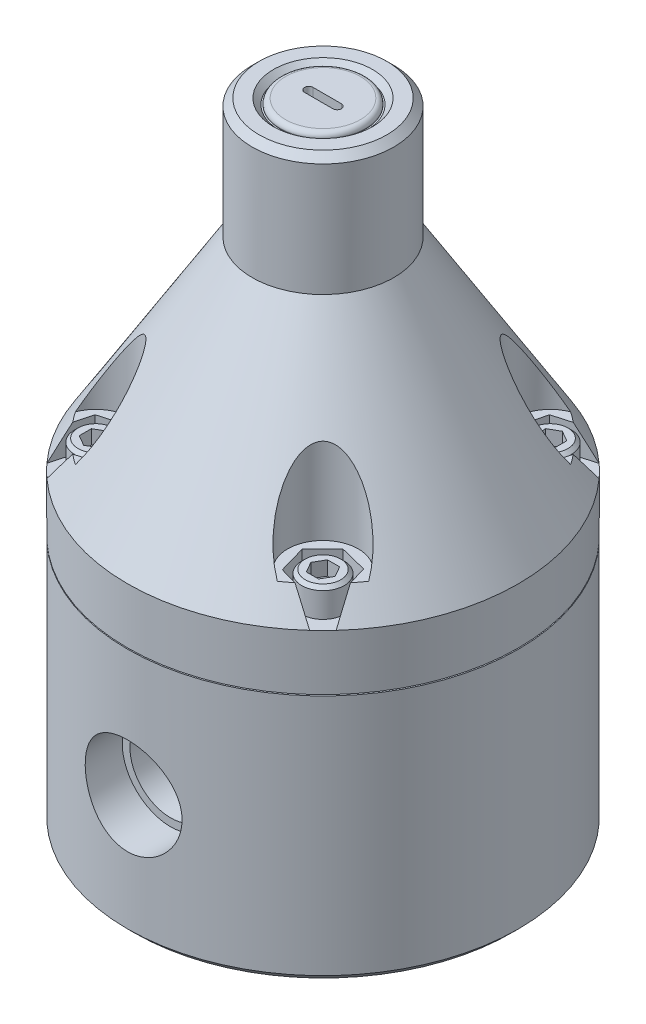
ISO-10303-21;
HEADER;
FILE_DESCRIPTION(('STEP AP214'),'2;1');
FILE_NAME('part.step','',(''),(''),'','','');
FILE_SCHEMA(('AUTOMOTIVE_DESIGN { 1 0 10303 214 1 1 1 1 }'));
ENDSEC;
DATA;
#1=APPLICATION_CONTEXT('core data for automotive mechanical design processes');
#2=APPLICATION_PROTOCOL_DEFINITION('international standard','automotive_design',2000,#1);
#3=PRODUCT_CONTEXT('',#1,'mechanical');
#4=PRODUCT('Part','Part','',(#3));
#5=PRODUCT_RELATED_PRODUCT_CATEGORY('part','',(#4));
#6=PRODUCT_DEFINITION_FORMATION('','',#4);
#7=PRODUCT_DEFINITION_CONTEXT('part definition',#1,'design');
#8=PRODUCT_DEFINITION('design','',#6,#7);
#9=PRODUCT_DEFINITION_SHAPE('','',#8);
#10=(LENGTH_UNIT() NAMED_UNIT(*) SI_UNIT(.MILLI.,.METRE.));
#11=(NAMED_UNIT(*) PLANE_ANGLE_UNIT() SI_UNIT($,.RADIAN.));
#12=(NAMED_UNIT(*) SI_UNIT($,.STERADIAN.) SOLID_ANGLE_UNIT());
#13=UNCERTAINTY_MEASURE_WITH_UNIT(LENGTH_MEASURE(1.E-05),#10,'distance_accuracy_value','');
#14=(GEOMETRIC_REPRESENTATION_CONTEXT(3) GLOBAL_UNCERTAINTY_ASSIGNED_CONTEXT((#13)) GLOBAL_UNIT_ASSIGNED_CONTEXT((#10,
#11,#12)) REPRESENTATION_CONTEXT('',''));
#15=CARTESIAN_POINT('',(0.,0.,0.));
#16=DIRECTION('',(0.,0.,1.));
#17=DIRECTION('',(1.,0.,0.));
#18=AXIS2_PLACEMENT_3D('',#15,#16,#17);
#19=CARTESIAN_POINT('',(0.,68.58,0.));
#20=DIRECTION('',(0.,-1.,0.));
#21=DIRECTION('',(0.,0.,-1.));
#22=AXIS2_PLACEMENT_3D('',#19,#20,#21);
#23=CONICAL_SURFACE('',#22,43.815,0.551031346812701);
#24=CARTESIAN_POINT('',(31.1854504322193,74.9302,-24.909570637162));
#25=CARTESIAN_POINT('',(31.2917993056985,74.4052604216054,-25.2932994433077));
#26=CARTESIAN_POINT('',(31.3977224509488,73.8791142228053,-25.6754921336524));
#27=CARTESIAN_POINT('',(31.6087824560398,72.8246364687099,-26.4370404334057));
#28=CARTESIAN_POINT('',(31.713919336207,72.2963049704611,-26.8163961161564));
#29=CARTESIAN_POINT('',(31.9234771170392,71.2376591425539,-27.5725240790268));
#30=CARTESIAN_POINT('',(32.0278980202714,70.7073448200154,-27.9492963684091));
#31=CARTESIAN_POINT('',(32.2360838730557,69.6448927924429,-28.7004741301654));
#32=CARTESIAN_POINT('',(32.3398488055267,69.1127550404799,-29.0748795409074));
#33=CARTESIAN_POINT('',(32.443312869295,68.5798,-29.4481993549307));
#34=B_SPLINE_CURVE_WITH_KNOTS('',3,(#24,#25,#26,#27,#28,#29,#30,#31,#32,#33),.UNSPECIFIED.,.F.,
.F.,(4,2,2,2,4),(0.,1.97662629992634,3.95320132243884,5.9297692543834,7.90638844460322),.UNSPECIFIED.);
#35=CARTESIAN_POINT('',(31.1854909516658,74.93,-24.9097168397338));
#36=VERTEX_POINT('',#35);
#37=CARTESIAN_POINT('',(32.4432740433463,68.58,-29.4480592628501));
#38=VERTEX_POINT('',#37);
#39=EDGE_CURVE('E746',#36,#38,#34,.T.);
#40=ORIENTED_EDGE('',*,*,#39,.F.);
#41=CARTESIAN_POINT('',(0.,74.93,0.));
#42=DIRECTION('',(0.,1.,0.));
#43=DIRECTION('',(0.,0.,1.));
#44=AXIS2_PLACEMENT_3D('',#41,#42,#43);
#45=CIRCLE('',#44,39.9127653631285);
#46=CARTESIAN_POINT('',(32.8759602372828,74.93,-22.6318376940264));
#47=VERTEX_POINT('',#46);
#48=EDGE_CURVE('E1547',#36,#47,#45,.F.);
#49=ORIENTED_EDGE('',*,*,#48,.T.);
#50=CARTESIAN_POINT('',(32.8760134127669,74.9298,-22.6319772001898));
#51=CARTESIAN_POINT('',(32.8078201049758,75.1861952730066,-22.4531520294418));
#52=CARTESIAN_POINT('',(32.7341907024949,75.4445704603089,-22.2793275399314));
#53=CARTESIAN_POINT('',(32.5770087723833,75.9645959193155,-21.9414911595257));
#54=CARTESIAN_POINT('',(32.4934589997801,76.2262452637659,-21.7774765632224));
#55=CARTESIAN_POINT('',(32.3174500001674,76.7519681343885,-21.4591594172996));
#56=CARTESIAN_POINT('',(32.2250013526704,77.0160384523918,-21.3048456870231));
#57=CARTESIAN_POINT('',(32.0318436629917,77.5464258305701,-21.0055220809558));
#58=CARTESIAN_POINT('',(31.9311339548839,77.8127430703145,-20.8605129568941));
#59=CARTESIAN_POINT('',(31.6173532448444,78.6150033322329,-20.4388792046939));
#60=CARTESIAN_POINT('',(31.3928032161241,79.1537454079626,-20.1759549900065));
#61=CARTESIAN_POINT('',(30.9170512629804,80.2357477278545,-19.6857657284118));
#62=CARTESIAN_POINT('',(30.6658395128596,80.7790095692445,-19.458513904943));
#63=CARTESIAN_POINT('',(30.118158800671,81.9115352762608,-19.022517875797));
#64=CARTESIAN_POINT('',(29.8196739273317,82.5009764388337,-18.8167433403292));
#65=CARTESIAN_POINT('',(29.3524342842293,83.3846139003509,-18.5396319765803));
#66=CARTESIAN_POINT('',(29.1934054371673,83.6791250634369,-18.452507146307));
#67=CARTESIAN_POINT('',(28.8689346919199,84.2675878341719,-18.2889878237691));
#68=CARTESIAN_POINT('',(28.7034932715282,84.5615394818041,-18.2125925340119));
#69=CARTESIAN_POINT('',(28.3660149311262,85.1488284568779,-18.0707333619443));
#70=CARTESIAN_POINT('',(28.1939696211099,85.442164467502,-18.0052839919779));
#71=CARTESIAN_POINT('',(27.8434345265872,86.0273145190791,-17.885863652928));
#72=CARTESIAN_POINT('',(27.6649449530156,86.3191286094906,-17.8318923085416));
#73=CARTESIAN_POINT('',(27.3014619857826,86.9004622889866,-17.7360312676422));
#74=CARTESIAN_POINT('',(27.1164723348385,87.1899830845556,-17.6941347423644));
#75=CARTESIAN_POINT('',(26.7396312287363,87.7661102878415,-17.6231649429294));
#76=CARTESIAN_POINT('',(26.5477800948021,88.0527168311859,-17.5940910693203));
#77=CARTESIAN_POINT('',(26.1388486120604,88.6481794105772,-17.5477736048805));
#78=CARTESIAN_POINT('',(25.9210687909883,88.9566632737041,-17.531860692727));
#79=CARTESIAN_POINT('',(25.4761618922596,89.5671217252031,-17.5184250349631));
#80=CARTESIAN_POINT('',(25.2490377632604,89.8690983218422,-17.5208965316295));
#81=CARTESIAN_POINT('',(24.7853264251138,90.462861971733,-17.546770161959));
#82=CARTESIAN_POINT('',(24.5487844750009,90.7546875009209,-17.5700815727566));
#83=CARTESIAN_POINT('',(24.1854004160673,91.182662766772,-17.6234209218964));
#84=CARTESIAN_POINT('',(24.0628808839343,91.3236542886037,-17.6442539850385));
#85=CARTESIAN_POINT('',(23.8147710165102,91.6017141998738,-17.6926688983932));
#86=CARTESIAN_POINT('',(23.6891808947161,91.7387828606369,-17.7202502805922));
#87=CARTESIAN_POINT('',(23.3476505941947,92.1003741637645,-17.8043004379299));
#88=CARTESIAN_POINT('',(23.1286985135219,92.320550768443,-17.8676208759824));
#89=CARTESIAN_POINT('',(22.6802930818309,92.7420139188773,-18.0200246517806));
#90=CARTESIAN_POINT('',(22.450819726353,92.9432620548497,-18.1091589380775));
#91=CARTESIAN_POINT('',(22.0978320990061,93.2244666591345,-18.2671443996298));
#92=CARTESIAN_POINT('',(21.9777912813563,93.315346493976,-18.3243659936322));
#93=CARTESIAN_POINT('',(21.7355133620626,93.4877899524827,-18.4477596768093));
#94=CARTESIAN_POINT('',(21.6132758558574,93.5693518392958,-18.5139334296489));
#95=CARTESIAN_POINT('',(21.3676920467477,93.7206957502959,-18.6557254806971));
#96=CARTESIAN_POINT('',(21.2443516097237,93.7905207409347,-18.7313074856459));
#97=CARTESIAN_POINT('',(20.997270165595,93.9162293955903,-18.8925662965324));
#98=CARTESIAN_POINT('',(20.8735295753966,93.9721245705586,-18.9782346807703));
#99=CARTESIAN_POINT('',(20.596353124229,94.0793061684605,-19.1825009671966));
#100=CARTESIAN_POINT('',(20.4431915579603,94.1259831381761,-19.303987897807));
#101=CARTESIAN_POINT('',(20.1429486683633,94.1891665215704,-19.561379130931));
#102=CARTESIAN_POINT('',(19.995862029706,94.2056998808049,-19.6972704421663));
#103=CARTESIAN_POINT('',(19.7121854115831,94.2068511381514,-19.9801670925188));
#104=CARTESIAN_POINT('',(19.5756118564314,94.1914201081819,-20.1271891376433));
#105=CARTESIAN_POINT('',(19.3168358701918,94.130256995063,-20.4274436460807));
#106=CARTESIAN_POINT('',(19.1946462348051,94.0844981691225,-20.5806814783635));
#107=CARTESIAN_POINT('',(18.9333227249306,93.9499537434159,-20.9335168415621));
#108=CARTESIAN_POINT('',(18.7994959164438,93.8525556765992,-21.1337148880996));
#109=CARTESIAN_POINT('',(18.5575341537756,93.6253225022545,-21.5311982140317));
#110=CARTESIAN_POINT('',(18.4494578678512,93.4954146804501,-21.7284758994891));
#111=CARTESIAN_POINT('',(18.2734255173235,93.2378861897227,-22.0822323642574));
#112=CARTESIAN_POINT('',(18.2017503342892,93.114033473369,-22.2396830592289));
#113=CARTESIAN_POINT('',(18.0717731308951,92.8543658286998,-22.5502860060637));
#114=CARTESIAN_POINT('',(18.0134803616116,92.7185427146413,-22.7034352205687));
#115=CARTESIAN_POINT('',(17.9085459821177,92.4375711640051,-23.0055063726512));
#116=CARTESIAN_POINT('',(17.8619238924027,92.2924076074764,-23.1544208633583));
#117=CARTESIAN_POINT('',(17.7789950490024,91.9949331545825,-23.4479825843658));
#118=CARTESIAN_POINT('',(17.7426923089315,91.842619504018,-23.5926281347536));
#119=CARTESIAN_POINT('',(17.6793668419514,91.5330276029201,-23.877261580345));
#120=CARTESIAN_POINT('',(17.6523073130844,91.3757718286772,-24.0172658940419));
#121=CARTESIAN_POINT('',(17.6063247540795,91.0568516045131,-24.2934532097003));
#122=CARTESIAN_POINT('',(17.5874006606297,90.8951877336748,-24.4296367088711));
#123=CARTESIAN_POINT('',(17.5416007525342,90.4045581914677,-24.8331155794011));
#124=CARTESIAN_POINT('',(17.5257415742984,90.0701857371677,-25.0951300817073));
#125=CARTESIAN_POINT('',(17.5187750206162,89.3910127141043,-25.6073018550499));
#126=CARTESIAN_POINT('',(17.5277362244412,89.0461858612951,-25.8574243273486));
#127=CARTESIAN_POINT('',(17.5674604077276,88.3499543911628,-26.346266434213));
#128=CARTESIAN_POINT('',(17.5982177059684,87.9985515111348,-26.5849890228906));
#129=CARTESIAN_POINT('',(17.6752315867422,87.3273950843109,-27.0279886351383));
#130=CARTESIAN_POINT('',(17.7195760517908,87.0080899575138,-27.2332880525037));
#131=CARTESIAN_POINT('',(17.8230232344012,86.366765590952,-27.6358491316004));
#132=CARTESIAN_POINT('',(17.8821279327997,86.0447459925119,-27.8331097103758));
#133=CARTESIAN_POINT('',(18.0143479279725,85.3986613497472,-28.2199078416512));
#134=CARTESIAN_POINT('',(18.0874725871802,85.0745950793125,-28.4094401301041));
#135=CARTESIAN_POINT('',(18.247146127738,84.4253288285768,-28.7807004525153));
#136=CARTESIAN_POINT('',(18.3336943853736,84.100128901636,-28.9624288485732));
#137=CARTESIAN_POINT('',(18.5196821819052,83.4497138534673,-29.3177238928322));
#138=CARTESIAN_POINT('',(18.6190998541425,83.1244996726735,-29.4913037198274));
#139=CARTESIAN_POINT('',(18.8307065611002,82.4740292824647,-29.830436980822));
#140=CARTESIAN_POINT('',(18.9428959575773,82.1487730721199,-29.9959901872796));
#141=CARTESIAN_POINT('',(19.1798765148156,81.4988617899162,-30.3186806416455));
#142=CARTESIAN_POINT('',(19.3046623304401,81.1742065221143,-30.4758214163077));
#143=CARTESIAN_POINT('',(19.566846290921,80.5258852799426,-30.7813029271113));
#144=CARTESIAN_POINT('',(19.7042435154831,80.2022192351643,-30.929644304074));
#145=CARTESIAN_POINT('',(20.0356080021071,79.4577845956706,-31.2608218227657));
#146=CARTESIAN_POINT('',(20.2340425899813,79.0375277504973,-31.4403688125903));
#147=CARTESIAN_POINT('',(20.6528330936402,78.2009180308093,-31.7817933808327));
#148=CARTESIAN_POINT('',(20.8731810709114,77.7845638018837,-31.943677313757));
#149=CARTESIAN_POINT('',(21.2204706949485,77.1642648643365,-32.1715277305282));
#150=CARTESIAN_POINT('',(21.3389735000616,76.9582923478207,-32.244953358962));
#151=CARTESIAN_POINT('',(21.5816967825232,76.5479021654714,-32.3865049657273));
#152=CARTESIAN_POINT('',(21.7059169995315,76.3434844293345,-32.454631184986));
#153=CARTESIAN_POINT('',(21.9602864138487,75.936277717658,-32.5852592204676));
#154=CARTESIAN_POINT('',(22.0904406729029,75.7334903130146,-32.647756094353));
#155=CARTESIAN_POINT('',(22.3567119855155,75.3299985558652,-32.7666088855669));
#156=CARTESIAN_POINT('',(22.4928299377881,75.1292945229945,-32.8229638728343));
#157=CARTESIAN_POINT('',(22.6319772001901,74.9298,-32.8760134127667));
#158=B_SPLINE_CURVE_WITH_KNOTS('',3,(#50,#51,#52,#53,#54,#55,#56,#57,#58,#59,#60,#61,#62,#63,
#64,#65,#66,#67,#68,#69,#70,#71,#72,#73,#74,#75,#76,#77,#78,#79,#80,#81,#82,#83,#84,#85,#86,#87,
#88,#89,#90,#91,#92,#93,#94,#95,#96,#97,#98,#99,#100,#101,#102,#103,#104,#105,#106,#107,#108,
#109,#110,#111,#112,#113,#114,#115,#116,#117,#118,#119,#120,#121,#122,#123,#124,#125,#126,#127,
#128,#129,#130,#131,#132,#133,#134,#135,#136,#137,#138,#139,#140,#141,#142,#143,#144,#145,#146,
#147,#148,#149,#150,#151,#152,#153,#154,#155,#156,#157),.UNSPECIFIED.,.F.,.F.,(4,2,2,2,2,2,2,2,
2,2,2,2,2,2,2,2,2,2,2,2,2,2,2,2,2,2,2,2,2,2,2,2,2,2,2,2,2,2,2,2,2,2,2,2,2,2,2,2,2,2,2,2,2,4),
(0.,0.959681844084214,1.9190977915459,2.87738689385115,3.83575332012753,5.75433905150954,
7.67363431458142,9.74768208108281,10.7850777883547,11.8223963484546,12.8610794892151,
13.8997286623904,14.9377892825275,15.9758013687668,17.1090815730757,18.2420068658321,
19.3700240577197,19.9337037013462,20.4973442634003,21.4467185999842,22.3979796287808,
22.8807596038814,23.363629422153,23.8446911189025,24.3253539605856,24.9256472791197,
25.5254037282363,26.1260789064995,26.7272844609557,27.5022221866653,28.2789089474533,
28.9163059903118,29.5541423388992,30.193038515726,30.8321828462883,31.4687519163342,
32.1052377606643,33.3791509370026,34.6565874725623,35.9336911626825,37.0798743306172,
38.2262114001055,39.3733166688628,40.520368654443,41.665496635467,42.8106570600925,
43.9553335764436,45.0999266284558,46.5938371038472,48.0872083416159,48.8332472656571,
49.5792522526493,50.325905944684,51.0726725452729),.UNSPECIFIED.);
#159=CARTESIAN_POINT('',(22.6318376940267,74.93,-32.8759602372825));
#160=VERTEX_POINT('',#159);
#161=EDGE_CURVE('E897',#47,#160,#158,.T.);
#162=ORIENTED_EDGE('',*,*,#161,.T.);
#163=CARTESIAN_POINT('',(24.9752922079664,74.93,-31.1329988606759));
#164=VERTEX_POINT('',#163);
#165=EDGE_CURVE('E906',#160,#164,#45,.F.);
#166=ORIENTED_EDGE('',*,*,#165,.T.);
#167=CARTESIAN_POINT('',(29.4766640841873,68.5798,-32.4174531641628));
#168=CARTESIAN_POINT('',(29.1062316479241,69.1125841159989,-32.3117512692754));
#169=CARTESIAN_POINT('',(28.7347583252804,69.6445870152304,-32.2057523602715));
#170=CARTESIAN_POINT('',(27.9895431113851,70.7068520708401,-31.9931072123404));
#171=CARTESIAN_POINT('',(27.6158012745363,71.2371142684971,-31.8864609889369));
#172=CARTESIAN_POINT('',(26.8658433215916,72.2957468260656,-31.6724625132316));
#173=CARTESIAN_POINT('',(26.4896271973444,72.8241171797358,-31.5651102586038));
#174=CARTESIAN_POINT('',(25.7344797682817,73.8787747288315,-31.3496309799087));
#175=CARTESIAN_POINT('',(25.3555483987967,74.4050618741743,-31.2415039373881));
#176=CARTESIAN_POINT('',(24.9751473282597,74.9302,-31.132957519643));
#177=B_SPLINE_CURVE_WITH_KNOTS('',3,(#167,#168,#169,#170,#171,#172,#173,#174,#175,#176),
.UNSPECIFIED.,.F.,.F.,(4,2,2,2,4),(0.,1.97237650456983,3.9447058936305,5.91704178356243,
7.88942480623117),.UNSPECIFIED.);
#178=CARTESIAN_POINT('',(29.4765250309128,68.58,-32.4174134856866));
#179=VERTEX_POINT('',#178);
#180=EDGE_CURVE('E729',#179,#164,#177,.T.);
#181=ORIENTED_EDGE('',*,*,#180,.F.);
#182=CARTESIAN_POINT('',(0.,68.58,0.));
#183=DIRECTION('',(0.,-1.,0.));
#184=DIRECTION('',(0.,0.,-1.));
#185=AXIS2_PLACEMENT_3D('',#182,#183,#184);
#186=CIRCLE('',#185,43.815);
#187=CARTESIAN_POINT('',(-29.4480592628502,68.58,-32.4432740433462));
#188=VERTEX_POINT('',#187);
#189=EDGE_CURVE('E1311',#188,#179,#186,.T.);
#190=ORIENTED_EDGE('',*,*,#189,.F.);
#191=CARTESIAN_POINT('',(-24.9095706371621,74.9302,-31.1854504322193));
#192=CARTESIAN_POINT('',(-25.2932994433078,74.4052604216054,-31.2917993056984));
#193=CARTESIAN_POINT('',(-25.6754921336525,73.8791142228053,-31.3977224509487));
#194=CARTESIAN_POINT('',(-26.4370404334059,72.8246364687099,-31.6087824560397));
#195=CARTESIAN_POINT('',(-26.8163961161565,72.2963049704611,-31.7139193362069));
#196=CARTESIAN_POINT('',(-27.5725240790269,71.2376591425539,-31.9234771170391));
#197=CARTESIAN_POINT('',(-27.9492963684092,70.7073448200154,-32.0278980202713));
#198=CARTESIAN_POINT('',(-28.7004741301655,69.6448927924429,-32.2360838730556));
#199=CARTESIAN_POINT('',(-29.0748795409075,69.1127550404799,-32.3398488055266));
#200=CARTESIAN_POINT('',(-29.4481993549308,68.5798,-32.4433128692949));
#201=B_SPLINE_CURVE_WITH_KNOTS('',3,(#191,#192,#193,#194,#195,#196,#197,#198,#199,#200),
.UNSPECIFIED.,.F.,.F.,(4,2,2,2,4),(0.,1.97662629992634,3.95320132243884,5.9297692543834,
7.90638844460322),.UNSPECIFIED.);
#202=CARTESIAN_POINT('',(-24.9097168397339,74.93,-31.1854909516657));
#203=VERTEX_POINT('',#202);
#204=EDGE_CURVE('E803',#203,#188,#201,.T.);
#205=ORIENTED_EDGE('',*,*,#204,.F.);
#206=CARTESIAN_POINT('',(0.,74.93,0.));
#207=DIRECTION('',(0.,1.,0.));
#208=DIRECTION('',(0.,0.,1.));
#209=AXIS2_PLACEMENT_3D('',#206,#207,#208);
#210=CIRCLE('',#209,39.9127653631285);
#211=CARTESIAN_POINT('',(-22.6318376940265,74.93,-32.8759602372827));
#212=VERTEX_POINT('',#211);
#213=EDGE_CURVE('E1551',#203,#212,#210,.F.);
#214=ORIENTED_EDGE('',*,*,#213,.T.);
#215=CARTESIAN_POINT('',(-22.6319772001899,74.9298,-32.8760134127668));
#216=CARTESIAN_POINT('',(-22.4531520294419,75.1861952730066,-32.8078201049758));
#217=CARTESIAN_POINT('',(-22.2793275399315,75.4445704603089,-32.7341907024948));
#218=CARTESIAN_POINT('',(-21.9414911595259,75.9645959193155,-32.5770087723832));
#219=CARTESIAN_POINT('',(-21.7774765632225,76.2262452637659,-32.49345899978));
#220=CARTESIAN_POINT('',(-21.4591594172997,76.7519681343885,-32.3174500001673));
#221=CARTESIAN_POINT('',(-21.3048456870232,77.0160384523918,-32.2250013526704));
#222=CARTESIAN_POINT('',(-21.0055220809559,77.5464258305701,-32.0318436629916));
#223=CARTESIAN_POINT('',(-20.8605129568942,77.8127430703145,-31.9311339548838));
#224=CARTESIAN_POINT('',(-20.438879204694,78.6150033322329,-31.6173532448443));
#225=CARTESIAN_POINT('',(-20.1759549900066,79.1537454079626,-31.392803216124));
#226=CARTESIAN_POINT('',(-19.6857657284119,80.2357477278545,-30.9170512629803));
#227=CARTESIAN_POINT('',(-19.4585139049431,80.7790095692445,-30.6658395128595));
#228=CARTESIAN_POINT('',(-19.0225178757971,81.9115352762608,-30.1181588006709));
#229=CARTESIAN_POINT('',(-18.8167433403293,82.5009764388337,-29.8196739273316));
#230=CARTESIAN_POINT('',(-18.5396319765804,83.3846139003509,-29.3524342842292));
#231=CARTESIAN_POINT('',(-18.4525071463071,83.6791250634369,-29.1934054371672));
#232=CARTESIAN_POINT('',(-18.2889878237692,84.2675878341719,-28.8689346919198));
#233=CARTESIAN_POINT('',(-18.212592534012,84.5615394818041,-28.7034932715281));
#234=CARTESIAN_POINT('',(-18.0707333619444,85.148828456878,-28.3660149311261));
#235=CARTESIAN_POINT('',(-18.005283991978,85.4421644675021,-28.1939696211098));
#236=CARTESIAN_POINT('',(-17.8858636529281,86.0273145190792,-27.8434345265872));
#237=CARTESIAN_POINT('',(-17.8318923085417,86.3191286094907,-27.6649449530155));
#238=CARTESIAN_POINT('',(-17.7360312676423,86.9004622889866,-27.3014619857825));
#239=CARTESIAN_POINT('',(-17.6941347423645,87.1899830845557,-27.1164723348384));
#240=CARTESIAN_POINT('',(-17.6231649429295,87.7661102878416,-26.7396312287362));
#241=CARTESIAN_POINT('',(-17.5940910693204,88.052716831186,-26.547780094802));
#242=CARTESIAN_POINT('',(-17.5477736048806,88.6481794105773,-26.1388486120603));
#243=CARTESIAN_POINT('',(-17.5318606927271,88.9566632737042,-25.9210687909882));
#244=CARTESIAN_POINT('',(-17.5184250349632,89.5671217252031,-25.4761618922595));
#245=CARTESIAN_POINT('',(-17.5208965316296,89.8690983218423,-25.2490377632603));
#246=CARTESIAN_POINT('',(-17.5467701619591,90.462861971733,-24.7853264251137));
#247=CARTESIAN_POINT('',(-17.5700815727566,90.754687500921,-24.5487844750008));
#248=CARTESIAN_POINT('',(-17.6234209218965,91.1826627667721,-24.1854004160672));
#249=CARTESIAN_POINT('',(-17.6442539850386,91.3236542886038,-24.0628808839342));
#250=CARTESIAN_POINT('',(-17.6926688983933,91.6017141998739,-23.8147710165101));
#251=CARTESIAN_POINT('',(-17.7202502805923,91.7387828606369,-23.6891808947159));
#252=CARTESIAN_POINT('',(-17.80430043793,92.1003741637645,-23.3476505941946));
#253=CARTESIAN_POINT('',(-17.8676208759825,92.320550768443,-23.1286985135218));
#254=CARTESIAN_POINT('',(-18.0200246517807,92.7420139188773,-22.6802930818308));
#255=CARTESIAN_POINT('',(-18.1091589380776,92.9432620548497,-22.4508197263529));
#256=CARTESIAN_POINT('',(-18.2671443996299,93.2244666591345,-22.097832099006));
#257=CARTESIAN_POINT('',(-18.3243659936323,93.3153464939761,-21.9777912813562));
#258=CARTESIAN_POINT('',(-18.4477596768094,93.4877899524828,-21.7355133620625));
#259=CARTESIAN_POINT('',(-18.513933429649,93.5693518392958,-21.6132758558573));
#260=CARTESIAN_POINT('',(-18.6557254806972,93.7206957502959,-21.3676920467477));
#261=CARTESIAN_POINT('',(-18.731307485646,93.7905207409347,-21.2443516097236));
#262=CARTESIAN_POINT('',(-18.8925662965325,93.9162293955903,-20.9972701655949));
#263=CARTESIAN_POINT('',(-18.9782346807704,93.9721245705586,-20.8735295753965));
#264=CARTESIAN_POINT('',(-19.1825009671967,94.0793061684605,-20.5963531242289));
#265=CARTESIAN_POINT('',(-19.3039878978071,94.1259831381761,-20.4431915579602));
#266=CARTESIAN_POINT('',(-19.5613791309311,94.1891665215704,-20.1429486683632));
#267=CARTESIAN_POINT('',(-19.6972704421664,94.2056998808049,-19.9958620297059));
#268=CARTESIAN_POINT('',(-19.9801670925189,94.2068511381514,-19.7121854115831));
#269=CARTESIAN_POINT('',(-20.1271891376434,94.1914201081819,-19.5756118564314));
#270=CARTESIAN_POINT('',(-20.4274436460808,94.130256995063,-19.3168358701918));
#271=CARTESIAN_POINT('',(-20.5806814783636,94.0844981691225,-19.194646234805));
#272=CARTESIAN_POINT('',(-20.9335168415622,93.9499537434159,-18.9333227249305));
#273=CARTESIAN_POINT('',(-21.1337148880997,93.8525556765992,-18.7994959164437));
#274=CARTESIAN_POINT('',(-21.5311982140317,93.6253225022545,-18.5575341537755));
#275=CARTESIAN_POINT('',(-21.7284758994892,93.4954146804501,-18.4494578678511));
#276=CARTESIAN_POINT('',(-22.0822323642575,93.2378861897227,-18.2734255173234));
#277=CARTESIAN_POINT('',(-22.239683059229,93.114033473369,-18.2017503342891));
#278=CARTESIAN_POINT('',(-22.5502860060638,92.8543658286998,-18.071773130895));
#279=CARTESIAN_POINT('',(-22.7034352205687,92.7185427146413,-18.0134803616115));
#280=CARTESIAN_POINT('',(-23.0055063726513,92.437571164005,-17.9085459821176));
#281=CARTESIAN_POINT('',(-23.1544208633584,92.2924076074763,-17.8619238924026));
#282=CARTESIAN_POINT('',(-23.4479825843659,91.9949331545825,-17.7789950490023));
#283=CARTESIAN_POINT('',(-23.5926281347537,91.842619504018,-17.7426923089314));
#284=CARTESIAN_POINT('',(-23.8772615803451,91.5330276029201,-17.6793668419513));
#285=CARTESIAN_POINT('',(-24.017265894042,91.3757718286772,-17.6523073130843));
#286=CARTESIAN_POINT('',(-24.2934532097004,91.0568516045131,-17.6063247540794));
#287=CARTESIAN_POINT('',(-24.4296367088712,90.8951877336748,-17.5874006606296));
#288=CARTESIAN_POINT('',(-24.8331155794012,90.4045581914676,-17.5416007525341));
#289=CARTESIAN_POINT('',(-25.0951300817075,90.0701857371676,-17.5257415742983));
#290=CARTESIAN_POINT('',(-25.60730185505,89.3910127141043,-17.5187750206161));
#291=CARTESIAN_POINT('',(-25.8574243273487,89.046185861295,-17.5277362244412));
#292=CARTESIAN_POINT('',(-26.3462664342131,88.3499543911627,-17.5674604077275));
#293=CARTESIAN_POINT('',(-26.5849890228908,87.9985515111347,-17.5982177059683));
#294=CARTESIAN_POINT('',(-27.0279886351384,87.3273950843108,-17.6752315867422));
#295=CARTESIAN_POINT('',(-27.2332880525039,87.0080899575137,-17.7195760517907));
#296=CARTESIAN_POINT('',(-27.6358491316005,86.366765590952,-17.8230232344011));
#297=CARTESIAN_POINT('',(-27.8331097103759,86.0447459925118,-17.8821279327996));
#298=CARTESIAN_POINT('',(-28.2199078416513,85.3986613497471,-18.0143479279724));
#299=CARTESIAN_POINT('',(-28.4094401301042,85.0745950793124,-18.0874725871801));
#300=CARTESIAN_POINT('',(-28.7807004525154,84.4253288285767,-18.2471461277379));
#301=CARTESIAN_POINT('',(-28.9624288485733,84.1001289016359,-18.3336943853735));
#302=CARTESIAN_POINT('',(-29.3177238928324,83.4497138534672,-18.5196821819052));
#303=CARTESIAN_POINT('',(-29.4913037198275,83.1244996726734,-18.6190998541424));
#304=CARTESIAN_POINT('',(-29.8304369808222,82.4740292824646,-18.8307065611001));
#305=CARTESIAN_POINT('',(-29.9959901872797,82.1487730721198,-18.9428959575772));
#306=CARTESIAN_POINT('',(-30.3186806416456,81.498861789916,-19.1798765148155));
#307=CARTESIAN_POINT('',(-30.4758214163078,81.1742065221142,-19.3046623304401));
#308=CARTESIAN_POINT('',(-30.7813029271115,80.5258852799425,-19.5668462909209));
#309=CARTESIAN_POINT('',(-30.9296443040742,80.2022192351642,-19.7042435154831));
#310=CARTESIAN_POINT('',(-31.2608218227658,79.4577845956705,-20.0356080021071));
#311=CARTESIAN_POINT('',(-31.4403688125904,79.0375277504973,-20.2340425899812));
#312=CARTESIAN_POINT('',(-31.7817933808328,78.2009180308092,-20.6528330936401));
#313=CARTESIAN_POINT('',(-31.9436773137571,77.7845638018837,-20.8731810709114));
#314=CARTESIAN_POINT('',(-32.1715277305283,77.1642648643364,-21.2204706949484));
#315=CARTESIAN_POINT('',(-32.2449533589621,76.9582923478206,-21.3389735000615));
#316=CARTESIAN_POINT('',(-32.3865049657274,76.5479021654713,-21.5816967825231));
#317=CARTESIAN_POINT('',(-32.4546311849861,76.3434844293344,-21.7059169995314));
#318=CARTESIAN_POINT('',(-32.5852592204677,75.9362777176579,-21.9602864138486));
#319=CARTESIAN_POINT('',(-32.6477560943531,75.7334903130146,-22.0904406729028));
#320=CARTESIAN_POINT('',(-32.766608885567,75.3299985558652,-22.3567119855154));
#321=CARTESIAN_POINT('',(-32.8229638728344,75.1292945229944,-22.492829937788));
#322=CARTESIAN_POINT('',(-32.8760134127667,74.9298,-22.63197720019));
#323=B_SPLINE_CURVE_WITH_KNOTS('',3,(#215,#216,#217,#218,#219,#220,#221,#222,#223,#224,#225,
#226,#227,#228,#229,#230,#231,#232,#233,#234,#235,#236,#237,#238,#239,#240,#241,#242,#243,#244,
#245,#246,#247,#248,#249,#250,#251,#252,#253,#254,#255,#256,#257,#258,#259,#260,#261,#262,#263,
#264,#265,#266,#267,#268,#269,#270,#271,#272,#273,#274,#275,#276,#277,#278,#279,#280,#281,#282,
#283,#284,#285,#286,#287,#288,#289,#290,#291,#292,#293,#294,#295,#296,#297,#298,#299,#300,#301,
#302,#303,#304,#305,#306,#307,#308,#309,#310,#311,#312,#313,#314,#315,#316,#317,#318,#319,#320,
#321,#322),.UNSPECIFIED.,.F.,.F.,(4,2,2,2,2,2,2,2,2,2,2,2,2,2,2,2,2,2,2,2,2,2,2,2,2,2,2,2,2,2,2,
2,2,2,2,2,2,2,2,2,2,2,2,2,2,2,2,2,2,2,2,2,2,4),(0.,0.959681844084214,1.9190977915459,
2.87738689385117,3.83575332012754,5.75433905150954,7.67363431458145,9.74768208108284,
10.7850777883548,11.8223963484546,12.8610794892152,13.8997286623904,14.9377892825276,
15.9758013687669,17.1090815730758,18.2420068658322,19.3700240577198,19.9337037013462,
20.4973442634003,21.4467185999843,22.3979796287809,22.8807596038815,23.3636294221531,
23.8446911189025,24.3253539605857,24.9256472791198,25.5254037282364,26.1260789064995,
26.7272844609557,27.5022221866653,28.2789089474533,28.9163059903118,29.5541423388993,
30.193038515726,30.8321828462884,31.4687519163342,32.1052377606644,33.3791509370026,
34.6565874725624,35.9336911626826,37.0798743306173,38.2262114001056,39.373316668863,
40.5203686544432,41.6654966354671,42.8106570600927,43.9553335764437,45.0999266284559,
46.5938371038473,48.0872083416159,48.8332472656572,49.5792522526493,50.3259059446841,
51.0726725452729),.UNSPECIFIED.);
#324=CARTESIAN_POINT('',(-32.8759602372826,74.93,-22.6318376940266));
#325=VERTEX_POINT('',#324);
#326=EDGE_CURVE('E1549',#212,#325,#323,.T.);
#327=ORIENTED_EDGE('',*,*,#326,.T.);
#328=CARTESIAN_POINT('',(-31.132998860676,74.93,-24.9752922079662));
#329=VERTEX_POINT('',#328);
#330=EDGE_CURVE('E1364',#325,#329,#210,.F.);
#331=ORIENTED_EDGE('',*,*,#330,.T.);
#332=CARTESIAN_POINT('',(-32.4174531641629,68.5798,-29.4766640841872));
#333=CARTESIAN_POINT('',(-32.3117512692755,69.1125841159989,-29.106231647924));
#334=CARTESIAN_POINT('',(-32.2057523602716,69.6445870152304,-28.7347583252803));
#335=CARTESIAN_POINT('',(-31.9931072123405,70.7068520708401,-27.989543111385));
#336=CARTESIAN_POINT('',(-31.886460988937,71.2371142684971,-27.6158012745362));
#337=CARTESIAN_POINT('',(-31.6724625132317,72.2957468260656,-26.8658433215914));
#338=CARTESIAN_POINT('',(-31.5651102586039,72.8241171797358,-26.4896271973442));
#339=CARTESIAN_POINT('',(-31.3496309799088,73.8787747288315,-25.7344797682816));
#340=CARTESIAN_POINT('',(-31.2415039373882,74.4050618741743,-25.3555483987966));
#341=CARTESIAN_POINT('',(-31.1329575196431,74.9302,-24.9751473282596));
#342=B_SPLINE_CURVE_WITH_KNOTS('',3,(#332,#333,#334,#335,#336,#337,#338,#339,#340,#341),
.UNSPECIFIED.,.F.,.F.,(4,2,2,2,4),(0.,1.9723765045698,3.94470589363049,5.91704178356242,
7.88942480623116),.UNSPECIFIED.);
#343=CARTESIAN_POINT('',(-32.4174134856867,68.58,-29.4765250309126));
#344=VERTEX_POINT('',#343);
#345=EDGE_CURVE('E796',#344,#329,#342,.T.);
#346=ORIENTED_EDGE('',*,*,#345,.F.);
#347=CARTESIAN_POINT('',(-32.4432740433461,68.58,29.4480592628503));
#348=VERTEX_POINT('',#347);
#349=EDGE_CURVE('E1320',#348,#344,#186,.T.);
#350=ORIENTED_EDGE('',*,*,#349,.F.);
#351=CARTESIAN_POINT('',(-31.1854504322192,74.9302,24.9095706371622));
#352=CARTESIAN_POINT('',(-31.2917993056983,74.4052604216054,25.2932994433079));
#353=CARTESIAN_POINT('',(-31.3977224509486,73.8791142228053,25.6754921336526));
#354=CARTESIAN_POINT('',(-31.6087824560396,72.8246364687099,26.437040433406));
#355=CARTESIAN_POINT('',(-31.7139193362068,72.2963049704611,26.8163961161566));
#356=CARTESIAN_POINT('',(-31.9234771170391,71.2376591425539,27.572524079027));
#357=CARTESIAN_POINT('',(-32.0278980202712,70.7073448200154,27.9492963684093));
#358=CARTESIAN_POINT('',(-32.2360838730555,69.6448927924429,28.7004741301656));
#359=CARTESIAN_POINT('',(-32.3398488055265,69.1127550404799,29.0748795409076));
#360=CARTESIAN_POINT('',(-32.4433128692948,68.5798,29.4481993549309));
#361=B_SPLINE_CURVE_WITH_KNOTS('',3,(#351,#352,#353,#354,#355,#356,#357,#358,#359,#360),
.UNSPECIFIED.,.F.,.F.,(4,2,2,2,4),(0.,1.97662629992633,3.95320132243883,5.9297692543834,
7.90638844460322),.UNSPECIFIED.);
#362=CARTESIAN_POINT('',(-31.1854909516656,74.93,24.9097168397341));
#363=VERTEX_POINT('',#362);
#364=EDGE_CURVE('E866',#363,#348,#361,.T.);
#365=ORIENTED_EDGE('',*,*,#364,.F.);
#366=CARTESIAN_POINT('',(0.,74.93,0.));
#367=DIRECTION('',(0.,1.,0.));
#368=DIRECTION('',(0.,0.,1.));
#369=AXIS2_PLACEMENT_3D('',#366,#367,#368);
#370=CIRCLE('',#369,39.9127653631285);
#371=CARTESIAN_POINT('',(-32.8759602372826,74.93,22.6318376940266));
#372=VERTEX_POINT('',#371);
#373=EDGE_CURVE('E2361',#363,#372,#370,.F.);
#374=ORIENTED_EDGE('',*,*,#373,.T.);
#375=CARTESIAN_POINT('',(-32.8760134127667,74.9298,22.63197720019));
#376=CARTESIAN_POINT('',(-32.8078201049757,75.1861952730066,22.453152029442));
#377=CARTESIAN_POINT('',(-32.7341907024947,75.4445704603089,22.2793275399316));
#378=CARTESIAN_POINT('',(-32.5770087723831,75.9645959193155,21.941491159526));
#379=CARTESIAN_POINT('',(-32.4934589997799,76.2262452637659,21.7774765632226));
#380=CARTESIAN_POINT('',(-32.3174500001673,76.7519681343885,21.4591594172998));
#381=CARTESIAN_POINT('',(-32.2250013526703,77.0160384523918,21.3048456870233));
#382=CARTESIAN_POINT('',(-32.0318436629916,77.5464258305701,21.005522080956));
#383=CARTESIAN_POINT('',(-31.9311339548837,77.8127430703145,20.8605129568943));
#384=CARTESIAN_POINT('',(-31.6173532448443,78.6150033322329,20.4388792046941));
#385=CARTESIAN_POINT('',(-31.3928032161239,79.1537454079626,20.1759549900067));
#386=CARTESIAN_POINT('',(-30.9170512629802,80.2357477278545,19.685765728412));
#387=CARTESIAN_POINT('',(-30.6658395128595,80.7790095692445,19.4585139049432));
#388=CARTESIAN_POINT('',(-30.1181588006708,81.9115352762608,19.0225178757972));
#389=CARTESIAN_POINT('',(-29.8196739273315,82.5009764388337,18.8167433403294));
#390=CARTESIAN_POINT('',(-29.3524342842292,83.3846139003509,18.5396319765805));
#391=CARTESIAN_POINT('',(-29.1934054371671,83.6791250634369,18.4525071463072));
#392=CARTESIAN_POINT('',(-28.8689346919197,84.2675878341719,18.2889878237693));
#393=CARTESIAN_POINT('',(-28.703493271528,84.5615394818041,18.2125925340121));
#394=CARTESIAN_POINT('',(-28.3660149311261,85.1488284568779,18.0707333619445));
#395=CARTESIAN_POINT('',(-28.1939696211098,85.442164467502,18.0052839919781));
#396=CARTESIAN_POINT('',(-27.8434345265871,86.0273145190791,17.8858636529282));
#397=CARTESIAN_POINT('',(-27.6649449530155,86.3191286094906,17.8318923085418));
#398=CARTESIAN_POINT('',(-27.3014619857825,86.9004622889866,17.7360312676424));
#399=CARTESIAN_POINT('',(-27.1164723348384,87.1899830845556,17.6941347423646));
#400=CARTESIAN_POINT('',(-26.7396312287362,87.7661102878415,17.6231649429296));
#401=CARTESIAN_POINT('',(-26.5477800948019,88.0527168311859,17.5940910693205));
#402=CARTESIAN_POINT('',(-26.1388486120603,88.6481794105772,17.5477736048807));
#403=CARTESIAN_POINT('',(-25.9210687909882,88.9566632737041,17.5318606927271));
#404=CARTESIAN_POINT('',(-25.4761618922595,89.5671217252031,17.5184250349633));
#405=CARTESIAN_POINT('',(-25.2490377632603,89.8690983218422,17.5208965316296));
#406=CARTESIAN_POINT('',(-24.7853264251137,90.462861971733,17.5467701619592));
#407=CARTESIAN_POINT('',(-24.5487844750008,90.7546875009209,17.5700815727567));
#408=CARTESIAN_POINT('',(-24.1854004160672,91.1826627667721,17.6234209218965));
#409=CARTESIAN_POINT('',(-24.0628808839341,91.3236542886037,17.6442539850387));
#410=CARTESIAN_POINT('',(-23.8147710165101,91.6017141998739,17.6926688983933));
#411=CARTESIAN_POINT('',(-23.6891808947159,91.7387828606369,17.7202502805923));
#412=CARTESIAN_POINT('',(-23.3476505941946,92.1003741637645,17.80430043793));
#413=CARTESIAN_POINT('',(-23.1286985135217,92.320550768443,17.8676208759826));
#414=CARTESIAN_POINT('',(-22.6802930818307,92.7420139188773,18.0200246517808));
#415=CARTESIAN_POINT('',(-22.4508197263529,92.9432620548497,18.1091589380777));
#416=CARTESIAN_POINT('',(-22.0978320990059,93.2244666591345,18.2671443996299));
#417=CARTESIAN_POINT('',(-21.9777912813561,93.315346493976,18.3243659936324));
#418=CARTESIAN_POINT('',(-21.7355133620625,93.4877899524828,18.4477596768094));
#419=CARTESIAN_POINT('',(-21.6132758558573,93.5693518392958,18.5139334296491));
#420=CARTESIAN_POINT('',(-21.3676920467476,93.7206957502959,18.6557254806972));
#421=CARTESIAN_POINT('',(-21.2443516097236,93.7905207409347,18.7313074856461));
#422=CARTESIAN_POINT('',(-20.9972701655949,93.9162293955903,18.8925662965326));
#423=CARTESIAN_POINT('',(-20.8735295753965,93.9721245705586,18.9782346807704));
#424=CARTESIAN_POINT('',(-20.5963531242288,94.0793061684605,19.1825009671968));
#425=CARTESIAN_POINT('',(-20.4431915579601,94.1259831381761,19.3039878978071));
#426=CARTESIAN_POINT('',(-20.1429486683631,94.1891665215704,19.5613791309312));
#427=CARTESIAN_POINT('',(-19.9958620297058,94.2056998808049,19.6972704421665));
#428=CARTESIAN_POINT('',(-19.712185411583,94.2068511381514,19.980167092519));
#429=CARTESIAN_POINT('',(-19.5756118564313,94.1914201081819,20.1271891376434));
#430=CARTESIAN_POINT('',(-19.3168358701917,94.130256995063,20.4274436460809));
#431=CARTESIAN_POINT('',(-19.194646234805,94.0844981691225,20.5806814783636));
#432=CARTESIAN_POINT('',(-18.9333227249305,93.9499537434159,20.9335168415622));
#433=CARTESIAN_POINT('',(-18.7994959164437,93.8525556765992,21.1337148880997));
#434=CARTESIAN_POINT('',(-18.5575341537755,93.6253225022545,21.5311982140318));
#435=CARTESIAN_POINT('',(-18.449457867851,93.4954146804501,21.7284758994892));
#436=CARTESIAN_POINT('',(-18.2734255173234,93.2378861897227,22.0822323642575));
#437=CARTESIAN_POINT('',(-18.201750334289,93.114033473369,22.239683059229));
#438=CARTESIAN_POINT('',(-18.0717731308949,92.8543658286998,22.5502860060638));
#439=CARTESIAN_POINT('',(-18.0134803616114,92.7185427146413,22.7034352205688));
#440=CARTESIAN_POINT('',(-17.9085459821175,92.4375711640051,23.0055063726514));
#441=CARTESIAN_POINT('',(-17.8619238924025,92.2924076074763,23.1544208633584));
#442=CARTESIAN_POINT('',(-17.7789950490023,91.9949331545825,23.447982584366));
#443=CARTESIAN_POINT('',(-17.7426923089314,91.842619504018,23.5926281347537));
#444=CARTESIAN_POINT('',(-17.6793668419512,91.5330276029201,23.8772615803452));
#445=CARTESIAN_POINT('',(-17.6523073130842,91.3757718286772,24.017265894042));
#446=CARTESIAN_POINT('',(-17.6063247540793,91.0568516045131,24.2934532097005));
#447=CARTESIAN_POINT('',(-17.5874006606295,90.8951877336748,24.4296367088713));
#448=CARTESIAN_POINT('',(-17.541600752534,90.4045581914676,24.8331155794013));
#449=CARTESIAN_POINT('',(-17.5257415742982,90.0701857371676,25.0951300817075));
#450=CARTESIAN_POINT('',(-17.518775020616,89.3910127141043,25.6073018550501));
#451=CARTESIAN_POINT('',(-17.5277362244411,89.046185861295,25.8574243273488));
#452=CARTESIAN_POINT('',(-17.5674604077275,88.3499543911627,26.3462664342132));
#453=CARTESIAN_POINT('',(-17.5982177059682,87.9985515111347,26.5849890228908));
#454=CARTESIAN_POINT('',(-17.6752315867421,87.3273950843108,27.0279886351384));
#455=CARTESIAN_POINT('',(-17.7195760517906,87.0080899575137,27.2332880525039));
#456=CARTESIAN_POINT('',(-17.823023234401,86.366765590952,27.6358491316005));
#457=CARTESIAN_POINT('',(-17.8821279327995,86.0447459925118,27.833109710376));
#458=CARTESIAN_POINT('',(-18.0143479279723,85.3986613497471,28.2199078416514));
#459=CARTESIAN_POINT('',(-18.08747258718,85.0745950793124,28.4094401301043));
#460=CARTESIAN_POINT('',(-18.2471461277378,84.4253288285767,28.7807004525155));
#461=CARTESIAN_POINT('',(-18.3336943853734,84.1001289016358,28.9624288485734));
#462=CARTESIAN_POINT('',(-18.5196821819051,83.4497138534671,29.3177238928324));
#463=CARTESIAN_POINT('',(-18.6190998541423,83.1244996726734,29.4913037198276));
#464=CARTESIAN_POINT('',(-18.8307065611,82.4740292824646,29.8304369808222));
#465=CARTESIAN_POINT('',(-18.9428959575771,82.1487730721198,29.9959901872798));
#466=CARTESIAN_POINT('',(-19.1798765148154,81.498861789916,30.3186806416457));
#467=CARTESIAN_POINT('',(-19.30466233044,81.1742065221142,30.4758214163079));
#468=CARTESIAN_POINT('',(-19.5668462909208,80.5258852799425,30.7813029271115));
#469=CARTESIAN_POINT('',(-19.704243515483,80.2022192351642,30.9296443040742));
#470=CARTESIAN_POINT('',(-20.035608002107,79.4577845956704,31.2608218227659));
#471=CARTESIAN_POINT('',(-20.2340425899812,79.0375277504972,31.4403688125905));
#472=CARTESIAN_POINT('',(-20.65283309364,78.2009180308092,31.7817933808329));
#473=CARTESIAN_POINT('',(-20.8731810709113,77.7845638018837,31.9436773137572));
#474=CARTESIAN_POINT('',(-21.2204706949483,77.1642648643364,32.1715277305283));
#475=CARTESIAN_POINT('',(-21.3389735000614,76.9582923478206,32.2449533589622));
#476=CARTESIAN_POINT('',(-21.581696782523,76.5479021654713,32.3865049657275));
#477=CARTESIAN_POINT('',(-21.7059169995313,76.3434844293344,32.4546311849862));
#478=CARTESIAN_POINT('',(-21.9602864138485,75.9362777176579,32.5852592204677));
#479=CARTESIAN_POINT('',(-22.0904406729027,75.7334903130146,32.6477560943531));
#480=CARTESIAN_POINT('',(-22.3567119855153,75.3299985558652,32.7666088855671));
#481=CARTESIAN_POINT('',(-22.4928299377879,75.1292945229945,32.8229638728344));
#482=CARTESIAN_POINT('',(-22.6319772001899,74.9298,32.8760134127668));
#483=B_SPLINE_CURVE_WITH_KNOTS('',3,(#375,#376,#377,#378,#379,#380,#381,#382,#383,#384,#385,
#386,#387,#388,#389,#390,#391,#392,#393,#394,#395,#396,#397,#398,#399,#400,#401,#402,#403,#404,
#405,#406,#407,#408,#409,#410,#411,#412,#413,#414,#415,#416,#417,#418,#419,#420,#421,#422,#423,
#424,#425,#426,#427,#428,#429,#430,#431,#432,#433,#434,#435,#436,#437,#438,#439,#440,#441,#442,
#443,#444,#445,#446,#447,#448,#449,#450,#451,#452,#453,#454,#455,#456,#457,#458,#459,#460,#461,
#462,#463,#464,#465,#466,#467,#468,#469,#470,#471,#472,#473,#474,#475,#476,#477,#478,#479,#480,
#481,#482),.UNSPECIFIED.,.F.,.F.,(4,2,2,2,2,2,2,2,2,2,2,2,2,2,2,2,2,2,2,2,2,2,2,2,2,2,2,2,2,2,2,
2,2,2,2,2,2,2,2,2,2,2,2,2,2,2,2,2,2,2,2,2,2,4),(0.,0.959681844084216,1.9190977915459,
2.87738689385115,3.83575332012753,5.75433905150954,7.67363431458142,9.74768208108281,
10.7850777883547,11.8223963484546,12.8610794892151,13.8997286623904,14.9377892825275,
15.9758013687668,17.1090815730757,18.2420068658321,19.3700240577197,19.9337037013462,
20.4973442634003,21.4467185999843,22.3979796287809,22.8807596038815,23.3636294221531,
23.8446911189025,24.3253539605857,24.9256472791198,25.5254037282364,26.1260789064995,
26.7272844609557,27.5022221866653,28.2789089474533,28.9163059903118,29.5541423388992,
30.193038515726,30.8321828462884,31.4687519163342,32.1052377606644,33.3791509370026,
34.6565874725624,35.9336911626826,37.0798743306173,38.2262114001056,39.373316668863,
40.5203686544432,41.6654966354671,42.8106570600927,43.9553335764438,45.099926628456,
46.5938371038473,48.087208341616,48.8332472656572,49.5792522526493,50.325905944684,
51.0726725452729),.UNSPECIFIED.);
#484=CARTESIAN_POINT('',(-22.6318376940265,74.93,32.8759602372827));
#485=VERTEX_POINT('',#484);
#486=EDGE_CURVE('E1554',#372,#485,#483,.T.);
#487=ORIENTED_EDGE('',*,*,#486,.T.);
#488=CARTESIAN_POINT('',(-24.9752922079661,74.93,31.132998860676));
#489=VERTEX_POINT('',#488);
#490=EDGE_CURVE('E1341',#485,#489,#370,.F.);
#491=ORIENTED_EDGE('',*,*,#490,.T.);
#492=CARTESIAN_POINT('',(-29.476664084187,68.5798,32.417453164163));
#493=CARTESIAN_POINT('',(-29.1062316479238,69.1125841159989,32.3117512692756));
#494=CARTESIAN_POINT('',(-28.7347583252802,69.6445870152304,32.2057523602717));
#495=CARTESIAN_POINT('',(-27.9895431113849,70.7068520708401,31.9931072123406));
#496=CARTESIAN_POINT('',(-27.6158012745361,71.2371142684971,31.8864609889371));
#497=CARTESIAN_POINT('',(-26.8658433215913,72.2957468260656,31.6724625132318));
#498=CARTESIAN_POINT('',(-26.4896271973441,72.8241171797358,31.565110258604));
#499=CARTESIAN_POINT('',(-25.7344797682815,73.8787747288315,31.3496309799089));
#500=CARTESIAN_POINT('',(-25.3555483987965,74.4050618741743,31.2415039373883));
#501=CARTESIAN_POINT('',(-24.9751473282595,74.9302,31.1329575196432));
#502=B_SPLINE_CURVE_WITH_KNOTS('',3,(#492,#493,#494,#495,#496,#497,#498,#499,#500,#501),
.UNSPECIFIED.,.F.,.F.,(4,2,2,2,4),(0.,1.97237650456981,3.9447058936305,5.91704178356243,
7.88942480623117),.UNSPECIFIED.);
#503=CARTESIAN_POINT('',(-29.4765250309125,68.58,32.4174134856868));
#504=VERTEX_POINT('',#503);
#505=EDGE_CURVE('E850',#504,#489,#502,.T.);
#506=ORIENTED_EDGE('',*,*,#505,.F.);
#507=CARTESIAN_POINT('',(29.4480592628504,68.58,32.443274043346));
#508=VERTEX_POINT('',#507);
#509=EDGE_CURVE('E1171',#508,#504,#186,.T.);
#510=ORIENTED_EDGE('',*,*,#509,.F.);
#511=CARTESIAN_POINT('',(24.9095706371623,74.9302,31.1854504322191));
#512=CARTESIAN_POINT('',(25.2932994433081,74.4052604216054,31.2917993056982));
#513=CARTESIAN_POINT('',(25.6754921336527,73.8791142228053,31.3977224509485));
#514=CARTESIAN_POINT('',(26.4370404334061,72.8246364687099,31.6087824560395));
#515=CARTESIAN_POINT('',(26.8163961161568,72.2963049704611,31.7139193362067));
#516=CARTESIAN_POINT('',(27.5725240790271,71.2376591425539,31.923477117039));
#517=CARTESIAN_POINT('',(27.9492963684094,70.7073448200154,32.0278980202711));
#518=CARTESIAN_POINT('',(28.7004741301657,69.6448927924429,32.2360838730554));
#519=CARTESIAN_POINT('',(29.0748795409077,69.1127550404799,32.3398488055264));
#520=CARTESIAN_POINT('',(29.448199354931,68.5798,32.4433128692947));
#521=B_SPLINE_CURVE_WITH_KNOTS('',3,(#511,#512,#513,#514,#515,#516,#517,#518,#519,#520),
.UNSPECIFIED.,.F.,.F.,(4,2,2,2,4),(0.,1.97662629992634,3.95320132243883,5.9297692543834,
7.90638844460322),.UNSPECIFIED.);
#522=CARTESIAN_POINT('',(24.9097168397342,74.93,31.1854909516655));
#523=VERTEX_POINT('',#522);
#524=EDGE_CURVE('E1337',#523,#508,#521,.T.);
#525=ORIENTED_EDGE('',*,*,#524,.F.);
#526=CARTESIAN_POINT('',(0.,74.93,0.));
#527=DIRECTION('',(0.,1.,0.));
#528=DIRECTION('',(0.,0.,1.));
#529=AXIS2_PLACEMENT_3D('',#526,#527,#528);
#530=CIRCLE('',#529,39.9127653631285);
#531=CARTESIAN_POINT('',(22.6318376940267,74.93,32.8759602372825));
#532=VERTEX_POINT('',#531);
#533=EDGE_CURVE('E1210',#523,#532,#530,.F.);
#534=ORIENTED_EDGE('',*,*,#533,.T.);
#535=CARTESIAN_POINT('',(22.6319772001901,74.9298,32.8760134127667));
#536=CARTESIAN_POINT('',(22.4531520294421,75.1861952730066,32.8078201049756));
#537=CARTESIAN_POINT('',(22.2793275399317,75.4445704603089,32.7341907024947));
#538=CARTESIAN_POINT('',(21.9414911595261,75.9645959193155,32.5770087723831));
#539=CARTESIAN_POINT('',(21.7774765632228,76.2262452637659,32.4934589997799));
#540=CARTESIAN_POINT('',(21.4591594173,76.7519681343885,32.3174500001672));
#541=CARTESIAN_POINT('',(21.3048456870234,77.0160384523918,32.2250013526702));
#542=CARTESIAN_POINT('',(21.0055220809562,77.5464258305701,32.0318436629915));
#543=CARTESIAN_POINT('',(20.8605129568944,77.8127430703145,31.9311339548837));
#544=CARTESIAN_POINT('',(20.4388792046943,78.6150033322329,31.6173532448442));
#545=CARTESIAN_POINT('',(20.1759549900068,79.1537454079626,31.3928032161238));
#546=CARTESIAN_POINT('',(19.6857657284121,80.2357477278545,30.9170512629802));
#547=CARTESIAN_POINT('',(19.4585139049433,80.7790095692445,30.6658395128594));
#548=CARTESIAN_POINT('',(19.0225178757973,81.9115352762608,30.1181588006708));
#549=CARTESIAN_POINT('',(18.8167433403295,82.5009764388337,29.8196739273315));
#550=CARTESIAN_POINT('',(18.5396319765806,83.3846139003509,29.3524342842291));
#551=CARTESIAN_POINT('',(18.4525071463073,83.6791250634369,29.1934054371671));
#552=CARTESIAN_POINT('',(18.2889878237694,84.2675878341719,28.8689346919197));
#553=CARTESIAN_POINT('',(18.2125925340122,84.5615394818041,28.703493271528));
#554=CARTESIAN_POINT('',(18.0707333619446,85.1488284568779,28.366014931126));
#555=CARTESIAN_POINT('',(18.0052839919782,85.442164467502,28.1939696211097));
#556=CARTESIAN_POINT('',(17.8858636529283,86.0273145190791,27.8434345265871));
#557=CARTESIAN_POINT('',(17.8318923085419,86.3191286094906,27.6649449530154));
#558=CARTESIAN_POINT('',(17.7360312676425,86.9004622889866,27.3014619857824));
#559=CARTESIAN_POINT('',(17.6941347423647,87.1899830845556,27.1164723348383));
#560=CARTESIAN_POINT('',(17.6231649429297,87.7661102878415,26.7396312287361));
#561=CARTESIAN_POINT('',(17.5940910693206,88.0527168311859,26.5477800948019));
#562=CARTESIAN_POINT('',(17.5477736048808,88.6481794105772,26.1388486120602));
#563=CARTESIAN_POINT('',(17.5318606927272,88.9566632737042,25.9210687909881));
#564=CARTESIAN_POINT('',(17.5184250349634,89.5671217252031,25.4761618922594));
#565=CARTESIAN_POINT('',(17.5208965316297,89.8690983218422,25.2490377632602));
#566=CARTESIAN_POINT('',(17.5467701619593,90.462861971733,24.7853264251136));
#567=CARTESIAN_POINT('',(17.5700815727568,90.7546875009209,24.5487844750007));
#568=CARTESIAN_POINT('',(17.6234209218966,91.182662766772,24.1854004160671));
#569=CARTESIAN_POINT('',(17.6442539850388,91.3236542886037,24.0628808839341));
#570=CARTESIAN_POINT('',(17.6926688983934,91.6017141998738,23.81477101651));
#571=CARTESIAN_POINT('',(17.7202502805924,91.7387828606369,23.6891808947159));
#572=CARTESIAN_POINT('',(17.8043004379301,92.1003741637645,23.3476505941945));
#573=CARTESIAN_POINT('',(17.8676208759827,92.320550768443,23.1286985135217));
#574=CARTESIAN_POINT('',(18.0200246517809,92.7420139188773,22.6802930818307));
#575=CARTESIAN_POINT('',(18.1091589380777,92.9432620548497,22.4508197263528));
#576=CARTESIAN_POINT('',(18.26714439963,93.2244666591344,22.0978320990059));
#577=CARTESIAN_POINT('',(18.3243659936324,93.315346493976,21.9777912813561));
#578=CARTESIAN_POINT('',(18.4477596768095,93.4877899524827,21.7355133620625));
#579=CARTESIAN_POINT('',(18.5139334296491,93.5693518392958,21.6132758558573));
#580=CARTESIAN_POINT('',(18.6557254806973,93.7206957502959,21.3676920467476));
#581=CARTESIAN_POINT('',(18.7313074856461,93.7905207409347,21.2443516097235));
#582=CARTESIAN_POINT('',(18.8925662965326,93.9162293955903,20.9972701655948));
#583=CARTESIAN_POINT('',(18.9782346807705,93.9721245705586,20.8735295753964));
#584=CARTESIAN_POINT('',(19.1825009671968,94.0793061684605,20.5963531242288));
#585=CARTESIAN_POINT('',(19.3039878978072,94.1259831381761,20.4431915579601));
#586=CARTESIAN_POINT('',(19.5613791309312,94.1891665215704,20.1429486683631));
#587=CARTESIAN_POINT('',(19.6972704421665,94.2056998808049,19.9958620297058));
#588=CARTESIAN_POINT('',(19.980167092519,94.2068511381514,19.712185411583));
#589=CARTESIAN_POINT('',(20.1271891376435,94.1914201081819,19.5756118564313));
#590=CARTESIAN_POINT('',(20.4274436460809,94.130256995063,19.3168358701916));
#591=CARTESIAN_POINT('',(20.5806814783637,94.0844981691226,19.1946462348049));
#592=CARTESIAN_POINT('',(20.9335168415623,93.9499537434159,18.9333227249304));
#593=CARTESIAN_POINT('',(21.1337148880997,93.8525556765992,18.7994959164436));
#594=CARTESIAN_POINT('',(21.5311982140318,93.6253225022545,18.5575341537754));
#595=CARTESIAN_POINT('',(21.7284758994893,93.4954146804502,18.4494578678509));
#596=CARTESIAN_POINT('',(22.0822323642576,93.2378861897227,18.2734255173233));
#597=CARTESIAN_POINT('',(22.2396830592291,93.114033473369,18.2017503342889));
#598=CARTESIAN_POINT('',(22.5502860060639,92.8543658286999,18.0717731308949));
#599=CARTESIAN_POINT('',(22.7034352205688,92.7185427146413,18.0134803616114));
#600=CARTESIAN_POINT('',(23.0055063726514,92.4375711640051,17.9085459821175));
#601=CARTESIAN_POINT('',(23.1544208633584,92.2924076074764,17.8619238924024));
#602=CARTESIAN_POINT('',(23.447982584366,91.9949331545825,17.7789950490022));
#603=CARTESIAN_POINT('',(23.5926281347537,91.842619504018,17.7426923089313));
#604=CARTESIAN_POINT('',(23.8772615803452,91.5330276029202,17.6793668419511));
#605=CARTESIAN_POINT('',(24.017265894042,91.3757718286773,17.6523073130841));
#606=CARTESIAN_POINT('',(24.2934532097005,91.0568516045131,17.6063247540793));
#607=CARTESIAN_POINT('',(24.4296367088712,90.8951877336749,17.5874006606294));
#608=CARTESIAN_POINT('',(24.8331155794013,90.4045581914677,17.5416007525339));
#609=CARTESIAN_POINT('',(25.0951300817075,90.0701857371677,17.5257415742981));
#610=CARTESIAN_POINT('',(25.6073018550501,89.3910127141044,17.5187750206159));
#611=CARTESIAN_POINT('',(25.8574243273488,89.0461858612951,17.527736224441));
#612=CARTESIAN_POINT('',(26.3462664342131,88.3499543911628,17.5674604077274));
#613=CARTESIAN_POINT('',(26.5849890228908,87.9985515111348,17.5982177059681));
#614=CARTESIAN_POINT('',(27.0279886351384,87.327395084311,17.6752315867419));
#615=CARTESIAN_POINT('',(27.2332880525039,87.0080899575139,17.7195760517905));
#616=CARTESIAN_POINT('',(27.6358491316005,86.3667655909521,17.8230232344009));
#617=CARTESIAN_POINT('',(27.833109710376,86.044745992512,17.8821279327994));
#618=CARTESIAN_POINT('',(28.2199078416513,85.3986613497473,18.0143479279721));
#619=CARTESIAN_POINT('',(28.4094401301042,85.0745950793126,18.0874725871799));
#620=CARTESIAN_POINT('',(28.7807004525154,84.4253288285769,18.2471461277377));
#621=CARTESIAN_POINT('',(28.9624288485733,84.100128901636,18.3336943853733));
#622=CARTESIAN_POINT('',(29.3177238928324,83.4497138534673,18.5196821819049));
#623=CARTESIAN_POINT('',(29.4913037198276,83.1244996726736,18.6190998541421));
#624=CARTESIAN_POINT('',(29.8304369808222,82.4740292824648,18.8307065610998));
#625=CARTESIAN_POINT('',(29.9959901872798,82.1487730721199,18.9428959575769));
#626=CARTESIAN_POINT('',(30.3186806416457,81.4988617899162,19.1798765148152));
#627=CARTESIAN_POINT('',(30.4758214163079,81.1742065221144,19.3046623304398));
#628=CARTESIAN_POINT('',(30.7813029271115,80.5258852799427,19.5668462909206));
#629=CARTESIAN_POINT('',(30.9296443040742,80.2022192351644,19.7042435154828));
#630=CARTESIAN_POINT('',(31.2608218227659,79.4577845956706,20.0356080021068));
#631=CARTESIAN_POINT('',(31.4403688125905,79.0375277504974,20.234042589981));
#632=CARTESIAN_POINT('',(31.7817933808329,78.2009180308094,20.6528330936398));
#633=CARTESIAN_POINT('',(31.9436773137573,77.7845638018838,20.8731810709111));
#634=CARTESIAN_POINT('',(32.1715277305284,77.1642648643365,21.2204706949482));
#635=CARTESIAN_POINT('',(32.2449533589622,76.9582923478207,21.3389735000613));
#636=CARTESIAN_POINT('',(32.3865049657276,76.5479021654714,21.5816967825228));
#637=CARTESIAN_POINT('',(32.4546311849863,76.3434844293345,21.7059169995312));
#638=CARTESIAN_POINT('',(32.5852592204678,75.936277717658,21.9602864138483));
#639=CARTESIAN_POINT('',(32.6477560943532,75.7334903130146,22.0904406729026));
#640=CARTESIAN_POINT('',(32.7666088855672,75.3299985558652,22.3567119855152));
#641=CARTESIAN_POINT('',(32.8229638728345,75.1292945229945,22.4928299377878));
#642=CARTESIAN_POINT('',(32.8760134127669,74.9298,22.6319772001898));
#643=B_SPLINE_CURVE_WITH_KNOTS('',3,(#535,#536,#537,#538,#539,#540,#541,#542,#543,#544,#545,
#546,#547,#548,#549,#550,#551,#552,#553,#554,#555,#556,#557,#558,#559,#560,#561,#562,#563,#564,
#565,#566,#567,#568,#569,#570,#571,#572,#573,#574,#575,#576,#577,#578,#579,#580,#581,#582,#583,
#584,#585,#586,#587,#588,#589,#590,#591,#592,#593,#594,#595,#596,#597,#598,#599,#600,#601,#602,
#603,#604,#605,#606,#607,#608,#609,#610,#611,#612,#613,#614,#615,#616,#617,#618,#619,#620,#621,
#622,#623,#624,#625,#626,#627,#628,#629,#630,#631,#632,#633,#634,#635,#636,#637,#638,#639,#640,
#641,#642),.UNSPECIFIED.,.F.,.F.,(4,2,2,2,2,2,2,2,2,2,2,2,2,2,2,2,2,2,2,2,2,2,2,2,2,2,2,2,2,2,2,
2,2,2,2,2,2,2,2,2,2,2,2,2,2,2,2,2,2,2,2,2,2,4),(0.,0.959681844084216,1.9190977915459,
2.87738689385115,3.83575332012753,5.75433905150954,7.67363431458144,9.74768208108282,
10.7850777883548,11.8223963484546,12.8610794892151,13.8997286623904,14.9377892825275,
15.9758013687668,17.1090815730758,18.2420068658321,19.3700240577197,19.9337037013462,
20.4973442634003,21.4467185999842,22.3979796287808,22.8807596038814,23.363629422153,
23.8446911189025,24.3253539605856,24.9256472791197,25.5254037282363,26.1260789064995,
26.7272844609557,27.5022221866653,28.2789089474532,28.9163059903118,29.5541423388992,
30.193038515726,30.8321828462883,31.4687519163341,32.1052377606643,33.3791509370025,
34.6565874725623,35.9336911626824,37.0798743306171,38.2262114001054,39.3733166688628,
40.520368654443,41.6654966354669,42.8106570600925,43.9553335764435,45.0999266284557,
46.5938371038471,48.0872083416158,48.8332472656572,49.5792522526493,50.325905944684,
51.0726725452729),.UNSPECIFIED.);
#644=CARTESIAN_POINT('',(32.8759602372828,74.93,22.6318376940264));
#645=VERTEX_POINT('',#644);
#646=EDGE_CURVE('E1215',#532,#645,#643,.T.);
#647=ORIENTED_EDGE('',*,*,#646,.T.);
#648=CARTESIAN_POINT('',(31.1329988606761,74.93,24.975292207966));
#649=VERTEX_POINT('',#648);
#650=EDGE_CURVE('E1211',#645,#649,#530,.F.);
#651=ORIENTED_EDGE('',*,*,#650,.T.);
#652=CARTESIAN_POINT('',(32.4174531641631,68.5798,29.4766640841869));
#653=CARTESIAN_POINT('',(32.3117512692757,69.1125841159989,29.1062316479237));
#654=CARTESIAN_POINT('',(32.2057523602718,69.6445870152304,28.7347583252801));
#655=CARTESIAN_POINT('',(31.9931072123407,70.7068520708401,27.9895431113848));
#656=CARTESIAN_POINT('',(31.8864609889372,71.2371142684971,27.615801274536));
#657=CARTESIAN_POINT('',(31.6724625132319,72.2957468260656,26.8658433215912));
#658=CARTESIAN_POINT('',(31.5651102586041,72.8241171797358,26.489627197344));
#659=CARTESIAN_POINT('',(31.349630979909,73.8787747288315,25.7344797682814));
#660=CARTESIAN_POINT('',(31.2415039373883,74.4050618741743,25.3555483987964));
#661=CARTESIAN_POINT('',(31.1329575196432,74.9302,24.9751473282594));
#662=B_SPLINE_CURVE_WITH_KNOTS('',3,(#652,#653,#654,#655,#656,#657,#658,#659,#660,#661),
.UNSPECIFIED.,.F.,.F.,(4,2,2,2,4),(0.,1.97237650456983,3.9447058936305,5.91704178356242,
7.88942480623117),.UNSPECIFIED.);
#663=CARTESIAN_POINT('',(32.4174134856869,68.58,29.4765250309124));
#664=VERTEX_POINT('',#663);
#665=EDGE_CURVE('E1442',#664,#649,#662,.T.);
#666=ORIENTED_EDGE('',*,*,#665,.F.);
#667=EDGE_CURVE('E1173',#38,#664,#186,.T.);
#668=ORIENTED_EDGE('',*,*,#667,.F.);
#669=EDGE_LOOP('',(#40,#49,#162,#166,#181,#190,#205,#214,#327,#331,#346,#350,#365,#374,#487,
#491,#506,#510,#525,#534,#647,#651,#666,#668));
#670=FACE_BOUND('',#669,.T.);
#671=CARTESIAN_POINT('',(0.,114.046,0.));
#672=DIRECTION('',(0.,-1.,0.));
#673=DIRECTION('',(0.,0.,-1.));
#674=AXIS2_PLACEMENT_3D('',#671,#672,#673);
#675=CIRCLE('',#674,15.875);
#676=CARTESIAN_POINT('',(0.,114.046,-15.875));
#677=VERTEX_POINT('',#676);
#678=EDGE_CURVE('E1158',#677,#677,#675,.T.);
#679=ORIENTED_EDGE('',*,*,#678,.T.);
#680=EDGE_LOOP('',(#679));
#681=FACE_BOUND('',#680,.T.);
#682=ADVANCED_FACE('F37',(#670,#681),#23,.T.);
#683=CARTESIAN_POINT('',(0.,140.97,0.));
#684=DIRECTION('',(0.,-1.,0.));
#685=DIRECTION('',(0.,0.,-1.));
#686=AXIS2_PLACEMENT_3D('',#683,#684,#685);
#687=CYLINDRICAL_SURFACE('',#686,43.815);
#688=CARTESIAN_POINT('',(0.,38.2905,-43.815));
#689=CARTESIAN_POINT('',(-0.300080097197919,38.2904987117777,-43.8149992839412));
#690=CARTESIAN_POINT('',(-0.600186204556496,38.2780501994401,-43.8119095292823));
#691=CARTESIAN_POINT('',(-1.1982324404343,38.2283567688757,-43.7996341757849));
#692=CARTESIAN_POINT('',(-1.49617231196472,38.1911089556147,-43.7904478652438));
#693=CARTESIAN_POINT('',(-2.08786290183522,38.0921062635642,-43.766228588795));
#694=CARTESIAN_POINT('',(-2.38161148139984,38.0303393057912,-43.7511927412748));
#695=CARTESIAN_POINT('',(-2.96268536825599,37.8828074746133,-43.7156889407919));
#696=CARTESIAN_POINT('',(-3.25001052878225,37.7970420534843,-43.6952208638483));
#697=CARTESIAN_POINT('',(-3.81589224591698,37.6023203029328,-43.6494407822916));
#698=CARTESIAN_POINT('',(-4.09445913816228,37.4933925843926,-43.6241347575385));
#699=CARTESIAN_POINT('',(-4.64132040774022,37.2531184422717,-43.5693458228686));
#700=CARTESIAN_POINT('',(-4.90961472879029,37.1217718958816,-43.539862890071));
#701=CARTESIAN_POINT('',(-5.43413089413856,36.8376468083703,-43.4775136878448));
#702=CARTESIAN_POINT('',(-5.69035469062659,36.6848717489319,-43.4446479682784));
#703=CARTESIAN_POINT('',(-6.18922008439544,36.3588915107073,-43.3763898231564));
#704=CARTESIAN_POINT('',(-6.43185714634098,36.1856795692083,-43.3409965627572));
#705=CARTESIAN_POINT('',(-6.90617238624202,35.816730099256,-43.2679746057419));
#706=CARTESIAN_POINT('',(-7.13757402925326,35.6206426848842,-43.2303171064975));
#707=CARTESIAN_POINT('',(-7.58312004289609,35.2098614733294,-43.1543925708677));
#708=CARTESIAN_POINT('',(-7.79726421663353,34.9951674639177,-43.1161255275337));
#709=CARTESIAN_POINT('',(-8.20694889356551,34.548520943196,-43.0400237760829));
#710=CARTESIAN_POINT('',(-8.40248410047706,34.3165635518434,-43.0021891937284));
#711=CARTESIAN_POINT('',(-8.77350505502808,33.8370371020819,-42.9280284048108));
#712=CARTESIAN_POINT('',(-8.94899777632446,33.5894735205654,-42.8917016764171));
#713=CARTESIAN_POINT('',(-9.28123677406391,33.0765033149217,-42.8210479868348));
#714=CARTESIAN_POINT('',(-9.43766748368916,32.8108869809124,-42.7867585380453));
#715=CARTESIAN_POINT('',(-9.72754404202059,32.2669642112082,-42.721788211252));
#716=CARTESIAN_POINT('',(-9.86098960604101,31.9886576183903,-42.6911073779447));
#717=CARTESIAN_POINT('',(-10.1038336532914,31.4213309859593,-42.6342858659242));
#718=CARTESIAN_POINT('',(-10.2132350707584,31.1323122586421,-42.6081446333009));
#719=CARTESIAN_POINT('',(-10.407108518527,30.5456087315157,-42.5612062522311));
#720=CARTESIAN_POINT('',(-10.4915811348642,30.2479241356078,-42.5404089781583));
#721=CARTESIAN_POINT('',(-10.6334600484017,29.6520227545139,-42.5051643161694));
#722=CARTESIAN_POINT('',(-10.6913668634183,29.3539320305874,-42.4905998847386));
#723=CARTESIAN_POINT('',(-10.782031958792,28.7537128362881,-42.4676842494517));
#724=CARTESIAN_POINT('',(-10.8147905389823,28.4515844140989,-42.4593329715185));
#725=CARTESIAN_POINT('',(-10.8548687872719,27.8455777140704,-42.4491045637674));
#726=CARTESIAN_POINT('',(-10.8621920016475,27.5416996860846,-42.4472265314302));
#727=CARTESIAN_POINT('',(-10.8513440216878,26.9344313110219,-42.4500010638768));
#728=CARTESIAN_POINT('',(-10.833173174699,26.6310409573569,-42.454653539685));
#729=CARTESIAN_POINT('',(-10.77223537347,26.0342179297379,-42.4701556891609));
#730=CARTESIAN_POINT('',(-10.7300647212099,25.7407202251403,-42.4808550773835));
#731=CARTESIAN_POINT('',(-10.6219366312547,25.158418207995,-42.5080203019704));
#732=CARTESIAN_POINT('',(-10.5559796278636,24.8696138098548,-42.5244860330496));
#733=CARTESIAN_POINT('',(-10.4008071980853,24.2986707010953,-42.562704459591));
#734=CARTESIAN_POINT('',(-10.3115906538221,24.0165323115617,-42.5844574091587));
#735=CARTESIAN_POINT('',(-10.1105925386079,23.4608228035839,-42.632626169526));
#736=CARTESIAN_POINT('',(-9.99881061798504,23.1872518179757,-42.6590420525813));
#737=CARTESIAN_POINT('',(-9.75231666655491,22.6478463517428,-42.7160706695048));
#738=CARTESIAN_POINT('',(-9.61739195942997,22.3821131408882,-42.7467217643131));
#739=CARTESIAN_POINT('',(-9.3263021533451,21.8628218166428,-42.8111729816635));
#740=CARTESIAN_POINT('',(-9.17012917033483,21.6092682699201,-42.8449742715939));
#741=CARTESIAN_POINT('',(-8.83770008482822,21.1161084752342,-42.9147772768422));
#742=CARTESIAN_POINT('',(-8.66144922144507,20.8764986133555,-42.9507784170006));
#743=CARTESIAN_POINT('',(-8.28991356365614,20.4125469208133,-43.0240330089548));
#744=CARTESIAN_POINT('',(-8.09462006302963,20.188212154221,-43.0612870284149));
#745=CARTESIAN_POINT('',(-7.68058815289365,19.7502739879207,-43.1370873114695));
#746=CARTESIAN_POINT('',(-7.46134594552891,19.5371477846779,-43.1756405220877));
#747=CARTESIAN_POINT('',(-7.00569574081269,19.1301613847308,-43.25191066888));
#748=CARTESIAN_POINT('',(-6.76929526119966,18.9362928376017,-43.2896279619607));
#749=CARTESIAN_POINT('',(-6.28068992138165,18.5689636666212,-43.363212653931));
#750=CARTESIAN_POINT('',(-6.02847785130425,18.395512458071,-43.3990791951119));
#751=CARTESIAN_POINT('',(-5.51012812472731,18.0704261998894,-43.4679310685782));
#752=CARTESIAN_POINT('',(-5.24399598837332,17.9187825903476,-43.5009175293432));
#753=CARTESIAN_POINT('',(-4.6985469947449,17.6378631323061,-43.5632125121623));
#754=CARTESIAN_POINT('',(-4.41918662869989,17.5086687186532,-43.5925075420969));
#755=CARTESIAN_POINT('',(-3.8501147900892,17.2743267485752,-43.6464490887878));
#756=CARTESIAN_POINT('',(-3.56040326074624,17.169179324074,-43.6710955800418));
#757=CARTESIAN_POINT('',(-2.97276058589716,16.9838125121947,-43.7150284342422));
#758=CARTESIAN_POINT('',(-2.67483070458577,16.903589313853,-43.73431561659));
#759=CARTESIAN_POINT('',(-2.07291633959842,16.7687380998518,-43.7669746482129));
#760=CARTESIAN_POINT('',(-1.76893200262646,16.7141094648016,-43.7803466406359));
#761=CARTESIAN_POINT('',(-1.16491612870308,16.6319751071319,-43.8005273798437));
#762=CARTESIAN_POINT('',(-0.864977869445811,16.6038209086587,-43.8074929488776));
#763=CARTESIAN_POINT('',(-0.263721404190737,16.5725299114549,-43.8152377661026));
#764=CARTESIAN_POINT('',(0.0375967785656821,16.5693926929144,-43.8160171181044));
#765=CARTESIAN_POINT('',(0.639378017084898,16.588161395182,-43.8113679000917));
#766=CARTESIAN_POINT('',(0.939841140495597,16.6100652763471,-43.8059398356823));
#767=CARTESIAN_POINT('',(1.53774008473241,16.6787248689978,-43.789028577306));
#768=CARTESIAN_POINT('',(1.83517591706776,16.7254804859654,-43.7775454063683));
#769=CARTESIAN_POINT('',(2.42057409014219,16.8425879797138,-43.7490534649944));
#770=CARTESIAN_POINT('',(2.70861131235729,16.9125863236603,-43.7321275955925));
#771=CARTESIAN_POINT('',(3.27767852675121,17.0757718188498,-43.6931618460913));
#772=CARTESIAN_POINT('',(3.55870860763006,17.1689586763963,-43.6711220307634));
#773=CARTESIAN_POINT('',(4.11185153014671,17.3777925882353,-43.6225169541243));
#774=CARTESIAN_POINT('',(4.38396533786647,17.493437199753,-43.5959521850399));
#775=CARTESIAN_POINT('',(4.91763608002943,17.7463863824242,-43.5389840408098));
#776=CARTESIAN_POINT('',(5.17918894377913,17.8836992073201,-43.5085792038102));
#777=CARTESIAN_POINT('',(5.69433490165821,18.1815084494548,-43.4441861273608));
#778=CARTESIAN_POINT('',(5.94771563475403,18.3423609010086,-43.4101455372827));
#779=CARTESIAN_POINT('',(6.44020426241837,18.6843879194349,-43.3398189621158));
#780=CARTESIAN_POINT('',(6.67930565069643,18.8655716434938,-43.3035319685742));
#781=CARTESIAN_POINT('',(7.14162644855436,19.2470127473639,-43.2296913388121));
#782=CARTESIAN_POINT('',(7.36484348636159,19.4472729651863,-43.1921375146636));
#783=CARTESIAN_POINT('',(7.79384189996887,19.8654458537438,-43.1167910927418));
#784=CARTESIAN_POINT('',(7.99963074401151,20.0833508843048,-43.0789986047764));
#785=CARTESIAN_POINT('',(8.39738353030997,20.5410541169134,-43.0032576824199));
#786=CARTESIAN_POINT('',(8.58888406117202,20.7812584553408,-42.9653281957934));
#787=CARTESIAN_POINT('',(8.95090701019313,21.2771248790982,-42.8913700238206));
#788=CARTESIAN_POINT('',(9.12143717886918,21.5327812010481,-42.8553406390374));
#789=CARTESIAN_POINT('',(9.4404021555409,22.0579668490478,-42.7862089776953));
#790=CARTESIAN_POINT('',(9.58883319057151,22.3274985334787,-42.753107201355));
#791=CARTESIAN_POINT('',(9.86244214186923,22.8785525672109,-42.6908205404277));
#792=CARTESIAN_POINT('',(9.9876203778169,23.1600747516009,-42.6616356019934));
#793=CARTESIAN_POINT('',(10.2130538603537,23.7314191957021,-42.6082281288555));
#794=CARTESIAN_POINT('',(10.3134541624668,24.0211815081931,-42.5839768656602));
#795=CARTESIAN_POINT('',(10.4894750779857,24.6085403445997,-42.5409609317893));
#796=CARTESIAN_POINT('',(10.5650957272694,24.9061368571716,-42.5221962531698));
#797=CARTESIAN_POINT('',(10.6908967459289,25.5069224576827,-42.4907420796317));
#798=CARTESIAN_POINT('',(10.741081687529,25.8101105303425,-42.4780514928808));
#799=CARTESIAN_POINT('',(10.8155856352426,26.419846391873,-42.4591429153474));
#800=CARTESIAN_POINT('',(10.839905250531,26.7263941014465,-42.4529247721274));
#801=CARTESIAN_POINT('',(10.8621427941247,27.3318301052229,-42.4472401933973));
#802=CARTESIAN_POINT('',(10.8607869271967,27.6306902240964,-42.447588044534));
#803=CARTESIAN_POINT('',(10.8334579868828,28.2272044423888,-42.4545711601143));
#804=CARTESIAN_POINT('',(10.80748540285,28.5248585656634,-42.4612062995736));
#805=CARTESIAN_POINT('',(10.731146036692,29.1168103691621,-42.480563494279));
#806=CARTESIAN_POINT('',(10.6807798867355,29.4111081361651,-42.4932853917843));
#807=CARTESIAN_POINT('',(10.5560742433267,29.99427003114,-42.5244358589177));
#808=CARTESIAN_POINT('',(10.4817346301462,30.2831341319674,-42.5428644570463));
#809=CARTESIAN_POINT('',(10.3101817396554,30.8517753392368,-42.5847639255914));
#810=CARTESIAN_POINT('',(10.2131031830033,31.131595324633,-42.6082050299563));
#811=CARTESIAN_POINT('',(9.99659002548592,31.6820203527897,-42.6595215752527));
#812=CARTESIAN_POINT('',(9.87715558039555,31.9526254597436,-42.6873969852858));
#813=CARTESIAN_POINT('',(9.61681481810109,32.4828533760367,-42.7468000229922));
#814=CARTESIAN_POINT('',(9.47591012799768,32.7424770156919,-42.7783273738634));
#815=CARTESIAN_POINT('',(9.17354992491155,33.2492239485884,-42.8441845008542));
#816=CARTESIAN_POINT('',(9.01208658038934,33.4963424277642,-42.8785153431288));
#817=CARTESIAN_POINT('',(8.66540050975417,33.9825136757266,-42.9499378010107));
#818=CARTESIAN_POINT('',(8.47968066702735,34.221205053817,-42.9870772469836));
#819=CARTESIAN_POINT('',(8.08898200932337,34.6822930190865,-43.062305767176));
#820=CARTESIAN_POINT('',(7.88399442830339,34.9046821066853,-43.1003952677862));
#821=CARTESIAN_POINT('',(7.45612884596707,35.3316536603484,-43.1764702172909));
#822=CARTESIAN_POINT('',(7.23324669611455,35.5362319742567,-43.2144556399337));
#823=CARTESIAN_POINT('',(6.77118313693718,35.9260822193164,-43.2892601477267));
#824=CARTESIAN_POINT('',(6.53200903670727,36.1113627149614,-43.3260797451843));
#825=CARTESIAN_POINT('',(6.03433109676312,36.4646449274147,-43.3982191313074));
#826=CARTESIAN_POINT('',(5.77555491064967,36.6322713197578,-43.4334994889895));
#827=CARTESIAN_POINT('',(5.24446808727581,36.9450175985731,-43.5008205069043));
#828=CARTESIAN_POINT('',(4.9721625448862,37.0901458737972,-43.5328623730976));
#829=CARTESIAN_POINT('',(4.41593783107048,37.3567972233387,-43.5927967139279));
#830=CARTESIAN_POINT('',(4.13202380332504,37.4783306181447,-43.6206910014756));
#831=CARTESIAN_POINT('',(3.55450908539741,37.6968806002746,-43.6715429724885));
#832=CARTESIAN_POINT('',(3.2609098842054,37.7939009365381,-43.6945014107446));
#833=CARTESIAN_POINT('',(2.72322606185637,37.946442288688,-43.730954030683));
#834=CARTESIAN_POINT('',(2.48044187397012,38.0063535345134,-43.7454188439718));
#835=CARTESIAN_POINT('',(1.99112910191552,38.1093085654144,-43.7704194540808));
#836=CARTESIAN_POINT('',(1.74460078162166,38.1523535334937,-43.7809555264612));
#837=CARTESIAN_POINT('',(1.24899519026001,38.2213296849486,-43.7978962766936));
#838=CARTESIAN_POINT('',(0.999917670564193,38.247259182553,-43.8043005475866));
#839=CARTESIAN_POINT('',(0.500565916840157,38.2818426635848,-43.8128521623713));
#840=CARTESIAN_POINT('',(0.250292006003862,38.2905010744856,-43.8150005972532));
#841=CARTESIAN_POINT('',(0.,38.2905,-43.815));
#842=B_SPLINE_CURVE_WITH_KNOTS('',3,(#688,#689,#690,#691,#692,#693,#694,#695,#696,#697,#698,
#699,#700,#701,#702,#703,#704,#705,#706,#707,#708,#709,#710,#711,#712,#713,#714,#715,#716,#717,
#718,#719,#720,#721,#722,#723,#724,#725,#726,#727,#728,#729,#730,#731,#732,#733,#734,#735,#736,
#737,#738,#739,#740,#741,#742,#743,#744,#745,#746,#747,#748,#749,#750,#751,#752,#753,#754,#755,
#756,#757,#758,#759,#760,#761,#762,#763,#764,#765,#766,#767,#768,#769,#770,#771,#772,#773,#774,
#775,#776,#777,#778,#779,#780,#781,#782,#783,#784,#785,#786,#787,#788,#789,#790,#791,#792,#793,
#794,#795,#796,#797,#798,#799,#800,#801,#802,#803,#804,#805,#806,#807,#808,#809,#810,#811,#812,
#813,#814,#815,#816,#817,#818,#819,#820,#821,#822,#823,#824,#825,#826,#827,#828,#829,#830,#831,
#832,#833,#834,#835,#836,#837,#838,#839,#840,#841),.UNSPECIFIED.,.T.,.F.,(4,2,2,2,2,2,2,2,2,2,2,
2,2,2,2,2,2,2,2,2,2,2,2,2,2,2,2,2,2,2,2,2,2,2,2,2,2,2,2,2,2,2,2,2,2,2,2,2,2,2,2,2,2,2,2,2,2,2,2,
2,2,2,2,2,2,2,2,2,2,2,2,2,2,2,2,2,4),(0.,0.900012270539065,1.80012962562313,2.70069096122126,
3.60127285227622,4.50074870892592,5.40022949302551,6.29956429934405,7.19919754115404,
8.11505434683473,9.03092160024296,9.94704874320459,10.862856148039,11.7922052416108,
12.7215658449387,13.6508129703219,14.5800382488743,15.4909540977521,16.4018590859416,
17.3126370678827,18.2234026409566,19.112469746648,20.0015206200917,20.89061423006,
21.7797216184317,22.6774864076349,23.5755852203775,24.4734502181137,25.3717276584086,
26.2951892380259,27.2182486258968,28.1417320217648,29.0648519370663,29.9912535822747,
30.9176603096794,31.8439253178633,32.7701679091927,33.6730817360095,34.5759804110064,
35.478805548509,36.3816272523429,37.2713017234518,38.1609649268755,39.0505314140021,
39.9404375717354,40.8455489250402,41.751069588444,42.656725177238,43.5619906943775,
44.4894797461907,45.4166249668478,46.3439282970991,47.2712188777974,48.1929447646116,
49.1146693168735,50.036228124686,50.9577652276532,51.8532775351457,52.7487720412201,
53.6442433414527,54.5397191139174,55.4300180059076,56.3203106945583,57.2105359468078,
58.1011013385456,59.0141612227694,59.9276385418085,60.8413282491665,61.7546107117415,
62.6844950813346,63.6140318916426,64.5431611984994,65.4721483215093,66.2230054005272,
66.9738098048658,67.7246881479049,68.4753739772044),.UNSPECIFIED.);
#843=CARTESIAN_POINT('',(0.,38.2905,-43.815));
#844=VERTEX_POINT('',#843);
#845=EDGE_CURVE('E11',#844,#844,#842,.T.);
#846=ORIENTED_EDGE('',*,*,#845,.T.);
#847=EDGE_LOOP('',(#846));
#848=FACE_BOUND('',#847,.T.);
#849=CARTESIAN_POINT('',(10.8585,27.432,42.4481707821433));
#850=CARTESIAN_POINT('',(10.8584987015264,27.1320792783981,42.4481715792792));
#851=CARTESIAN_POINT('',(10.8460633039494,26.832132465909,42.451358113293));
#852=CARTESIAN_POINT('',(10.7964234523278,26.2344093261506,42.4640095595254));
#853=CARTESIAN_POINT('',(10.7592160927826,25.9366332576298,42.47347520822));
#854=CARTESIAN_POINT('',(10.6603239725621,25.3452734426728,42.4984036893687));
#855=CARTESIAN_POINT('',(10.5986268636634,25.0516918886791,42.5138695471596));
#856=CARTESIAN_POINT('',(10.4512672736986,24.4709556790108,42.5503347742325));
#857=CARTESIAN_POINT('',(10.3656042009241,24.1838011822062,42.5713342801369));
#858=CARTESIAN_POINT('',(10.1711295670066,23.6182829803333,42.6182159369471));
#859=CARTESIAN_POINT('',(10.062348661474,23.3399081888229,42.6440916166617));
#860=CARTESIAN_POINT('',(9.82240377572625,22.7934154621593,42.6999973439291));
#861=CARTESIAN_POINT('',(9.6912396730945,22.5252975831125,42.7300274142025));
#862=CARTESIAN_POINT('',(9.40750779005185,22.0011043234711,42.7933889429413));
#863=CARTESIAN_POINT('',(9.25494331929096,21.7450270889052,42.8267198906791));
#864=CARTESIAN_POINT('',(8.92940420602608,21.246416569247,42.8957766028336));
#865=CARTESIAN_POINT('',(8.75642280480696,21.0038878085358,42.93150315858));
#866=CARTESIAN_POINT('',(8.3877082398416,20.5294373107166,43.0050762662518));
#867=CARTESIAN_POINT('',(8.19159970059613,20.2978114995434,43.0429504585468));
#868=CARTESIAN_POINT('',(7.7807289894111,19.8518143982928,43.1191155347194));
#869=CARTESIAN_POINT('',(7.56596662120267,19.6374432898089,43.1574064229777));
#870=CARTESIAN_POINT('',(7.11913747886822,19.2273127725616,43.2333605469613));
#871=CARTESIAN_POINT('',(6.88706608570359,19.031558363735,43.2710236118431));
#872=CARTESIAN_POINT('',(6.4072660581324,18.6601144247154,43.3446656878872));
#873=CARTESIAN_POINT('',(6.15954294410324,18.4844178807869,43.380645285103));
#874=CARTESIAN_POINT('',(5.64643594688,18.1519391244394,43.4504308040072));
#875=CARTESIAN_POINT('',(5.38085429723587,17.9954540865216,43.484199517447));
#876=CARTESIAN_POINT('',(4.83699492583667,17.7054656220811,43.5480500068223));
#877=CARTESIAN_POINT('',(4.55871705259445,17.5719624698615,43.5781317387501));
#878=CARTESIAN_POINT('',(3.99144794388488,17.3290025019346,43.6337457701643));
#879=CARTESIAN_POINT('',(3.70245791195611,17.2195429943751,43.6592785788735));
#880=CARTESIAN_POINT('',(3.11582128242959,17.0255540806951,43.7050617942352));
#881=CARTESIAN_POINT('',(2.81817488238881,16.9410241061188,43.7253123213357));
#882=CARTESIAN_POINT('',(2.22242657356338,16.7990448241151,43.7595965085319));
#883=CARTESIAN_POINT('',(1.92445186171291,16.7410895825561,43.773745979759));
#884=CARTESIAN_POINT('',(1.32447459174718,16.650310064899,43.7960055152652));
#885=CARTESIAN_POINT('',(1.02247208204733,16.6174854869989,43.8041156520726));
#886=CARTESIAN_POINT('',(0.416713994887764,16.5772544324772,43.8140653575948));
#887=CARTESIAN_POINT('',(0.112958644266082,16.5698447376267,43.8159057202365));
#888=CARTESIAN_POINT('',(-0.494075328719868,16.580499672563,43.8132655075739));
#889=CARTESIAN_POINT('',(-0.79735395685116,16.5985639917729,43.8087850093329));
#890=CARTESIAN_POINT('',(-1.39457603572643,16.6593355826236,43.7937970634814));
#891=CARTESIAN_POINT('',(-1.68857869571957,16.7014959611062,43.7834233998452));
#892=CARTESIAN_POINT('',(-2.27189428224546,16.8096882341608,43.757033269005));
#893=CARTESIAN_POINT('',(-2.5612072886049,16.8757197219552,43.7410168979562));
#894=CARTESIAN_POINT('',(-3.13315641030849,17.0311261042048,43.7037720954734));
#895=CARTESIAN_POINT('',(-3.41579230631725,17.1205017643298,43.682543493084));
#896=CARTESIAN_POINT('',(-3.97247551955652,17.3219021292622,43.6354409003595));
#897=CARTESIAN_POINT('',(-4.24652271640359,17.4339271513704,43.6095668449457));
#898=CARTESIAN_POINT('',(-4.78657164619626,17.6808626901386,43.5536140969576));
#899=CARTESIAN_POINT('',(-5.05248248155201,17.8159640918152,43.5235007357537));
#900=CARTESIAN_POINT('',(-5.57210018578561,18.1074358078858,43.4600330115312));
#901=CARTESIAN_POINT('',(-5.82580247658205,18.2638140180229,43.4266774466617));
#902=CARTESIAN_POINT('',(-6.31922011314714,18.596672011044,43.3576260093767));
#903=CARTESIAN_POINT('',(-6.55893910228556,18.77314652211,43.3219307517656));
#904=CARTESIAN_POINT('',(-7.02306377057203,19.1451375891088,43.2491157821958));
#905=CARTESIAN_POINT('',(-7.24746236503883,19.3406628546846,43.2119954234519));
#906=CARTESIAN_POINT('',(-7.68517978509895,19.7548765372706,43.1363290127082));
#907=CARTESIAN_POINT('',(-7.89804428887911,19.9740432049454,43.0977713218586));
#908=CARTESIAN_POINT('',(-8.30451563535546,20.429488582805,43.0212971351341));
#909=CARTESIAN_POINT('',(-8.49813081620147,20.6657598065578,42.9833803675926));
#910=CARTESIAN_POINT('',(-8.86497542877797,21.1540602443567,42.9092237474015));
#911=CARTESIAN_POINT('',(-9.03819517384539,21.4060968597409,42.8729846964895));
#912=CARTESIAN_POINT('',(-9.36284996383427,21.9240561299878,42.803257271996));
#913=CARTESIAN_POINT('',(-9.51429352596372,22.1899733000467,42.7697678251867));
#914=CARTESIAN_POINT('',(-9.79504488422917,22.7353375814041,42.7063478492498));
#915=CARTESIAN_POINT('',(-9.92424001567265,23.0148448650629,42.676435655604));
#916=CARTESIAN_POINT('',(-10.1585634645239,23.5842235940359,42.6212659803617));
#917=CARTESIAN_POINT('',(-10.2636916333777,23.8740951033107,42.5960085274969));
#918=CARTESIAN_POINT('',(-10.4489963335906,24.4620686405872,42.5509318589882));
#919=CARTESIAN_POINT('',(-10.5291771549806,24.7601692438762,42.5311117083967));
#920=CARTESIAN_POINT('',(-10.6639183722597,25.3624395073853,42.4975281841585));
#921=CARTESIAN_POINT('',(-10.7184794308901,25.6666090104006,42.4837646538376));
#922=CARTESIAN_POINT('',(-10.80041801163,26.270753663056,42.4630066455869));
#923=CARTESIAN_POINT('',(-10.8284650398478,26.5706324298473,42.4558455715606));
#924=CARTESIAN_POINT('',(-10.8595523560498,27.1717658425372,42.4479046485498));
#925=CARTESIAN_POINT('',(-10.862593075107,27.4730204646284,42.4471246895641));
#926=CARTESIAN_POINT('',(-10.8436425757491,28.0746628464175,42.4519697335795));
#927=CARTESIAN_POINT('',(-10.8216534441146,28.3750506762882,42.4575942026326));
#928=CARTESIAN_POINT('',(-10.7528376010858,28.9727820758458,42.4750746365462));
#929=CARTESIAN_POINT('',(-10.706010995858,29.2701256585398,42.4869305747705));
#930=CARTESIAN_POINT('',(-10.5888692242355,29.8548822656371,42.5162751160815));
#931=CARTESIAN_POINT('',(-10.5189431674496,30.142378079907,42.5336702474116));
#932=CARTESIAN_POINT('',(-10.3559933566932,30.7103708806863,42.5736380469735));
#933=CARTESIAN_POINT('',(-10.2629699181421,30.9908679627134,42.5962106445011));
#934=CARTESIAN_POINT('',(-10.0545502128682,31.5429732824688,42.6458873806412));
#935=CARTESIAN_POINT('',(-9.93915603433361,31.8145823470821,42.6729910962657));
#936=CARTESIAN_POINT('',(-9.68678995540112,32.3472847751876,42.7309850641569));
#937=CARTESIAN_POINT('',(-9.54980981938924,32.6083740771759,42.7618767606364));
#938=CARTESIAN_POINT('',(-9.25247686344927,33.1231065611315,42.8272050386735));
#939=CARTESIAN_POINT('',(-9.09173124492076,33.3765157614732,42.8616975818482));
#940=CARTESIAN_POINT('',(-8.74990826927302,33.8690830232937,42.9327824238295));
#941=CARTESIAN_POINT('',(-8.56882174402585,34.1082345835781,42.9693756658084));
#942=CARTESIAN_POINT('',(-8.18755804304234,34.570678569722,43.0436503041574));
#943=CARTESIAN_POINT('',(-7.98737815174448,34.7939687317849,43.0813318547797));
#944=CARTESIAN_POINT('',(-7.56934132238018,35.2231355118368,43.1567419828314));
#945=CARTESIAN_POINT('',(-7.35149205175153,35.4290196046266,43.1944705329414));
#946=CARTESIAN_POINT('',(-6.89377073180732,35.8270709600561,43.2699118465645));
#947=CARTESIAN_POINT('',(-6.65348423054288,36.0187665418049,43.3076006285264));
#948=CARTESIAN_POINT('',(-6.15741317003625,36.38116790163,43.38090961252));
#949=CARTESIAN_POINT('',(-5.90163439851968,36.5518814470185,43.4165305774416));
#950=CARTESIAN_POINT('',(-5.3761742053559,36.8711897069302,43.4847233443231));
#951=CARTESIAN_POINT('',(-5.10649051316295,37.019780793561,43.5172946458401));
#952=CARTESIAN_POINT('',(-4.5551136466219,37.2936792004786,43.5784590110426));
#953=CARTESIAN_POINT('',(-4.2734206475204,37.4189868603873,43.607052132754));
#954=CARTESIAN_POINT('',(-3.70209402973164,37.6444997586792,43.6592533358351));
#955=CARTESIAN_POINT('',(-3.41253304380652,37.7448809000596,43.6828961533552));
#956=CARTESIAN_POINT('',(-2.82559807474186,37.920893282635,43.7247844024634));
#957=CARTESIAN_POINT('',(-2.52822410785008,37.9965245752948,43.7430298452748));
#958=CARTESIAN_POINT('',(-1.9278947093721,38.122382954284,43.773596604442));
#959=CARTESIAN_POINT('',(-1.62494016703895,38.1726140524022,43.7859188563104));
#960=CARTESIAN_POINT('',(-1.01567941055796,38.2472486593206,43.8042862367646));
#961=CARTESIAN_POINT('',(-0.70937326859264,38.2716527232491,43.8103315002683));
#962=CARTESIAN_POINT('',(-0.103906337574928,38.2941152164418,43.8158948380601));
#963=CARTESIAN_POINT('',(0.195227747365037,38.2928572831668,43.8155822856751));
#964=CARTESIAN_POINT('',(0.792300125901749,38.265678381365,43.8088531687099));
#965=CARTESIAN_POINT('',(1.09023844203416,38.2397578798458,43.8024367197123));
#966=CARTESIAN_POINT('',(1.68276711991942,38.1634744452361,43.7836771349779));
#967=CARTESIAN_POINT('',(1.97735759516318,38.113112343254,43.7713342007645));
#968=CARTESIAN_POINT('',(2.56111262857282,37.9883634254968,43.7410602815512));
#969=CARTESIAN_POINT('',(2.8502771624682,37.9139765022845,43.7231292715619));
#970=CARTESIAN_POINT('',(3.41967314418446,37.742229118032,43.6822745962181));
#971=CARTESIAN_POINT('',(3.69994344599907,37.6449910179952,43.6593775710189));
#972=CARTESIAN_POINT('',(4.2512468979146,37.428082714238,43.6091475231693));
#973=CARTESIAN_POINT('',(4.52228010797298,37.3084126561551,43.5818145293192));
#974=CARTESIAN_POINT('',(5.05332251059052,37.0475324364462,43.5234363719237));
#975=CARTESIAN_POINT('',(5.31333266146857,36.9063241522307,43.4923915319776));
#976=CARTESIAN_POINT('',(5.82079878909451,36.6032974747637,43.427387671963));
#977=CARTESIAN_POINT('',(6.06824993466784,36.4414712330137,43.3934275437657));
#978=CARTESIAN_POINT('',(6.55453236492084,36.0943567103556,43.3226741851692));
#979=CARTESIAN_POINT('',(6.79303046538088,35.9086111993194,43.2858335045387));
#980=CARTESIAN_POINT('',(7.2537222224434,35.5179015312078,43.2110198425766));
#981=CARTESIAN_POINT('',(7.47590838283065,35.3129286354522,43.173046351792));
#982=CARTESIAN_POINT('',(7.90247255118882,34.885134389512,43.0970081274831));
#983=CARTESIAN_POINT('',(8.10684616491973,34.662308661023,43.058943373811));
#984=CARTESIAN_POINT('',(8.49629161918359,34.2004021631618,42.983794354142));
#985=CARTESIAN_POINT('',(8.68137199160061,33.9613286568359,42.9467096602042));
#986=CARTESIAN_POINT('',(9.03435931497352,33.4637614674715,42.873857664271));
#987=CARTESIAN_POINT('',(9.20188005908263,33.204988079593,42.8381280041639));
#988=CARTESIAN_POINT('',(9.51441743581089,32.6739244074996,42.7697986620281));
#989=CARTESIAN_POINT('',(9.65944245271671,32.4016392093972,42.7371978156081));
#990=CARTESIAN_POINT('',(9.92589489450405,31.8454652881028,42.6761001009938));
#991=CARTESIAN_POINT('',(10.0473328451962,31.5615818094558,42.6476014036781));
#992=CARTESIAN_POINT('',(10.2657034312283,30.9841267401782,42.5955652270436));
#993=CARTESIAN_POINT('',(10.3626398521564,30.6905566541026,42.5720269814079));
#994=CARTESIAN_POINT('',(10.514989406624,30.1530927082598,42.5346225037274));
#995=CARTESIAN_POINT('',(10.5748029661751,29.9105041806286,42.5197667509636));
#996=CARTESIAN_POINT('',(10.6775921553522,29.4215816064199,42.4940709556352));
#997=CARTESIAN_POINT('',(10.7205689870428,29.175247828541,42.4832306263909));
#998=CARTESIAN_POINT('',(10.7894366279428,28.6800307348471,42.4657926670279));
#999=CARTESIAN_POINT('',(10.815325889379,28.43114719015,42.4591954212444));
#1000=CARTESIAN_POINT('',(10.849855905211,27.9321815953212,42.4503847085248));
#1001=CARTESIAN_POINT('',(10.8585010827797,27.6820998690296,42.4481701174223));
#1002=CARTESIAN_POINT('',(10.8585,27.432,42.4481707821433));
#1003=B_SPLINE_CURVE_WITH_KNOTS('',3,(#849,#850,#851,#852,#853,#854,#855,#856,#857,#858,#859,
#860,#861,#862,#863,#864,#865,#866,#867,#868,#869,#870,#871,#872,#873,#874,#875,#876,#877,#878,
#879,#880,#881,#882,#883,#884,#885,#886,#887,#888,#889,#890,#891,#892,#893,#894,#895,#896,#897,
#898,#899,#900,#901,#902,#903,#904,#905,#906,#907,#908,#909,#910,#911,#912,#913,#914,#915,#916,
#917,#918,#919,#920,#921,#922,#923,#924,#925,#926,#927,#928,#929,#930,#931,#932,#933,#934,#935,
#936,#937,#938,#939,#940,#941,#942,#943,#944,#945,#946,#947,#948,#949,#950,#951,#952,#953,#954,
#955,#956,#957,#958,#959,#960,#961,#962,#963,#964,#965,#966,#967,#968,#969,#970,#971,#972,#973,
#974,#975,#976,#977,#978,#979,#980,#981,#982,#983,#984,#985,#986,#987,#988,#989,#990,#991,#992,
#993,#994,#995,#996,#997,#998,#999,#1000,#1001,#1002),.UNSPECIFIED.,.T.,.F.,(4,2,2,2,2,2,2,2,2,
2,2,2,2,2,2,2,2,2,2,2,2,2,2,2,2,2,2,2,2,2,2,2,2,2,2,2,2,2,2,2,2,2,2,2,2,2,2,2,2,2,2,2,2,2,2,2,2,
2,2,2,2,2,2,2,2,2,2,2,2,2,2,2,2,2,2,2,4),(0.,0.899533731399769,1.79917298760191,
2.69926643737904,3.59938211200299,4.49831154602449,5.39724589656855,6.29604137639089,
7.19513522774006,8.11162077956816,9.02811597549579,9.9448566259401,10.8612757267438,
11.7904453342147,12.7196260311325,13.6487026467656,14.5777580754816,15.4883055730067,
16.3988421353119,17.3092633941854,18.2196735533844,19.1101976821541,20.0007066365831,
20.8912448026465,21.7817954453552,22.6801049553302,23.5787487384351,24.4771573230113,
25.3759785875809,26.2987406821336,27.2211013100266,28.1438982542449,29.0663332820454,
29.9933102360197,30.9202929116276,31.8471160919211,32.773915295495,33.6766322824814,
34.5793337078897,35.4819598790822,36.3845821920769,37.2727154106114,38.1608365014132,
39.0488747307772,39.9372525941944,40.8424200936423,41.7479972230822,42.6537033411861,
43.5590185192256,44.4869696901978,45.4145763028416,46.3423348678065,47.2700798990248,
48.1910789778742,49.1120761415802,50.0329277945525,50.9537596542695,51.8500933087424,
52.7464099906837,53.6426961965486,54.5389864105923,55.4305824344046,56.3221726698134,
57.2136852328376,58.105538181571,59.0180827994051,59.9310441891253,60.8442301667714,
61.7570105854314,62.6868729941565,63.616388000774,64.5454872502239,65.4744428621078,
66.2247300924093,66.9749637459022,67.725265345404,68.4753744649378),.UNSPECIFIED.);
#1004=CARTESIAN_POINT('',(10.8585,27.432,42.4481707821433));
#1005=VERTEX_POINT('',#1004);
#1006=EDGE_CURVE('E50',#1005,#1005,#1003,.T.);
#1007=ORIENTED_EDGE('',*,*,#1006,.T.);
#1008=EDGE_LOOP('',(#1007));
#1009=FACE_BOUND('',#1008,.T.);
#1010=CARTESIAN_POINT('',(0.,1.57479999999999,0.));
#1011=DIRECTION('',(0.,1.,0.));
#1012=DIRECTION('',(0.,0.,1.));
#1013=AXIS2_PLACEMENT_3D('',#1010,#1011,#1012);
#1014=CIRCLE('',#1013,43.815);
#1015=CARTESIAN_POINT('',(0.,1.57479999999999,43.815));
#1016=VERTEX_POINT('',#1015);
#1017=EDGE_CURVE('E1183',#1016,#1016,#1014,.T.);
#1018=ORIENTED_EDGE('',*,*,#1017,.T.);
#1019=EDGE_LOOP('',(#1018));
#1020=FACE_BOUND('',#1019,.T.);
#1021=CARTESIAN_POINT('',(0.,55.88,0.));
#1022=DIRECTION('',(0.,1.,0.));
#1023=DIRECTION('',(0.,0.,1.));
#1024=AXIS2_PLACEMENT_3D('',#1021,#1022,#1023);
#1025=CIRCLE('',#1024,43.815);
#1026=CARTESIAN_POINT('',(0.,55.88,43.815));
#1027=VERTEX_POINT('',#1026);
#1028=EDGE_CURVE('E1179',#1027,#1027,#1025,.T.);
#1029=ORIENTED_EDGE('',*,*,#1028,.F.);
#1030=EDGE_LOOP('',(#1029));
#1031=FACE_BOUND('',#1030,.T.);
#1032=ADVANCED_FACE('F1145',(#848,#1009,#1020,#1031),#687,.T.);
#1033=CARTESIAN_POINT('',(0.,0.,0.));
#1034=DIRECTION('',(0.,1.,0.));
#1035=DIRECTION('',(0.,0.,1.));
#1036=AXIS2_PLACEMENT_3D('',#1033,#1034,#1035);
#1037=PLANE('',#1036);
#1038=CARTESIAN_POINT('',(0.,0.,0.));
#1039=DIRECTION('',(0.,1.,0.));
#1040=DIRECTION('',(0.,0.,1.));
#1041=AXIS2_PLACEMENT_3D('',#1038,#1039,#1040);
#1042=CIRCLE('',#1041,42.2402);
#1043=CARTESIAN_POINT('',(0.,0.,42.2402));
#1044=VERTEX_POINT('',#1043);
#1045=EDGE_CURVE('E1187',#1044,#1044,#1042,.F.);
#1046=ORIENTED_EDGE('',*,*,#1045,.T.);
#1047=EDGE_LOOP('',(#1046));
#1048=FACE_BOUND('',#1047,.T.);
#1049=ADVANCED_FACE('F1150',(#1048),#1037,.F.);
#1050=CARTESIAN_POINT('',(-30.226,55.88,0.));
#1051=DIRECTION('',(0.,1.,0.));
#1052=DIRECTION('',(0.,0.,1.));
#1053=AXIS2_PLACEMENT_3D('',#1050,#1051,#1052);
#1054=PLANE('',#1053);
#1055=CARTESIAN_POINT('',(0.,55.88,0.));
#1056=DIRECTION('',(0.,-1.,0.));
#1057=DIRECTION('',(0.,0.,-1.));
#1058=AXIS2_PLACEMENT_3D('',#1055,#1056,#1057);
#1059=CIRCLE('',#1058,30.226);
#1060=CARTESIAN_POINT('',(0.,55.88,-30.226));
#1061=VERTEX_POINT('',#1060);
#1062=EDGE_CURVE('E1161',#1061,#1061,#1059,.T.);
#1063=ORIENTED_EDGE('',*,*,#1062,.T.);
#1064=EDGE_LOOP('',(#1063));
#1065=FACE_BOUND('',#1064,.T.);
#1066=ORIENTED_EDGE('',*,*,#1028,.T.);
#1067=EDGE_LOOP('',(#1066));
#1068=FACE_BOUND('',#1067,.T.);
#1069=ADVANCED_FACE('F2270',(#1065,#1068),#1054,.T.);
#1070=CARTESIAN_POINT('',(-43.815,56.134,0.));
#1071=DIRECTION('',(0.,-1.,0.));
#1072=DIRECTION('',(0.,0.,-1.));
#1073=AXIS2_PLACEMENT_3D('',#1070,#1071,#1072);
#1074=PLANE('',#1073);
#1075=CARTESIAN_POINT('',(0.,56.134,0.));
#1076=DIRECTION('',(0.,-1.,0.));
#1077=DIRECTION('',(0.,0.,-1.));
#1078=AXIS2_PLACEMENT_3D('',#1075,#1076,#1077);
#1079=CIRCLE('',#1078,43.815);
#1080=CARTESIAN_POINT('',(0.,56.134,-43.815));
#1081=VERTEX_POINT('',#1080);
#1082=EDGE_CURVE('E1291',#1081,#1081,#1079,.T.);
#1083=ORIENTED_EDGE('',*,*,#1082,.T.);
#1084=EDGE_LOOP('',(#1083));
#1085=FACE_BOUND('',#1084,.T.);
#1086=CARTESIAN_POINT('',(0.,56.134,0.));
#1087=DIRECTION('',(0.,-1.,0.));
#1088=DIRECTION('',(0.,0.,-1.));
#1089=AXIS2_PLACEMENT_3D('',#1086,#1087,#1088);
#1090=CIRCLE('',#1089,30.226);
#1091=CARTESIAN_POINT('',(0.,56.134,-30.226));
#1092=VERTEX_POINT('',#1091);
#1093=EDGE_CURVE('E1167',#1092,#1092,#1090,.T.);
#1094=ORIENTED_EDGE('',*,*,#1093,.F.);
#1095=EDGE_LOOP('',(#1094));
#1096=FACE_BOUND('',#1095,.T.);
#1097=ADVANCED_FACE('F2260',(#1085,#1096),#1074,.T.);
#1098=CARTESIAN_POINT('',(0.,0.,0.));
#1099=DIRECTION('',(0.,-1.,0.));
#1100=DIRECTION('',(0.,0.,-1.));
#1101=AXIS2_PLACEMENT_3D('',#1098,#1099,#1100);
#1102=CYLINDRICAL_SURFACE('',#1101,30.226);
#1103=ORIENTED_EDGE('',*,*,#1093,.T.);
#1104=EDGE_LOOP('',(#1103));
#1105=FACE_BOUND('',#1104,.T.);
#1106=ORIENTED_EDGE('',*,*,#1062,.F.);
#1107=EDGE_LOOP('',(#1106));
#1108=FACE_BOUND('',#1107,.T.);
#1109=ADVANCED_FACE('F2255',(#1105,#1108),#1102,.T.);
#1110=EDGE_CURVE('E1162',#664,#508,#186,.T.);
#1111=ORIENTED_EDGE('',*,*,#1110,.T.);
#1112=ORIENTED_EDGE('',*,*,#509,.T.);
#1113=EDGE_CURVE('E1324',#504,#348,#186,.T.);
#1114=ORIENTED_EDGE('',*,*,#1113,.T.);
#1115=ORIENTED_EDGE('',*,*,#349,.T.);
#1116=EDGE_CURVE('E1316',#344,#188,#186,.T.);
#1117=ORIENTED_EDGE('',*,*,#1116,.T.);
#1118=ORIENTED_EDGE('',*,*,#189,.T.);
#1119=EDGE_CURVE('E1305',#179,#38,#186,.T.);
#1120=ORIENTED_EDGE('',*,*,#1119,.T.);
#1121=ORIENTED_EDGE('',*,*,#667,.T.);
#1122=EDGE_LOOP('',(#1111,#1112,#1114,#1115,#1117,#1118,#1120,#1121));
#1123=FACE_BOUND('',#1122,.T.);
#1124=ORIENTED_EDGE('',*,*,#1082,.F.);
#1125=EDGE_LOOP('',(#1124));
#1126=FACE_BOUND('',#1125,.T.);
#1127=ADVANCED_FACE('F968',(#1123,#1126),#687,.T.);
#1128=CARTESIAN_POINT('',(0.,0.,0.));
#1129=DIRECTION('',(0.,-1.,0.));
#1130=DIRECTION('',(0.,0.,-1.));
#1131=AXIS2_PLACEMENT_3D('',#1128,#1129,#1130);
#1132=CYLINDRICAL_SURFACE('',#1131,15.875);
#1133=CARTESIAN_POINT('',(0.,139.3952,0.));
#1134=DIRECTION('',(0.,1.,0.));
#1135=DIRECTION('',(0.,0.,1.));
#1136=AXIS2_PLACEMENT_3D('',#1133,#1134,#1135);
#1137=CIRCLE('',#1136,15.875);
#1138=CARTESIAN_POINT('',(0.,139.3952,15.875));
#1139=VERTEX_POINT('',#1138);
#1140=EDGE_CURVE('E1194',#1139,#1139,#1137,.F.);
#1141=ORIENTED_EDGE('',*,*,#1140,.T.);
#1142=EDGE_LOOP('',(#1141));
#1143=FACE_BOUND('',#1142,.T.);
#1144=ORIENTED_EDGE('',*,*,#678,.F.);
#1145=EDGE_LOOP('',(#1144));
#1146=FACE_BOUND('',#1145,.T.);
#1147=ADVANCED_FACE('F1274',(#1143,#1146),#1132,.T.);
#1148=CARTESIAN_POINT('',(0.,140.97,0.));
#1149=DIRECTION('',(0.,1.,0.));
#1150=DIRECTION('',(0.,0.,1.));
#1151=AXIS2_PLACEMENT_3D('',#1148,#1149,#1150);
#1152=PLANE('',#1151);
#1153=CARTESIAN_POINT('',(0.,140.97,0.));
#1154=DIRECTION('',(0.,1.,0.));
#1155=DIRECTION('',(0.,0.,1.));
#1156=AXIS2_PLACEMENT_3D('',#1153,#1154,#1155);
#1157=CIRCLE('',#1156,14.3002);
#1158=CARTESIAN_POINT('',(0.,140.97,14.3002));
#1159=VERTEX_POINT('',#1158);
#1160=EDGE_CURVE('E1191',#1159,#1159,#1157,.T.);
#1161=ORIENTED_EDGE('',*,*,#1160,.T.);
#1162=EDGE_LOOP('',(#1161));
#1163=FACE_BOUND('',#1162,.T.);
#1164=CARTESIAN_POINT('',(0.,140.97,0.));
#1165=DIRECTION('',(0.,1.,0.));
#1166=DIRECTION('',(0.,0.,1.));
#1167=AXIS2_PLACEMENT_3D('',#1164,#1165,#1166);
#1168=CIRCLE('',#1167,11.1125);
#1169=CARTESIAN_POINT('',(0.,140.97,11.1125));
#1170=VERTEX_POINT('',#1169);
#1171=EDGE_CURVE('E1283',#1170,#1170,#1168,.T.);
#1172=ORIENTED_EDGE('',*,*,#1171,.F.);
#1173=EDGE_LOOP('',(#1172));
#1174=FACE_BOUND('',#1173,.T.);
#1175=ADVANCED_FACE('F1269',(#1163,#1174),#1152,.T.);
#1176=CARTESIAN_POINT('',(0.,140.97,0.));
#1177=DIRECTION('',(0.,1.,0.));
#1178=DIRECTION('',(0.,0.,1.));
#1179=AXIS2_PLACEMENT_3D('',#1176,#1177,#1178);
#1180=CONICAL_SURFACE('',#1179,11.1125,0.78539816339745);
#1181=CARTESIAN_POINT('',(0.,139.7,0.));
#1182=DIRECTION('',(0.,1.,0.));
#1183=DIRECTION('',(0.,0.,1.));
#1184=AXIS2_PLACEMENT_3D('',#1181,#1182,#1183);
#1185=CIRCLE('',#1184,9.8425);
#1186=CARTESIAN_POINT('',(0.,139.7,9.8425));
#1187=VERTEX_POINT('',#1186);
#1188=EDGE_CURVE('E1280',#1187,#1187,#1185,.T.);
#1189=ORIENTED_EDGE('',*,*,#1188,.F.);
#1190=EDGE_LOOP('',(#1189));
#1191=FACE_BOUND('',#1190,.T.);
#1192=ORIENTED_EDGE('',*,*,#1171,.T.);
#1193=EDGE_LOOP('',(#1192));
#1194=FACE_BOUND('',#1193,.T.);
#1195=ADVANCED_FACE('F1266',(#1191,#1194),#1180,.F.);
#1196=CARTESIAN_POINT('',(0.,139.7,0.));
#1197=DIRECTION('',(0.,1.,0.));
#1198=DIRECTION('',(0.,0.,1.));
#1199=AXIS2_PLACEMENT_3D('',#1196,#1197,#1198);
#1200=PLANE('',#1199);
#1201=CARTESIAN_POINT('',(0.,139.7,0.));
#1202=DIRECTION('',(0.,1.,0.));
#1203=DIRECTION('',(0.,0.,1.));
#1204=AXIS2_PLACEMENT_3D('',#1201,#1202,#1203);
#1205=CIRCLE('',#1204,9.525);
#1206=CARTESIAN_POINT('',(0.,139.7,9.525));
#1207=VERTEX_POINT('',#1206);
#1208=EDGE_CURVE('E1198',#1207,#1207,#1205,.T.);
#1209=ORIENTED_EDGE('',*,*,#1208,.F.);
#1210=EDGE_LOOP('',(#1209));
#1211=FACE_BOUND('',#1210,.T.);
#1212=ORIENTED_EDGE('',*,*,#1188,.T.);
#1213=EDGE_LOOP('',(#1212));
#1214=FACE_BOUND('',#1213,.T.);
#1215=ADVANCED_FACE('F1263',(#1211,#1214),#1200,.T.);
#1216=CARTESIAN_POINT('',(0.,1.57479999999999,0.));
#1217=DIRECTION('',(0.,1.,0.));
#1218=DIRECTION('',(0.,0.,1.));
#1219=AXIS2_PLACEMENT_3D('',#1216,#1217,#1218);
#1220=CONICAL_SURFACE('',#1219,43.815,0.78539816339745);
#1221=ORIENTED_EDGE('',*,*,#1045,.F.);
#1222=EDGE_LOOP('',(#1221));
#1223=FACE_BOUND('',#1222,.T.);
#1224=ORIENTED_EDGE('',*,*,#1017,.F.);
#1225=EDGE_LOOP('',(#1224));
#1226=FACE_BOUND('',#1225,.T.);
#1227=ADVANCED_FACE('F1265',(#1223,#1226),#1220,.T.);
#1228=CARTESIAN_POINT('',(0.,140.97,0.));
#1229=DIRECTION('',(0.,-1.,0.));
#1230=DIRECTION('',(0.,0.,-1.));
#1231=AXIS2_PLACEMENT_3D('',#1228,#1229,#1230);
#1232=CONICAL_SURFACE('',#1231,14.3002,0.785398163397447);
#1233=ORIENTED_EDGE('',*,*,#1140,.F.);
#1234=EDGE_LOOP('',(#1233));
#1235=FACE_BOUND('',#1234,.T.);
#1236=ORIENTED_EDGE('',*,*,#1160,.F.);
#1237=EDGE_LOOP('',(#1236));
#1238=FACE_BOUND('',#1237,.T.);
#1239=ADVANCED_FACE('F1261',(#1235,#1238),#1232,.T.);
#1240=CARTESIAN_POINT('',(0.,112.759231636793,0.));
#1241=DIRECTION('',(0.,1.,0.));
#1242=DIRECTION('',(0.,0.,1.));
#1243=AXIS2_PLACEMENT_3D('',#1240,#1241,#1242);
#1244=CYLINDRICAL_SURFACE('',#1243,9.525);
#1245=CARTESIAN_POINT('',(0.,139.827,0.));
#1246=DIRECTION('',(0.,1.,0.));
#1247=DIRECTION('',(0.,0.,1.));
#1248=AXIS2_PLACEMENT_3D('',#1245,#1246,#1247);
#1249=CIRCLE('',#1248,9.525);
#1250=CARTESIAN_POINT('',(0.,139.827,9.525));
#1251=VERTEX_POINT('',#1250);
#1252=EDGE_CURVE('E1206',#1251,#1251,#1249,.F.);
#1253=ORIENTED_EDGE('',*,*,#1252,.T.);
#1254=EDGE_LOOP('',(#1253));
#1255=FACE_BOUND('',#1254,.T.);
#1256=ORIENTED_EDGE('',*,*,#1208,.T.);
#1257=EDGE_LOOP('',(#1256));
#1258=FACE_BOUND('',#1257,.T.);
#1259=ADVANCED_FACE('F1257',(#1255,#1258),#1244,.T.);
#1260=CARTESIAN_POINT('',(0.,140.97,0.));
#1261=DIRECTION('',(0.,1.,0.));
#1262=DIRECTION('',(0.,0.,1.));
#1263=AXIS2_PLACEMENT_3D('',#1260,#1261,#1262);
#1264=PLANE('',#1263);
#1265=CARTESIAN_POINT('',(-3.175,140.97,0.));
#1266=DIRECTION('',(0.,1.,0.));
#1267=DIRECTION('',(0.,0.,1.));
#1268=AXIS2_PLACEMENT_3D('',#1265,#1266,#1267);
#1269=CIRCLE('',#1268,0.9652);
#1270=CARTESIAN_POINT('',(-3.175,140.97,-0.9652));
#1271=VERTEX_POINT('',#1270);
#1272=CARTESIAN_POINT('',(-3.175,140.97,0.9652));
#1273=VERTEX_POINT('',#1272);
#1274=EDGE_CURVE('E2400',#1271,#1273,#1269,.T.);
#1275=ORIENTED_EDGE('',*,*,#1274,.F.);
#1276=DIRECTION('',(-1.,0.,0.));
#1277=VECTOR('',#1276,1.);
#1278=CARTESIAN_POINT('',(3.175,140.97,-0.9652));
#1279=LINE('',#1278,#1277);
#1280=CARTESIAN_POINT('',(3.175,140.97,-0.9652));
#1281=VERTEX_POINT('',#1280);
#1282=EDGE_CURVE('E2385',#1281,#1271,#1279,.T.);
#1283=ORIENTED_EDGE('',*,*,#1282,.F.);
#1284=CARTESIAN_POINT('',(3.175,140.97,0.));
#1285=DIRECTION('',(0.,1.,0.));
#1286=DIRECTION('',(0.,0.,1.));
#1287=AXIS2_PLACEMENT_3D('',#1284,#1285,#1286);
#1288=CIRCLE('',#1287,0.9652);
#1289=CARTESIAN_POINT('',(3.175,140.97,0.965199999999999));
#1290=VERTEX_POINT('',#1289);
#1291=EDGE_CURVE('E2396',#1290,#1281,#1288,.T.);
#1292=ORIENTED_EDGE('',*,*,#1291,.F.);
#1293=DIRECTION('',(1.,0.,0.));
#1294=VECTOR('',#1293,1.);
#1295=CARTESIAN_POINT('',(-3.175,140.97,0.9652));
#1296=LINE('',#1295,#1294);
#1297=EDGE_CURVE('E2393',#1273,#1290,#1296,.T.);
#1298=ORIENTED_EDGE('',*,*,#1297,.F.);
#1299=EDGE_LOOP('',(#1275,#1283,#1292,#1298));
#1300=FACE_BOUND('',#1299,.T.);
#1301=CARTESIAN_POINT('',(0.,140.97,0.));
#1302=DIRECTION('',(0.,1.,0.));
#1303=DIRECTION('',(0.,0.,1.));
#1304=AXIS2_PLACEMENT_3D('',#1301,#1302,#1303);
#1305=CIRCLE('',#1304,8.382);
#1306=CARTESIAN_POINT('',(0.,140.97,8.382));
#1307=VERTEX_POINT('',#1306);
#1308=EDGE_CURVE('E1202',#1307,#1307,#1305,.T.);
#1309=ORIENTED_EDGE('',*,*,#1308,.T.);
#1310=EDGE_LOOP('',(#1309));
#1311=FACE_BOUND('',#1310,.T.);
#1312=ADVANCED_FACE('F1254',(#1300,#1311),#1264,.T.);
#1313=CARTESIAN_POINT('',(0.,139.827,0.));
#1314=DIRECTION('',(0.,1.,0.));
#1315=DIRECTION('',(0.,0.,1.));
#1316=AXIS2_PLACEMENT_3D('',#1313,#1314,#1315);
#1317=TOROIDAL_SURFACE('',#1316,8.382,1.143);
#1318=ORIENTED_EDGE('',*,*,#1252,.F.);
#1319=EDGE_LOOP('',(#1318));
#1320=FACE_BOUND('',#1319,.T.);
#1321=ORIENTED_EDGE('',*,*,#1308,.F.);
#1322=EDGE_LOOP('',(#1321));
#1323=FACE_BOUND('',#1322,.T.);
#1324=ADVANCED_FACE('F1242',(#1320,#1323),#1317,.T.);
#1325=CARTESIAN_POINT('',(-3.175,140.97,0.));
#1326=DIRECTION('',(0.,1.,0.));
#1327=DIRECTION('',(0.,0.,1.));
#1328=AXIS2_PLACEMENT_3D('',#1325,#1326,#1327);
#1329=CONICAL_SURFACE('',#1328,0.9652,0.0174532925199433);
#1330=ORIENTED_EDGE('',*,*,#1274,.T.);
#1331=DIRECTION('',(0.,0.999847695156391,0.0174524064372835));
#1332=VECTOR('',#1331,1.);
#1333=CARTESIAN_POINT('',(-3.175,140.97,0.9652));
#1334=LINE('',#1333,#1332);
#1335=CARTESIAN_POINT('',(-3.175,137.668,0.907563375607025));
#1336=VERTEX_POINT('',#1335);
#1337=EDGE_CURVE('E2365',#1336,#1273,#1334,.T.);
#1338=ORIENTED_EDGE('',*,*,#1337,.F.);
#1339=CARTESIAN_POINT('',(-3.175,137.668,0.));
#1340=DIRECTION('',(0.,1.,0.));
#1341=DIRECTION('',(0.,0.,1.));
#1342=AXIS2_PLACEMENT_3D('',#1339,#1340,#1341);
#1343=CIRCLE('',#1342,0.907563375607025);
#1344=CARTESIAN_POINT('',(-3.175,137.668,-0.907563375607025));
#1345=VERTEX_POINT('',#1344);
#1346=EDGE_CURVE('E2382',#1345,#1336,#1343,.T.);
#1347=ORIENTED_EDGE('',*,*,#1346,.F.);
#1348=DIRECTION('',(0.,0.999847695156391,-0.0174524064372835));
#1349=VECTOR('',#1348,1.);
#1350=CARTESIAN_POINT('',(-3.175,140.97,-0.9652));
#1351=LINE('',#1350,#1349);
#1352=EDGE_CURVE('E1286',#1345,#1271,#1351,.T.);
#1353=ORIENTED_EDGE('',*,*,#1352,.T.);
#1354=EDGE_LOOP('',(#1330,#1338,#1347,#1353));
#1355=FACE_BOUND('',#1354,.T.);
#1356=ADVANCED_FACE('F1238',(#1355),#1329,.F.);
#1357=CARTESIAN_POINT('',(3.175,140.97,-0.9652));
#1358=DIRECTION('',(0.,-0.0174524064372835,-0.999847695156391));
#1359=DIRECTION('',(0.,0.999847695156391,-0.0174524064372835));
#1360=AXIS2_PLACEMENT_3D('',#1357,#1358,#1359);
#1361=PLANE('',#1360);
#1362=ORIENTED_EDGE('',*,*,#1282,.T.);
#1363=ORIENTED_EDGE('',*,*,#1352,.F.);
#1364=DIRECTION('',(-1.,0.,0.));
#1365=VECTOR('',#1364,1.);
#1366=CARTESIAN_POINT('',(-3.175,137.668,-0.907563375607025));
#1367=LINE('',#1366,#1365);
#1368=CARTESIAN_POINT('',(3.175,137.668,-0.907563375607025));
#1369=VERTEX_POINT('',#1368);
#1370=EDGE_CURVE('E2368',#1369,#1345,#1367,.T.);
#1371=ORIENTED_EDGE('',*,*,#1370,.F.);
#1372=DIRECTION('',(0.,0.999847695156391,-0.0174524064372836));
#1373=VECTOR('',#1372,1.);
#1374=CARTESIAN_POINT('',(3.175,140.97,-0.9652));
#1375=LINE('',#1374,#1373);
#1376=EDGE_CURVE('E1294',#1369,#1281,#1375,.T.);
#1377=ORIENTED_EDGE('',*,*,#1376,.T.);
#1378=EDGE_LOOP('',(#1362,#1363,#1371,#1377));
#1379=FACE_BOUND('',#1378,.T.);
#1380=ADVANCED_FACE('F1241',(#1379),#1361,.F.);
#1381=CARTESIAN_POINT('',(3.175,140.97,0.));
#1382=DIRECTION('',(0.,1.,0.));
#1383=DIRECTION('',(0.,0.,1.));
#1384=AXIS2_PLACEMENT_3D('',#1381,#1382,#1383);
#1385=CONICAL_SURFACE('',#1384,0.9652,0.0174532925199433);
#1386=ORIENTED_EDGE('',*,*,#1291,.T.);
#1387=ORIENTED_EDGE('',*,*,#1376,.F.);
#1388=CARTESIAN_POINT('',(3.175,137.668,0.));
#1389=DIRECTION('',(0.,1.,0.));
#1390=DIRECTION('',(0.,0.,1.));
#1391=AXIS2_PLACEMENT_3D('',#1388,#1389,#1390);
#1392=CIRCLE('',#1391,0.907563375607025);
#1393=CARTESIAN_POINT('',(3.175,137.668,0.907563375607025));
#1394=VERTEX_POINT('',#1393);
#1395=EDGE_CURVE('E2376',#1394,#1369,#1392,.T.);
#1396=ORIENTED_EDGE('',*,*,#1395,.F.);
#1397=DIRECTION('',(0.,0.999847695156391,0.0174524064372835));
#1398=VECTOR('',#1397,1.);
#1399=CARTESIAN_POINT('',(3.175,140.97,0.965199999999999));
#1400=LINE('',#1399,#1398);
#1401=EDGE_CURVE('E2367',#1394,#1290,#1400,.T.);
#1402=ORIENTED_EDGE('',*,*,#1401,.T.);
#1403=EDGE_LOOP('',(#1386,#1387,#1396,#1402));
#1404=FACE_BOUND('',#1403,.T.);
#1405=ADVANCED_FACE('F1246',(#1404),#1385,.F.);
#1406=CARTESIAN_POINT('',(-3.175,140.97,0.9652));
#1407=DIRECTION('',(0.,-0.0174524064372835,0.999847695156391));
#1408=DIRECTION('',(0.,-0.999847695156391,-0.0174524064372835));
#1409=AXIS2_PLACEMENT_3D('',#1406,#1407,#1408);
#1410=PLANE('',#1409);
#1411=ORIENTED_EDGE('',*,*,#1297,.T.);
#1412=ORIENTED_EDGE('',*,*,#1401,.F.);
#1413=DIRECTION('',(1.,0.,0.));
#1414=VECTOR('',#1413,1.);
#1415=CARTESIAN_POINT('',(-3.175,137.668,0.907563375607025));
#1416=LINE('',#1415,#1414);
#1417=EDGE_CURVE('E1297',#1336,#1394,#1416,.T.);
#1418=ORIENTED_EDGE('',*,*,#1417,.F.);
#1419=ORIENTED_EDGE('',*,*,#1337,.T.);
#1420=EDGE_LOOP('',(#1411,#1412,#1418,#1419));
#1421=FACE_BOUND('',#1420,.T.);
#1422=ADVANCED_FACE('F1236',(#1421),#1410,.F.);
#1423=CARTESIAN_POINT('',(-3.175,137.668,0.));
#1424=DIRECTION('',(0.,1.,0.));
#1425=DIRECTION('',(0.,0.,1.));
#1426=AXIS2_PLACEMENT_3D('',#1423,#1424,#1425);
#1427=PLANE('',#1426);
#1428=ORIENTED_EDGE('',*,*,#1346,.T.);
#1429=ORIENTED_EDGE('',*,*,#1417,.T.);
#1430=ORIENTED_EDGE('',*,*,#1395,.T.);
#1431=ORIENTED_EDGE('',*,*,#1370,.T.);
#1432=EDGE_LOOP('',(#1428,#1429,#1430,#1431));
#1433=FACE_BOUND('',#1432,.T.);
#1434=ADVANCED_FACE('F1231',(#1433),#1427,.T.);
#1435=CARTESIAN_POINT('',(25.4590261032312,97.79,25.4590261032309));
#1436=DIRECTION('',(0.,-1.,0.));
#1437=DIRECTION('',(0.,0.,-1.));
#1438=AXIS2_PLACEMENT_3D('',#1435,#1436,#1437);
#1439=CYLINDRICAL_SURFACE('',#1438,7.9375);
#1440=CARTESIAN_POINT('',(25.4590261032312,74.93,25.4590261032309));
#1441=DIRECTION('',(0.,1.,0.));
#1442=DIRECTION('',(0.,0.,1.));
#1443=AXIS2_PLACEMENT_3D('',#1440,#1441,#1442);
#1444=CIRCLE('',#1443,7.9375);
#1445=EDGE_CURVE('E1449',#645,#532,#1444,.T.);
#1446=ORIENTED_EDGE('',*,*,#1445,.F.);
#1447=ORIENTED_EDGE('',*,*,#646,.F.);
#1448=EDGE_LOOP('',(#1446,#1447));
#1449=FACE_BOUND('',#1448,.T.);
#1450=ADVANCED_FACE('F1225',(#1449),#1439,.F.);
#1451=CARTESIAN_POINT('',(25.4590261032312,74.93,25.4590261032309));
#1452=DIRECTION('',(0.,1.,0.));
#1453=DIRECTION('',(0.,0.,1.));
#1454=AXIS2_PLACEMENT_3D('',#1451,#1452,#1453);
#1455=PLANE('',#1454);
#1456=DIRECTION('',(0.963674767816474,0.,0.267078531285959));
#1457=VECTOR('',#1456,1.);
#1458=CARTESIAN_POINT('',(33.591654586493,74.93,33.5916545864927));
#1459=LINE('',#1458,#1457);
#1460=CARTESIAN_POINT('',(20.9694445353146,74.93,30.0934605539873));
#1461=VERTEX_POINT('',#1460);
#1462=EDGE_CURVE('E1492',#1461,#523,#1459,.T.);
#1463=ORIENTED_EDGE('',*,*,#1462,.F.);
#1464=DIRECTION('',(0.274119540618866,0.,0.96169562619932));
#1465=VECTOR('',#1464,1.);
#1466=CARTESIAN_POINT('',(19.2006973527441,74.93,23.888151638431));
#1467=LINE('',#1466,#1465);
#1468=CARTESIAN_POINT('',(19.2006973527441,74.93,23.888151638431));
#1469=VERTEX_POINT('',#1468);
#1470=EDGE_CURVE('E1498',#1469,#1461,#1467,.T.);
#1471=ORIENTED_EDGE('',*,*,#1470,.F.);
#1472=DIRECTION('',(-0.695793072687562,0.,0.718242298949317));
#1473=VECTOR('',#1472,1.);
#1474=CARTESIAN_POINT('',(23.6902789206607,74.93,19.2537171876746));
#1475=LINE('',#1474,#1473);
#1476=CARTESIAN_POINT('',(23.6902789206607,74.93,19.2537171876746));
#1477=VERTEX_POINT('',#1476);
#1478=EDGE_CURVE('E1506',#1477,#1469,#1475,.T.);
#1479=ORIENTED_EDGE('',*,*,#1478,.F.);
#1480=DIRECTION('',(-0.969912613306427,0.,-0.243453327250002));
#1481=VECTOR('',#1480,1.);
#1482=CARTESIAN_POINT('',(29.9486076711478,74.93,20.8245916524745));
#1483=LINE('',#1482,#1481);
#1484=CARTESIAN_POINT('',(29.9486076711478,74.93,20.8245916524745));
#1485=VERTEX_POINT('',#1484);
#1486=EDGE_CURVE('E1522',#1485,#1477,#1483,.T.);
#1487=ORIENTED_EDGE('',*,*,#1486,.F.);
#1488=DIRECTION('',(-0.274394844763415,0.,-0.961617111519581));
#1489=VECTOR('',#1488,1.);
#1490=CARTESIAN_POINT('',(30.8334304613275,74.93,23.9254543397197));
#1491=LINE('',#1490,#1489);
#1492=EDGE_CURVE('E1223',#649,#1485,#1491,.T.);
#1493=ORIENTED_EDGE('',*,*,#1492,.F.);
#1494=ORIENTED_EDGE('',*,*,#650,.F.);
#1495=ORIENTED_EDGE('',*,*,#1445,.T.);
#1496=ORIENTED_EDGE('',*,*,#533,.F.);
#1497=EDGE_LOOP('',(#1463,#1471,#1479,#1487,#1493,#1494,#1495,#1496));
#1498=FACE_BOUND('',#1497,.T.);
#1499=ADVANCED_FACE('F1230',(#1498),#1455,.T.);
#1500=CARTESIAN_POINT('',(14.8360543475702,68.58,28.3936164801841));
#1501=DIRECTION('',(0.,1.,0.));
#1502=DIRECTION('',(0.,0.,1.));
#1503=AXIS2_PLACEMENT_3D('',#1500,#1501,#1502);
#1504=PLANE('',#1503);
#1505=CARTESIAN_POINT('',(25.4590261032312,68.58,25.4590261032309));
#1506=DIRECTION('',(0.,1.,0.));
#1507=DIRECTION('',(0.,0.,1.));
#1508=AXIS2_PLACEMENT_3D('',#1505,#1506,#1507);
#1509=CIRCLE('',#1508,4.7625);
#1510=CARTESIAN_POINT('',(25.4590261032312,68.58,30.2215261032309));
#1511=VERTEX_POINT('',#1510);
#1512=EDGE_CURVE('E916',#1511,#1511,#1509,.T.);
#1513=ORIENTED_EDGE('',*,*,#1512,.F.);
#1514=EDGE_LOOP('',(#1513));
#1515=FACE_BOUND('',#1514,.T.);
#1516=ORIENTED_EDGE('',*,*,#1110,.F.);
#1517=DIRECTION('',(-0.274394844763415,0.,-0.961617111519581));
#1518=VECTOR('',#1517,1.);
#1519=CARTESIAN_POINT('',(29.9486076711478,68.58,20.8245916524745));
#1520=LINE('',#1519,#1518);
#1521=CARTESIAN_POINT('',(29.9486076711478,68.58,20.8245916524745));
#1522=VERTEX_POINT('',#1521);
#1523=EDGE_CURVE('E1497',#664,#1522,#1520,.T.);
#1524=ORIENTED_EDGE('',*,*,#1523,.T.);
#1525=DIRECTION('',(-0.969912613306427,0.,-0.243453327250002));
#1526=VECTOR('',#1525,1.);
#1527=CARTESIAN_POINT('',(29.9486076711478,68.58,20.8245916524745));
#1528=LINE('',#1527,#1526);
#1529=CARTESIAN_POINT('',(23.6902789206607,68.58,19.2537171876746));
#1530=VERTEX_POINT('',#1529);
#1531=EDGE_CURVE('E1502',#1522,#1530,#1528,.T.);
#1532=ORIENTED_EDGE('',*,*,#1531,.T.);
#1533=DIRECTION('',(-0.695793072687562,0.,0.718242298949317));
#1534=VECTOR('',#1533,1.);
#1535=CARTESIAN_POINT('',(23.6902789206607,68.58,19.2537171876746));
#1536=LINE('',#1535,#1534);
#1537=CARTESIAN_POINT('',(19.2006973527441,68.58,23.888151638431));
#1538=VERTEX_POINT('',#1537);
#1539=EDGE_CURVE('E1515',#1530,#1538,#1536,.T.);
#1540=ORIENTED_EDGE('',*,*,#1539,.T.);
#1541=DIRECTION('',(0.274119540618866,0.,0.96169562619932));
#1542=VECTOR('',#1541,1.);
#1543=CARTESIAN_POINT('',(19.2006973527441,68.58,23.888151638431));
#1544=LINE('',#1543,#1542);
#1545=CARTESIAN_POINT('',(20.9694445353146,68.58,30.0934605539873));
#1546=VERTEX_POINT('',#1545);
#1547=EDGE_CURVE('E1496',#1538,#1546,#1544,.T.);
#1548=ORIENTED_EDGE('',*,*,#1547,.T.);
#1549=DIRECTION('',(0.963674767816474,0.,0.267078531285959));
#1550=VECTOR('',#1549,1.);
#1551=CARTESIAN_POINT('',(33.591654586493,68.58,33.5916545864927));
#1552=LINE('',#1551,#1550);
#1553=EDGE_CURVE('E1489',#1546,#508,#1552,.T.);
#1554=ORIENTED_EDGE('',*,*,#1553,.T.);
#1555=EDGE_LOOP('',(#1516,#1524,#1532,#1540,#1548,#1554));
#1556=FACE_BOUND('',#1555,.T.);
#1557=ADVANCED_FACE('F1476',(#1515,#1556),#1504,.T.);
#1558=CARTESIAN_POINT('',(33.591654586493,68.58,33.5916545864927));
#1559=DIRECTION('',(-0.267078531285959,0.,0.963674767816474));
#1560=DIRECTION('',(0.963674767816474,0.,0.267078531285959));
#1561=AXIS2_PLACEMENT_3D('',#1558,#1559,#1560);
#1562=PLANE('',#1561);
#1563=ORIENTED_EDGE('',*,*,#524,.T.);
#1564=ORIENTED_EDGE('',*,*,#1553,.F.);
#1565=DIRECTION('',(0.,1.,0.));
#1566=VECTOR('',#1565,1.);
#1567=CARTESIAN_POINT('',(20.9694445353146,68.58,30.0934605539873));
#1568=LINE('',#1567,#1566);
#1569=EDGE_CURVE('E1446',#1546,#1461,#1568,.T.);
#1570=ORIENTED_EDGE('',*,*,#1569,.T.);
#1571=ORIENTED_EDGE('',*,*,#1462,.T.);
#1572=EDGE_LOOP('',(#1563,#1564,#1570,#1571));
#1573=FACE_BOUND('',#1572,.T.);
#1574=ADVANCED_FACE('F1472',(#1573),#1562,.F.);
#1575=CARTESIAN_POINT('',(19.2006973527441,68.58,23.888151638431));
#1576=DIRECTION('',(-0.96169562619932,0.,0.274119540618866));
#1577=DIRECTION('',(0.274119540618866,0.,0.96169562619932));
#1578=AXIS2_PLACEMENT_3D('',#1575,#1576,#1577);
#1579=PLANE('',#1578);
#1580=ORIENTED_EDGE('',*,*,#1470,.T.);
#1581=ORIENTED_EDGE('',*,*,#1569,.F.);
#1582=ORIENTED_EDGE('',*,*,#1547,.F.);
#1583=DIRECTION('',(0.,1.,0.));
#1584=VECTOR('',#1583,1.);
#1585=CARTESIAN_POINT('',(19.2006973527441,68.58,23.888151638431));
#1586=LINE('',#1585,#1584);
#1587=EDGE_CURVE('E1452',#1538,#1469,#1586,.T.);
#1588=ORIENTED_EDGE('',*,*,#1587,.T.);
#1589=EDGE_LOOP('',(#1580,#1581,#1582,#1588));
#1590=FACE_BOUND('',#1589,.T.);
#1591=ADVANCED_FACE('F1475',(#1590),#1579,.F.);
#1592=CARTESIAN_POINT('',(23.6902789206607,68.58,19.2537171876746));
#1593=DIRECTION('',(-0.718242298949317,0.,-0.695793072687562));
#1594=DIRECTION('',(-0.695793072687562,0.,0.718242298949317));
#1595=AXIS2_PLACEMENT_3D('',#1592,#1593,#1594);
#1596=PLANE('',#1595);
#1597=ORIENTED_EDGE('',*,*,#1478,.T.);
#1598=ORIENTED_EDGE('',*,*,#1587,.F.);
#1599=ORIENTED_EDGE('',*,*,#1539,.F.);
#1600=DIRECTION('',(0.,1.,0.));
#1601=VECTOR('',#1600,1.);
#1602=CARTESIAN_POINT('',(23.6902789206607,68.58,19.2537171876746));
#1603=LINE('',#1602,#1601);
#1604=EDGE_CURVE('E1529',#1530,#1477,#1603,.T.);
#1605=ORIENTED_EDGE('',*,*,#1604,.T.);
#1606=EDGE_LOOP('',(#1597,#1598,#1599,#1605));
#1607=FACE_BOUND('',#1606,.T.);
#1608=ADVANCED_FACE('F1482',(#1607),#1596,.F.);
#1609=CARTESIAN_POINT('',(29.9486076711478,68.58,20.8245916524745));
#1610=DIRECTION('',(0.243453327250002,0.,-0.969912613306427));
#1611=DIRECTION('',(-0.969912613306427,0.,-0.243453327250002));
#1612=AXIS2_PLACEMENT_3D('',#1609,#1610,#1611);
#1613=PLANE('',#1612);
#1614=ORIENTED_EDGE('',*,*,#1486,.T.);
#1615=ORIENTED_EDGE('',*,*,#1604,.F.);
#1616=ORIENTED_EDGE('',*,*,#1531,.F.);
#1617=DIRECTION('',(0.,1.,0.));
#1618=VECTOR('',#1617,1.);
#1619=CARTESIAN_POINT('',(29.9486076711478,68.58,20.8245916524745));
#1620=LINE('',#1619,#1618);
#1621=EDGE_CURVE('E1459',#1522,#1485,#1620,.T.);
#1622=ORIENTED_EDGE('',*,*,#1621,.T.);
#1623=EDGE_LOOP('',(#1614,#1615,#1616,#1622));
#1624=FACE_BOUND('',#1623,.T.);
#1625=ADVANCED_FACE('F1470',(#1624),#1613,.F.);
#1626=CARTESIAN_POINT('',(29.9486076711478,68.58,20.8245916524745));
#1627=DIRECTION('',(0.961617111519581,0.,-0.274394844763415));
#1628=DIRECTION('',(-0.274394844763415,0.,-0.961617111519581));
#1629=AXIS2_PLACEMENT_3D('',#1626,#1627,#1628);
#1630=PLANE('',#1629);
#1631=ORIENTED_EDGE('',*,*,#665,.T.);
#1632=ORIENTED_EDGE('',*,*,#1492,.T.);
#1633=ORIENTED_EDGE('',*,*,#1621,.F.);
#1634=ORIENTED_EDGE('',*,*,#1523,.F.);
#1635=EDGE_LOOP('',(#1631,#1632,#1633,#1634));
#1636=FACE_BOUND('',#1635,.T.);
#1637=ADVANCED_FACE('F1465',(#1636),#1630,.F.);
#1638=CARTESIAN_POINT('',(-25.459026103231,97.79,25.4590261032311));
#1639=DIRECTION('',(0.,-1.,0.));
#1640=DIRECTION('',(0.,0.,-1.));
#1641=AXIS2_PLACEMENT_3D('',#1638,#1639,#1640);
#1642=CYLINDRICAL_SURFACE('',#1641,7.9375);
#1643=CARTESIAN_POINT('',(-25.459026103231,74.93,25.4590261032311));
#1644=DIRECTION('',(0.,1.,0.));
#1645=DIRECTION('',(-1.,0.,0.));
#1646=AXIS2_PLACEMENT_3D('',#1643,#1644,#1645);
#1647=CIRCLE('',#1646,7.9375);
#1648=EDGE_CURVE('E1509',#485,#372,#1647,.T.);
#1649=ORIENTED_EDGE('',*,*,#1648,.F.);
#1650=ORIENTED_EDGE('',*,*,#486,.F.);
#1651=EDGE_LOOP('',(#1649,#1650));
#1652=FACE_BOUND('',#1651,.T.);
#1653=ADVANCED_FACE('F1469',(#1652),#1642,.F.);
#1654=CARTESIAN_POINT('',(-25.459026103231,74.93,25.4590261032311));
#1655=DIRECTION('',(0.,1.,0.));
#1656=DIRECTION('',(-1.,0.,0.));
#1657=AXIS2_PLACEMENT_3D('',#1654,#1655,#1656);
#1658=PLANE('',#1657);
#1659=DIRECTION('',(-0.267078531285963,0.,0.963674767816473));
#1660=VECTOR('',#1659,1.);
#1661=CARTESIAN_POINT('',(-33.5916545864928,74.93,33.5916545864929));
#1662=LINE('',#1661,#1660);
#1663=CARTESIAN_POINT('',(-30.0934605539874,74.93,20.9694445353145));
#1664=VERTEX_POINT('',#1663);
#1665=EDGE_CURVE('E812',#1664,#363,#1662,.T.);
#1666=ORIENTED_EDGE('',*,*,#1665,.F.);
#1667=DIRECTION('',(-0.961695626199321,0.,0.274119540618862));
#1668=VECTOR('',#1667,1.);
#1669=CARTESIAN_POINT('',(-23.8881516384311,74.93,19.200697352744));
#1670=LINE('',#1669,#1668);
#1671=CARTESIAN_POINT('',(-23.8881516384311,74.93,19.200697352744));
#1672=VERTEX_POINT('',#1671);
#1673=EDGE_CURVE('E818',#1672,#1664,#1670,.T.);
#1674=ORIENTED_EDGE('',*,*,#1673,.F.);
#1675=DIRECTION('',(-0.718242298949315,0.,-0.695793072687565));
#1676=VECTOR('',#1675,1.);
#1677=CARTESIAN_POINT('',(-19.2537171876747,74.93,23.6902789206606));
#1678=LINE('',#1677,#1676);
#1679=CARTESIAN_POINT('',(-19.2537171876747,74.93,23.6902789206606));
#1680=VERTEX_POINT('',#1679);
#1681=EDGE_CURVE('E840',#1680,#1672,#1678,.T.);
#1682=ORIENTED_EDGE('',*,*,#1681,.F.);
#1683=DIRECTION('',(0.243453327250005,0.,-0.969912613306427));
#1684=VECTOR('',#1683,1.);
#1685=CARTESIAN_POINT('',(-20.8245916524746,74.93,29.9486076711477));
#1686=LINE('',#1685,#1684);
#1687=CARTESIAN_POINT('',(-20.8245916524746,74.93,29.9486076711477));
#1688=VERTEX_POINT('',#1687);
#1689=EDGE_CURVE('E836',#1688,#1680,#1686,.T.);
#1690=ORIENTED_EDGE('',*,*,#1689,.F.);
#1691=DIRECTION('',(0.961617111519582,0.,-0.274394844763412));
#1692=VECTOR('',#1691,1.);
#1693=CARTESIAN_POINT('',(-23.9254543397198,74.93,30.8334304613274));
#1694=LINE('',#1693,#1692);
#1695=EDGE_CURVE('E905',#489,#1688,#1694,.T.);
#1696=ORIENTED_EDGE('',*,*,#1695,.F.);
#1697=ORIENTED_EDGE('',*,*,#490,.F.);
#1698=ORIENTED_EDGE('',*,*,#1648,.T.);
#1699=ORIENTED_EDGE('',*,*,#373,.F.);
#1700=EDGE_LOOP('',(#1666,#1674,#1682,#1690,#1696,#1697,#1698,#1699));
#1701=FACE_BOUND('',#1700,.T.);
#1702=ADVANCED_FACE('F1348',(#1701),#1658,.T.);
#1703=CARTESIAN_POINT('',(-25.459026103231,97.79,-25.4590261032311));
#1704=DIRECTION('',(0.,-1.,0.));
#1705=DIRECTION('',(0.,0.,-1.));
#1706=AXIS2_PLACEMENT_3D('',#1703,#1704,#1705);
#1707=CYLINDRICAL_SURFACE('',#1706,7.9375);
#1708=CARTESIAN_POINT('',(-25.459026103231,74.93,-25.4590261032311));
#1709=DIRECTION('',(0.,1.,0.));
#1710=DIRECTION('',(0.,0.,-1.));
#1711=AXIS2_PLACEMENT_3D('',#1708,#1709,#1710);
#1712=CIRCLE('',#1711,7.9375);
#1713=EDGE_CURVE('E2356',#325,#212,#1712,.T.);
#1714=ORIENTED_EDGE('',*,*,#1713,.F.);
#1715=ORIENTED_EDGE('',*,*,#326,.F.);
#1716=EDGE_LOOP('',(#1714,#1715));
#1717=FACE_BOUND('',#1716,.T.);
#1718=ADVANCED_FACE('F1563',(#1717),#1707,.F.);
#1719=CARTESIAN_POINT('',(-25.459026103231,74.93,-25.4590261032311));
#1720=DIRECTION('',(0.,1.,0.));
#1721=DIRECTION('',(0.,0.,-1.));
#1722=AXIS2_PLACEMENT_3D('',#1719,#1720,#1721);
#1723=PLANE('',#1722);
#1724=DIRECTION('',(-0.963674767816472,0.,-0.267078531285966));
#1725=VECTOR('',#1724,1.);
#1726=CARTESIAN_POINT('',(-33.5916545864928,74.93,-33.5916545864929));
#1727=LINE('',#1726,#1725);
#1728=CARTESIAN_POINT('',(-20.9694445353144,74.93,-30.0934605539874));
#1729=VERTEX_POINT('',#1728);
#1730=EDGE_CURVE('E1382',#1729,#203,#1727,.T.);
#1731=ORIENTED_EDGE('',*,*,#1730,.F.);
#1732=DIRECTION('',(-0.274119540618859,0.,-0.961695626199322));
#1733=VECTOR('',#1732,1.);
#1734=CARTESIAN_POINT('',(-19.2006973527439,74.93,-23.8881516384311));
#1735=LINE('',#1734,#1733);
#1736=CARTESIAN_POINT('',(-19.2006973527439,74.93,-23.8881516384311));
#1737=VERTEX_POINT('',#1736);
#1738=EDGE_CURVE('E1385',#1737,#1729,#1735,.T.);
#1739=ORIENTED_EDGE('',*,*,#1738,.F.);
#1740=DIRECTION('',(0.695793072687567,0.,-0.718242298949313));
#1741=VECTOR('',#1740,1.);
#1742=CARTESIAN_POINT('',(-23.6902789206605,74.93,-19.2537171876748));
#1743=LINE('',#1742,#1741);
#1744=CARTESIAN_POINT('',(-23.6902789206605,74.93,-19.2537171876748));
#1745=VERTEX_POINT('',#1744);
#1746=EDGE_CURVE('E1380',#1745,#1737,#1743,.T.);
#1747=ORIENTED_EDGE('',*,*,#1746,.F.);
#1748=DIRECTION('',(0.969912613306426,0.,0.243453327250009));
#1749=VECTOR('',#1748,1.);
#1750=CARTESIAN_POINT('',(-29.9486076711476,74.93,-20.8245916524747));
#1751=LINE('',#1750,#1749);
#1752=CARTESIAN_POINT('',(-29.9486076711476,74.93,-20.8245916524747));
#1753=VERTEX_POINT('',#1752);
#1754=EDGE_CURVE('E1377',#1753,#1745,#1751,.T.);
#1755=ORIENTED_EDGE('',*,*,#1754,.F.);
#1756=DIRECTION('',(0.274394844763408,0.,0.961617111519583));
#1757=VECTOR('',#1756,1.);
#1758=CARTESIAN_POINT('',(-30.8334304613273,74.93,-23.9254543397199));
#1759=LINE('',#1758,#1757);
#1760=EDGE_CURVE('E910',#329,#1753,#1759,.T.);
#1761=ORIENTED_EDGE('',*,*,#1760,.F.);
#1762=ORIENTED_EDGE('',*,*,#330,.F.);
#1763=ORIENTED_EDGE('',*,*,#1713,.T.);
#1764=ORIENTED_EDGE('',*,*,#213,.F.);
#1765=EDGE_LOOP('',(#1731,#1739,#1747,#1755,#1761,#1762,#1763,#1764));
#1766=FACE_BOUND('',#1765,.T.);
#1767=ADVANCED_FACE('F893',(#1766),#1723,.T.);
#1768=CARTESIAN_POINT('',(25.4590261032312,97.79,-25.4590261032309));
#1769=DIRECTION('',(0.,-1.,0.));
#1770=DIRECTION('',(0.,0.,-1.));
#1771=AXIS2_PLACEMENT_3D('',#1768,#1769,#1770);
#1772=CYLINDRICAL_SURFACE('',#1771,7.9375);
#1773=CARTESIAN_POINT('',(25.4590261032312,74.93,-25.4590261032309));
#1774=DIRECTION('',(0.,1.,0.));
#1775=DIRECTION('',(1.,0.,0.));
#1776=AXIS2_PLACEMENT_3D('',#1773,#1774,#1775);
#1777=CIRCLE('',#1776,7.9375);
#1778=EDGE_CURVE('E1550',#160,#47,#1777,.T.);
#1779=ORIENTED_EDGE('',*,*,#1778,.F.);
#1780=ORIENTED_EDGE('',*,*,#161,.F.);
#1781=EDGE_LOOP('',(#1779,#1780));
#1782=FACE_BOUND('',#1781,.T.);
#1783=ADVANCED_FACE('F888',(#1782),#1772,.F.);
#1784=CARTESIAN_POINT('',(25.4590261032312,74.93,-25.4590261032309));
#1785=DIRECTION('',(0.,1.,0.));
#1786=DIRECTION('',(1.,0.,0.));
#1787=AXIS2_PLACEMENT_3D('',#1784,#1785,#1786);
#1788=PLANE('',#1787);
#1789=DIRECTION('',(0.26707853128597,0.,-0.963674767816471));
#1790=VECTOR('',#1789,1.);
#1791=CARTESIAN_POINT('',(33.591654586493,74.93,-33.5916545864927));
#1792=LINE('',#1791,#1790);
#1793=CARTESIAN_POINT('',(30.0934605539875,74.93,-20.9694445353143));
#1794=VERTEX_POINT('',#1793);
#1795=EDGE_CURVE('E676',#1794,#36,#1792,.T.);
#1796=ORIENTED_EDGE('',*,*,#1795,.F.);
#1797=DIRECTION('',(0.961695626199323,0.,-0.274119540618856));
#1798=VECTOR('',#1797,1.);
#1799=CARTESIAN_POINT('',(23.8881516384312,74.93,-19.2006973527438));
#1800=LINE('',#1799,#1798);
#1801=CARTESIAN_POINT('',(23.8881516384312,74.93,-19.2006973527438));
#1802=VERTEX_POINT('',#1801);
#1803=EDGE_CURVE('E697',#1802,#1794,#1800,.T.);
#1804=ORIENTED_EDGE('',*,*,#1803,.F.);
#1805=DIRECTION('',(0.71824229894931,0.,0.69579307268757));
#1806=VECTOR('',#1805,1.);
#1807=CARTESIAN_POINT('',(19.2537171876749,74.93,-23.6902789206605));
#1808=LINE('',#1807,#1806);
#1809=CARTESIAN_POINT('',(19.2537171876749,74.93,-23.6902789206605));
#1810=VERTEX_POINT('',#1809);
#1811=EDGE_CURVE('E719',#1810,#1802,#1808,.T.);
#1812=ORIENTED_EDGE('',*,*,#1811,.F.);
#1813=DIRECTION('',(-0.243453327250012,0.,0.969912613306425));
#1814=VECTOR('',#1813,1.);
#1815=CARTESIAN_POINT('',(20.8245916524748,74.93,-29.9486076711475));
#1816=LINE('',#1815,#1814);
#1817=CARTESIAN_POINT('',(20.8245916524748,74.93,-29.9486076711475));
#1818=VERTEX_POINT('',#1817);
#1819=EDGE_CURVE('E715',#1818,#1810,#1816,.T.);
#1820=ORIENTED_EDGE('',*,*,#1819,.F.);
#1821=DIRECTION('',(-0.961617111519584,0.,0.274394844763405));
#1822=VECTOR('',#1821,1.);
#1823=CARTESIAN_POINT('',(23.92545433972,74.93,-30.8334304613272));
#1824=LINE('',#1823,#1822);
#1825=EDGE_CURVE('E913',#164,#1818,#1824,.T.);
#1826=ORIENTED_EDGE('',*,*,#1825,.F.);
#1827=ORIENTED_EDGE('',*,*,#165,.F.);
#1828=ORIENTED_EDGE('',*,*,#1778,.T.);
#1829=ORIENTED_EDGE('',*,*,#48,.F.);
#1830=EDGE_LOOP('',(#1796,#1804,#1812,#1820,#1826,#1827,#1828,#1829));
#1831=FACE_BOUND('',#1830,.T.);
#1832=ADVANCED_FACE('F885',(#1831),#1788,.T.);
#1833=CARTESIAN_POINT('',(-28.3936164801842,68.58,14.8360543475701));
#1834=DIRECTION('',(0.,1.,0.));
#1835=DIRECTION('',(-1.,0.,0.));
#1836=AXIS2_PLACEMENT_3D('',#1833,#1834,#1835);
#1837=PLANE('',#1836);
#1838=CARTESIAN_POINT('',(-25.459026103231,68.58,25.4590261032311));
#1839=DIRECTION('',(0.,1.,0.));
#1840=DIRECTION('',(0.,0.,1.));
#1841=AXIS2_PLACEMENT_3D('',#1838,#1839,#1840);
#1842=CIRCLE('',#1841,4.7625);
#1843=CARTESIAN_POINT('',(-25.459026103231,68.58,30.2215261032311));
#1844=VERTEX_POINT('',#1843);
#1845=EDGE_CURVE('E920',#1844,#1844,#1842,.T.);
#1846=ORIENTED_EDGE('',*,*,#1845,.F.);
#1847=EDGE_LOOP('',(#1846));
#1848=FACE_BOUND('',#1847,.T.);
#1849=ORIENTED_EDGE('',*,*,#1113,.F.);
#1850=DIRECTION('',(0.961617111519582,0.,-0.274394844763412));
#1851=VECTOR('',#1850,1.);
#1852=CARTESIAN_POINT('',(-20.8245916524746,68.58,29.9486076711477));
#1853=LINE('',#1852,#1851);
#1854=CARTESIAN_POINT('',(-20.8245916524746,68.58,29.9486076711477));
#1855=VERTEX_POINT('',#1854);
#1856=EDGE_CURVE('E817',#504,#1855,#1853,.T.);
#1857=ORIENTED_EDGE('',*,*,#1856,.T.);
#1858=DIRECTION('',(0.243453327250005,0.,-0.969912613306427));
#1859=VECTOR('',#1858,1.);
#1860=CARTESIAN_POINT('',(-20.8245916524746,68.58,29.9486076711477));
#1861=LINE('',#1860,#1859);
#1862=CARTESIAN_POINT('',(-19.2537171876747,68.58,23.6902789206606));
#1863=VERTEX_POINT('',#1862);
#1864=EDGE_CURVE('E821',#1855,#1863,#1861,.T.);
#1865=ORIENTED_EDGE('',*,*,#1864,.T.);
#1866=DIRECTION('',(-0.718242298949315,0.,-0.695793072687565));
#1867=VECTOR('',#1866,1.);
#1868=CARTESIAN_POINT('',(-19.2537171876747,68.58,23.6902789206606));
#1869=LINE('',#1868,#1867);
#1870=CARTESIAN_POINT('',(-23.8881516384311,68.58,19.200697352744));
#1871=VERTEX_POINT('',#1870);
#1872=EDGE_CURVE('E825',#1863,#1871,#1869,.T.);
#1873=ORIENTED_EDGE('',*,*,#1872,.T.);
#1874=DIRECTION('',(-0.961695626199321,0.,0.274119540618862));
#1875=VECTOR('',#1874,1.);
#1876=CARTESIAN_POINT('',(-23.8881516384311,68.58,19.200697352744));
#1877=LINE('',#1876,#1875);
#1878=CARTESIAN_POINT('',(-30.0934605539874,68.58,20.9694445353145));
#1879=VERTEX_POINT('',#1878);
#1880=EDGE_CURVE('E829',#1871,#1879,#1877,.T.);
#1881=ORIENTED_EDGE('',*,*,#1880,.T.);
#1882=DIRECTION('',(-0.267078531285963,0.,0.963674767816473));
#1883=VECTOR('',#1882,1.);
#1884=CARTESIAN_POINT('',(-33.5916545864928,68.58,33.5916545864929));
#1885=LINE('',#1884,#1883);
#1886=EDGE_CURVE('E813',#1879,#348,#1885,.T.);
#1887=ORIENTED_EDGE('',*,*,#1886,.T.);
#1888=EDGE_LOOP('',(#1849,#1857,#1865,#1873,#1881,#1887));
#1889=FACE_BOUND('',#1888,.T.);
#1890=ADVANCED_FACE('F883',(#1848,#1889),#1837,.T.);
#1891=CARTESIAN_POINT('',(-33.5916545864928,68.58,33.5916545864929));
#1892=DIRECTION('',(-0.963674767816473,0.,-0.267078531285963));
#1893=DIRECTION('',(-0.267078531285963,0.,0.963674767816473));
#1894=AXIS2_PLACEMENT_3D('',#1891,#1892,#1893);
#1895=PLANE('',#1894);
#1896=ORIENTED_EDGE('',*,*,#364,.T.);
#1897=ORIENTED_EDGE('',*,*,#1886,.F.);
#1898=DIRECTION('',(0.,1.,0.));
#1899=VECTOR('',#1898,1.);
#1900=CARTESIAN_POINT('',(-30.0934605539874,68.58,20.9694445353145));
#1901=LINE('',#1900,#1899);
#1902=EDGE_CURVE('E847',#1879,#1664,#1901,.T.);
#1903=ORIENTED_EDGE('',*,*,#1902,.T.);
#1904=ORIENTED_EDGE('',*,*,#1665,.T.);
#1905=EDGE_LOOP('',(#1896,#1897,#1903,#1904));
#1906=FACE_BOUND('',#1905,.T.);
#1907=ADVANCED_FACE('F878',(#1906),#1895,.F.);
#1908=CARTESIAN_POINT('',(-23.8881516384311,68.58,19.200697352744));
#1909=DIRECTION('',(-0.274119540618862,0.,-0.961695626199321));
#1910=DIRECTION('',(-0.961695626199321,0.,0.274119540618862));
#1911=AXIS2_PLACEMENT_3D('',#1908,#1909,#1910);
#1912=PLANE('',#1911);
#1913=ORIENTED_EDGE('',*,*,#1673,.T.);
#1914=ORIENTED_EDGE('',*,*,#1902,.F.);
#1915=ORIENTED_EDGE('',*,*,#1880,.F.);
#1916=DIRECTION('',(0.,1.,0.));
#1917=VECTOR('',#1916,1.);
#1918=CARTESIAN_POINT('',(-23.8881516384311,68.58,19.200697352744));
#1919=LINE('',#1918,#1917);
#1920=EDGE_CURVE('E851',#1871,#1672,#1919,.T.);
#1921=ORIENTED_EDGE('',*,*,#1920,.T.);
#1922=EDGE_LOOP('',(#1913,#1914,#1915,#1921));
#1923=FACE_BOUND('',#1922,.T.);
#1924=ADVANCED_FACE('F882',(#1923),#1912,.F.);
#1925=CARTESIAN_POINT('',(-19.2537171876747,68.58,23.6902789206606));
#1926=DIRECTION('',(0.695793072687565,0.,-0.718242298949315));
#1927=DIRECTION('',(-0.718242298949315,0.,-0.695793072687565));
#1928=AXIS2_PLACEMENT_3D('',#1925,#1926,#1927);
#1929=PLANE('',#1928);
#1930=ORIENTED_EDGE('',*,*,#1681,.T.);
#1931=ORIENTED_EDGE('',*,*,#1920,.F.);
#1932=ORIENTED_EDGE('',*,*,#1872,.F.);
#1933=DIRECTION('',(0.,1.,0.));
#1934=VECTOR('',#1933,1.);
#1935=CARTESIAN_POINT('',(-19.2537171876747,68.58,23.6902789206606));
#1936=LINE('',#1935,#1934);
#1937=EDGE_CURVE('E854',#1863,#1680,#1936,.T.);
#1938=ORIENTED_EDGE('',*,*,#1937,.T.);
#1939=EDGE_LOOP('',(#1930,#1931,#1932,#1938));
#1940=FACE_BOUND('',#1939,.T.);
#1941=ADVANCED_FACE('F1613',(#1940),#1929,.F.);
#1942=CARTESIAN_POINT('',(-20.8245916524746,68.58,29.9486076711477));
#1943=DIRECTION('',(0.969912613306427,0.,0.243453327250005));
#1944=DIRECTION('',(0.243453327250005,0.,-0.969912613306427));
#1945=AXIS2_PLACEMENT_3D('',#1942,#1943,#1944);
#1946=PLANE('',#1945);
#1947=ORIENTED_EDGE('',*,*,#1689,.T.);
#1948=ORIENTED_EDGE('',*,*,#1937,.F.);
#1949=ORIENTED_EDGE('',*,*,#1864,.F.);
#1950=DIRECTION('',(0.,1.,0.));
#1951=VECTOR('',#1950,1.);
#1952=CARTESIAN_POINT('',(-20.8245916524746,68.58,29.9486076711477));
#1953=LINE('',#1952,#1951);
#1954=EDGE_CURVE('E833',#1855,#1688,#1953,.T.);
#1955=ORIENTED_EDGE('',*,*,#1954,.T.);
#1956=EDGE_LOOP('',(#1947,#1948,#1949,#1955));
#1957=FACE_BOUND('',#1956,.T.);
#1958=ADVANCED_FACE('F875',(#1957),#1946,.F.);
#1959=CARTESIAN_POINT('',(-20.8245916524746,68.58,29.9486076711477));
#1960=DIRECTION('',(0.274394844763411,0.,0.961617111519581));
#1961=DIRECTION('',(0.961617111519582,0.,-0.274394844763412));
#1962=AXIS2_PLACEMENT_3D('',#1959,#1960,#1961);
#1963=PLANE('',#1962);
#1964=ORIENTED_EDGE('',*,*,#505,.T.);
#1965=ORIENTED_EDGE('',*,*,#1695,.T.);
#1966=ORIENTED_EDGE('',*,*,#1954,.F.);
#1967=ORIENTED_EDGE('',*,*,#1856,.F.);
#1968=EDGE_LOOP('',(#1964,#1965,#1966,#1967));
#1969=FACE_BOUND('',#1968,.T.);
#1970=ADVANCED_FACE('F774',(#1969),#1963,.F.);
#1971=CARTESIAN_POINT('',(-14.83605434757,68.58,-28.3936164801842));
#1972=DIRECTION('',(0.,1.,0.));
#1973=DIRECTION('',(0.,0.,-1.));
#1974=AXIS2_PLACEMENT_3D('',#1971,#1972,#1973);
#1975=PLANE('',#1974);
#1976=CARTESIAN_POINT('',(-25.459026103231,68.58,-25.4590261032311));
#1977=DIRECTION('',(0.,1.,0.));
#1978=DIRECTION('',(0.,0.,1.));
#1979=AXIS2_PLACEMENT_3D('',#1976,#1977,#1978);
#1980=CIRCLE('',#1979,4.7625);
#1981=CARTESIAN_POINT('',(-25.459026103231,68.58,-20.6965261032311));
#1982=VERTEX_POINT('',#1981);
#1983=EDGE_CURVE('E924',#1982,#1982,#1980,.T.);
#1984=ORIENTED_EDGE('',*,*,#1983,.F.);
#1985=EDGE_LOOP('',(#1984));
#1986=FACE_BOUND('',#1985,.T.);
#1987=ORIENTED_EDGE('',*,*,#1116,.F.);
#1988=DIRECTION('',(0.274394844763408,0.,0.961617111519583));
#1989=VECTOR('',#1988,1.);
#1990=CARTESIAN_POINT('',(-29.9486076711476,68.58,-20.8245916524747));
#1991=LINE('',#1990,#1989);
#1992=CARTESIAN_POINT('',(-29.9486076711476,68.58,-20.8245916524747));
#1993=VERTEX_POINT('',#1992);
#1994=EDGE_CURVE('E1369',#344,#1993,#1991,.T.);
#1995=ORIENTED_EDGE('',*,*,#1994,.T.);
#1996=DIRECTION('',(0.969912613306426,0.,0.243453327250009));
#1997=VECTOR('',#1996,1.);
#1998=CARTESIAN_POINT('',(-29.9486076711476,68.58,-20.8245916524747));
#1999=LINE('',#1998,#1997);
#2000=CARTESIAN_POINT('',(-23.6902789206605,68.58,-19.2537171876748));
#2001=VERTEX_POINT('',#2000);
#2002=EDGE_CURVE('E1413',#1993,#2001,#1999,.T.);
#2003=ORIENTED_EDGE('',*,*,#2002,.T.);
#2004=DIRECTION('',(0.695793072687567,0.,-0.718242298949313));
#2005=VECTOR('',#2004,1.);
#2006=CARTESIAN_POINT('',(-23.6902789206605,68.58,-19.2537171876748));
#2007=LINE('',#2006,#2005);
#2008=CARTESIAN_POINT('',(-19.2006973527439,68.58,-23.8881516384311));
#2009=VERTEX_POINT('',#2008);
#2010=EDGE_CURVE('E1407',#2001,#2009,#2007,.T.);
#2011=ORIENTED_EDGE('',*,*,#2010,.T.);
#2012=DIRECTION('',(-0.274119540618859,0.,-0.961695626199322));
#2013=VECTOR('',#2012,1.);
#2014=CARTESIAN_POINT('',(-19.2006973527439,68.58,-23.8881516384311));
#2015=LINE('',#2014,#2013);
#2016=CARTESIAN_POINT('',(-20.9694445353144,68.58,-30.0934605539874));
#2017=VERTEX_POINT('',#2016);
#2018=EDGE_CURVE('E1403',#2009,#2017,#2015,.T.);
#2019=ORIENTED_EDGE('',*,*,#2018,.T.);
#2020=DIRECTION('',(-0.963674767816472,0.,-0.267078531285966));
#2021=VECTOR('',#2020,1.);
#2022=CARTESIAN_POINT('',(-33.5916545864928,68.58,-33.5916545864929));
#2023=LINE('',#2022,#2021);
#2024=EDGE_CURVE('E1394',#2017,#188,#2023,.T.);
#2025=ORIENTED_EDGE('',*,*,#2024,.T.);
#2026=EDGE_LOOP('',(#1987,#1995,#2003,#2011,#2019,#2025));
#2027=FACE_BOUND('',#2026,.T.);
#2028=ADVANCED_FACE('F770',(#1986,#2027),#1975,.T.);
#2029=CARTESIAN_POINT('',(-33.5916545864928,68.58,-33.5916545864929));
#2030=DIRECTION('',(0.267078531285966,0.,-0.963674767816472));
#2031=DIRECTION('',(-0.963674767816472,0.,-0.267078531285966));
#2032=AXIS2_PLACEMENT_3D('',#2029,#2030,#2031);
#2033=PLANE('',#2032);
#2034=ORIENTED_EDGE('',*,*,#204,.T.);
#2035=ORIENTED_EDGE('',*,*,#2024,.F.);
#2036=DIRECTION('',(0.,1.,0.));
#2037=VECTOR('',#2036,1.);
#2038=CARTESIAN_POINT('',(-20.9694445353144,68.58,-30.0934605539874));
#2039=LINE('',#2038,#2037);
#2040=EDGE_CURVE('E804',#2017,#1729,#2039,.T.);
#2041=ORIENTED_EDGE('',*,*,#2040,.T.);
#2042=ORIENTED_EDGE('',*,*,#1730,.T.);
#2043=EDGE_LOOP('',(#2034,#2035,#2041,#2042));
#2044=FACE_BOUND('',#2043,.T.);
#2045=ADVANCED_FACE('F773',(#2044),#2033,.F.);
#2046=CARTESIAN_POINT('',(-19.2006973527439,68.58,-23.8881516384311));
#2047=DIRECTION('',(0.961695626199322,0.,-0.274119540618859));
#2048=DIRECTION('',(-0.274119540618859,0.,-0.961695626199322));
#2049=AXIS2_PLACEMENT_3D('',#2046,#2047,#2048);
#2050=PLANE('',#2049);
#2051=ORIENTED_EDGE('',*,*,#1738,.T.);
#2052=ORIENTED_EDGE('',*,*,#2040,.F.);
#2053=ORIENTED_EDGE('',*,*,#2018,.F.);
#2054=DIRECTION('',(0.,1.,0.));
#2055=VECTOR('',#2054,1.);
#2056=CARTESIAN_POINT('',(-19.2006973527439,68.58,-23.8881516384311));
#2057=LINE('',#2056,#2055);
#2058=EDGE_CURVE('E1397',#2009,#1737,#2057,.T.);
#2059=ORIENTED_EDGE('',*,*,#2058,.T.);
#2060=EDGE_LOOP('',(#2051,#2052,#2053,#2059));
#2061=FACE_BOUND('',#2060,.T.);
#2062=ADVANCED_FACE('F776',(#2061),#2050,.F.);
#2063=CARTESIAN_POINT('',(-23.6902789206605,68.58,-19.2537171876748));
#2064=DIRECTION('',(0.718242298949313,0.,0.695793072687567));
#2065=DIRECTION('',(0.695793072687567,0.,-0.718242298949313));
#2066=AXIS2_PLACEMENT_3D('',#2063,#2064,#2065);
#2067=PLANE('',#2066);
#2068=ORIENTED_EDGE('',*,*,#1746,.T.);
#2069=ORIENTED_EDGE('',*,*,#2058,.F.);
#2070=ORIENTED_EDGE('',*,*,#2010,.F.);
#2071=DIRECTION('',(0.,1.,0.));
#2072=VECTOR('',#2071,1.);
#2073=CARTESIAN_POINT('',(-23.6902789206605,68.58,-19.2537171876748));
#2074=LINE('',#2073,#2072);
#2075=EDGE_CURVE('E1399',#2001,#1745,#2074,.T.);
#2076=ORIENTED_EDGE('',*,*,#2075,.T.);
#2077=EDGE_LOOP('',(#2068,#2069,#2070,#2076));
#2078=FACE_BOUND('',#2077,.T.);
#2079=ADVANCED_FACE('F779',(#2078),#2067,.F.);
#2080=CARTESIAN_POINT('',(-29.9486076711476,68.58,-20.8245916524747));
#2081=DIRECTION('',(-0.243453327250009,0.,0.969912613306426));
#2082=DIRECTION('',(0.969912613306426,0.,0.243453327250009));
#2083=AXIS2_PLACEMENT_3D('',#2080,#2081,#2082);
#2084=PLANE('',#2083);
#2085=ORIENTED_EDGE('',*,*,#1754,.T.);
#2086=ORIENTED_EDGE('',*,*,#2075,.F.);
#2087=ORIENTED_EDGE('',*,*,#2002,.F.);
#2088=DIRECTION('',(0.,1.,0.));
#2089=VECTOR('',#2088,1.);
#2090=CARTESIAN_POINT('',(-29.9486076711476,68.58,-20.8245916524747));
#2091=LINE('',#2090,#2089);
#2092=EDGE_CURVE('E805',#1993,#1753,#2091,.T.);
#2093=ORIENTED_EDGE('',*,*,#2092,.T.);
#2094=EDGE_LOOP('',(#2085,#2086,#2087,#2093));
#2095=FACE_BOUND('',#2094,.T.);
#2096=ADVANCED_FACE('F783',(#2095),#2084,.F.);
#2097=CARTESIAN_POINT('',(-29.9486076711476,68.58,-20.8245916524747));
#2098=DIRECTION('',(-0.961617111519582,0.,0.274394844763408));
#2099=DIRECTION('',(0.274394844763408,0.,0.961617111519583));
#2100=AXIS2_PLACEMENT_3D('',#2097,#2098,#2099);
#2101=PLANE('',#2100);
#2102=ORIENTED_EDGE('',*,*,#345,.T.);
#2103=ORIENTED_EDGE('',*,*,#1760,.T.);
#2104=ORIENTED_EDGE('',*,*,#2092,.F.);
#2105=ORIENTED_EDGE('',*,*,#1994,.F.);
#2106=EDGE_LOOP('',(#2102,#2103,#2104,#2105));
#2107=FACE_BOUND('',#2106,.T.);
#2108=ADVANCED_FACE('F787',(#2107),#2101,.F.);
#2109=CARTESIAN_POINT('',(28.3936164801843,68.58,-14.8360543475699));
#2110=DIRECTION('',(0.,1.,0.));
#2111=DIRECTION('',(1.,0.,0.));
#2112=AXIS2_PLACEMENT_3D('',#2109,#2110,#2111);
#2113=PLANE('',#2112);
#2114=CARTESIAN_POINT('',(25.4590261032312,68.58,-25.4590261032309));
#2115=DIRECTION('',(0.,1.,0.));
#2116=DIRECTION('',(0.,0.,1.));
#2117=AXIS2_PLACEMENT_3D('',#2114,#2115,#2116);
#2118=CIRCLE('',#2117,4.7625);
#2119=CARTESIAN_POINT('',(25.4590261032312,68.58,-20.6965261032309));
#2120=VERTEX_POINT('',#2119);
#2121=EDGE_CURVE('E928',#2120,#2120,#2118,.T.);
#2122=ORIENTED_EDGE('',*,*,#2121,.F.);
#2123=EDGE_LOOP('',(#2122));
#2124=FACE_BOUND('',#2123,.T.);
#2125=ORIENTED_EDGE('',*,*,#1119,.F.);
#2126=DIRECTION('',(-0.961617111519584,0.,0.274394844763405));
#2127=VECTOR('',#2126,1.);
#2128=CARTESIAN_POINT('',(20.8245916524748,68.58,-29.9486076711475));
#2129=LINE('',#2128,#2127);
#2130=CARTESIAN_POINT('',(20.8245916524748,68.58,-29.9486076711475));
#2131=VERTEX_POINT('',#2130);
#2132=EDGE_CURVE('E696',#179,#2131,#2129,.T.);
#2133=ORIENTED_EDGE('',*,*,#2132,.T.);
#2134=DIRECTION('',(-0.243453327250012,0.,0.969912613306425));
#2135=VECTOR('',#2134,1.);
#2136=CARTESIAN_POINT('',(20.8245916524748,68.58,-29.9486076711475));
#2137=LINE('',#2136,#2135);
#2138=CARTESIAN_POINT('',(19.2537171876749,68.58,-23.6902789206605));
#2139=VERTEX_POINT('',#2138);
#2140=EDGE_CURVE('E700',#2131,#2139,#2137,.T.);
#2141=ORIENTED_EDGE('',*,*,#2140,.T.);
#2142=DIRECTION('',(0.71824229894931,0.,0.69579307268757));
#2143=VECTOR('',#2142,1.);
#2144=CARTESIAN_POINT('',(19.2537171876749,68.58,-23.6902789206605));
#2145=LINE('',#2144,#2143);
#2146=CARTESIAN_POINT('',(23.8881516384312,68.58,-19.2006973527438));
#2147=VERTEX_POINT('',#2146);
#2148=EDGE_CURVE('E704',#2139,#2147,#2145,.T.);
#2149=ORIENTED_EDGE('',*,*,#2148,.T.);
#2150=DIRECTION('',(0.961695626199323,0.,-0.274119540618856));
#2151=VECTOR('',#2150,1.);
#2152=CARTESIAN_POINT('',(23.8881516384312,68.58,-19.2006973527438));
#2153=LINE('',#2152,#2151);
#2154=CARTESIAN_POINT('',(30.0934605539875,68.58,-20.9694445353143));
#2155=VERTEX_POINT('',#2154);
#2156=EDGE_CURVE('E708',#2147,#2155,#2153,.T.);
#2157=ORIENTED_EDGE('',*,*,#2156,.T.);
#2158=DIRECTION('',(0.26707853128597,0.,-0.963674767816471));
#2159=VECTOR('',#2158,1.);
#2160=CARTESIAN_POINT('',(33.591654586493,68.58,-33.5916545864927));
#2161=LINE('',#2160,#2159);
#2162=EDGE_CURVE('E692',#2155,#38,#2161,.T.);
#2163=ORIENTED_EDGE('',*,*,#2162,.T.);
#2164=EDGE_LOOP('',(#2125,#2133,#2141,#2149,#2157,#2163));
#2165=FACE_BOUND('',#2164,.T.);
#2166=ADVANCED_FACE('F768',(#2124,#2165),#2113,.T.);
#2167=CARTESIAN_POINT('',(33.591654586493,68.58,-33.5916545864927));
#2168=DIRECTION('',(0.963674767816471,0.,0.267078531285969));
#2169=DIRECTION('',(0.26707853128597,0.,-0.963674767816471));
#2170=AXIS2_PLACEMENT_3D('',#2167,#2168,#2169);
#2171=PLANE('',#2170);
#2172=ORIENTED_EDGE('',*,*,#39,.T.);
#2173=ORIENTED_EDGE('',*,*,#2162,.F.);
#2174=DIRECTION('',(0.,1.,0.));
#2175=VECTOR('',#2174,1.);
#2176=CARTESIAN_POINT('',(30.0934605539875,68.58,-20.9694445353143));
#2177=LINE('',#2176,#2175);
#2178=EDGE_CURVE('E726',#2155,#1794,#2177,.T.);
#2179=ORIENTED_EDGE('',*,*,#2178,.T.);
#2180=ORIENTED_EDGE('',*,*,#1795,.T.);
#2181=EDGE_LOOP('',(#2172,#2173,#2179,#2180));
#2182=FACE_BOUND('',#2181,.T.);
#2183=ADVANCED_FACE('F763',(#2182),#2171,.F.);
#2184=CARTESIAN_POINT('',(23.8881516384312,68.58,-19.2006973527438));
#2185=DIRECTION('',(0.274119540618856,0.,0.961695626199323));
#2186=DIRECTION('',(0.961695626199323,0.,-0.274119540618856));
#2187=AXIS2_PLACEMENT_3D('',#2184,#2185,#2186);
#2188=PLANE('',#2187);
#2189=ORIENTED_EDGE('',*,*,#1803,.T.);
#2190=ORIENTED_EDGE('',*,*,#2178,.F.);
#2191=ORIENTED_EDGE('',*,*,#2156,.F.);
#2192=DIRECTION('',(0.,1.,0.));
#2193=VECTOR('',#2192,1.);
#2194=CARTESIAN_POINT('',(23.8881516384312,68.58,-19.2006973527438));
#2195=LINE('',#2194,#2193);
#2196=EDGE_CURVE('E730',#2147,#1802,#2195,.T.);
#2197=ORIENTED_EDGE('',*,*,#2196,.T.);
#2198=EDGE_LOOP('',(#2189,#2190,#2191,#2197));
#2199=FACE_BOUND('',#2198,.T.);
#2200=ADVANCED_FACE('F767',(#2199),#2188,.F.);
#2201=CARTESIAN_POINT('',(19.2537171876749,68.58,-23.6902789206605));
#2202=DIRECTION('',(-0.69579307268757,0.,0.71824229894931));
#2203=DIRECTION('',(0.71824229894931,0.,0.69579307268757));
#2204=AXIS2_PLACEMENT_3D('',#2201,#2202,#2203);
#2205=PLANE('',#2204);
#2206=ORIENTED_EDGE('',*,*,#1811,.T.);
#2207=ORIENTED_EDGE('',*,*,#2196,.F.);
#2208=ORIENTED_EDGE('',*,*,#2148,.F.);
#2209=DIRECTION('',(0.,1.,0.));
#2210=VECTOR('',#2209,1.);
#2211=CARTESIAN_POINT('',(19.2537171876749,68.58,-23.6902789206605));
#2212=LINE('',#2211,#2210);
#2213=EDGE_CURVE('E733',#2139,#1810,#2212,.T.);
#2214=ORIENTED_EDGE('',*,*,#2213,.T.);
#2215=EDGE_LOOP('',(#2206,#2207,#2208,#2214));
#2216=FACE_BOUND('',#2215,.T.);
#2217=ADVANCED_FACE('F1136',(#2216),#2205,.F.);
#2218=CARTESIAN_POINT('',(20.8245916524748,68.58,-29.9486076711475));
#2219=DIRECTION('',(-0.969912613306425,0.,-0.243453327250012));
#2220=DIRECTION('',(-0.243453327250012,0.,0.969912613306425));
#2221=AXIS2_PLACEMENT_3D('',#2218,#2219,#2220);
#2222=PLANE('',#2221);
#2223=ORIENTED_EDGE('',*,*,#1819,.T.);
#2224=ORIENTED_EDGE('',*,*,#2213,.F.);
#2225=ORIENTED_EDGE('',*,*,#2140,.F.);
#2226=DIRECTION('',(0.,1.,0.));
#2227=VECTOR('',#2226,1.);
#2228=CARTESIAN_POINT('',(20.8245916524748,68.58,-29.9486076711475));
#2229=LINE('',#2228,#2227);
#2230=EDGE_CURVE('E712',#2131,#1818,#2229,.T.);
#2231=ORIENTED_EDGE('',*,*,#2230,.T.);
#2232=EDGE_LOOP('',(#2223,#2224,#2225,#2231));
#2233=FACE_BOUND('',#2232,.T.);
#2234=ADVANCED_FACE('F760',(#2233),#2222,.F.);
#2235=CARTESIAN_POINT('',(20.8245916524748,68.58,-29.9486076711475));
#2236=DIRECTION('',(-0.274394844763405,0.,-0.961617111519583));
#2237=DIRECTION('',(-0.961617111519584,0.,0.274394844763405));
#2238=AXIS2_PLACEMENT_3D('',#2235,#2236,#2237);
#2239=PLANE('',#2238);
#2240=ORIENTED_EDGE('',*,*,#180,.T.);
#2241=ORIENTED_EDGE('',*,*,#1825,.T.);
#2242=ORIENTED_EDGE('',*,*,#2230,.F.);
#2243=ORIENTED_EDGE('',*,*,#2132,.F.);
#2244=EDGE_LOOP('',(#2240,#2241,#2242,#2243));
#2245=FACE_BOUND('',#2244,.T.);
#2246=ADVANCED_FACE('F755',(#2245),#2239,.F.);
#2247=CARTESIAN_POINT('',(25.4590261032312,55.1096158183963,25.4590261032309));
#2248=DIRECTION('',(0.,1.,0.));
#2249=DIRECTION('',(0.,0.,1.));
#2250=AXIS2_PLACEMENT_3D('',#2247,#2248,#2249);
#2251=CYLINDRICAL_SURFACE('',#2250,4.7625);
#2252=CARTESIAN_POINT('',(25.4590261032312,74.168,25.4590261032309));
#2253=DIRECTION('',(0.,1.,0.));
#2254=DIRECTION('',(0.,0.,1.));
#2255=AXIS2_PLACEMENT_3D('',#2252,#2253,#2254);
#2256=CIRCLE('',#2255,4.7625);
#2257=CARTESIAN_POINT('',(25.4590261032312,74.168,30.2215261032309));
#2258=VERTEX_POINT('',#2257);
#2259=EDGE_CURVE('E952',#2258,#2258,#2256,.F.);
#2260=ORIENTED_EDGE('',*,*,#2259,.T.);
#2261=EDGE_LOOP('',(#2260));
#2262=FACE_BOUND('',#2261,.T.);
#2263=ORIENTED_EDGE('',*,*,#1512,.T.);
#2264=EDGE_LOOP('',(#2263));
#2265=FACE_BOUND('',#2264,.T.);
#2266=ADVANCED_FACE('F759',(#2262,#2265),#2251,.T.);
#2267=CARTESIAN_POINT('',(25.4590261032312,74.93,25.4590261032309));
#2268=DIRECTION('',(0.,1.,0.));
#2269=DIRECTION('',(0.,0.,1.));
#2270=AXIS2_PLACEMENT_3D('',#2267,#2268,#2269);
#2271=PLANE('',#2270);
#2272=CARTESIAN_POINT('',(25.4590261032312,74.93,25.4590261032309));
#2273=DIRECTION('',(0.,1.,0.));
#2274=DIRECTION('',(0.,0.,1.));
#2275=AXIS2_PLACEMENT_3D('',#2272,#2273,#2274);
#2276=CIRCLE('',#2275,4.00050000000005);
#2277=CARTESIAN_POINT('',(25.4590261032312,74.93,29.459526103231));
#2278=VERTEX_POINT('',#2277);
#2279=EDGE_CURVE('E948',#2278,#2278,#2276,.T.);
#2280=ORIENTED_EDGE('',*,*,#2279,.T.);
#2281=EDGE_LOOP('',(#2280));
#2282=FACE_BOUND('',#2281,.T.);
#2283=DIRECTION('',(0.499999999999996,0.,-0.866025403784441));
#2284=VECTOR('',#2283,1.);
#2285=CARTESIAN_POINT('',(26.8230769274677,74.93,27.8216314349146));
#2286=LINE('',#2285,#2284);
#2287=CARTESIAN_POINT('',(26.8230769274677,74.93,27.8216314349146));
#2288=VERTEX_POINT('',#2287);
#2289=CARTESIAN_POINT('',(28.1871277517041,74.93,25.4590261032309));
#2290=VERTEX_POINT('',#2289);
#2291=EDGE_CURVE('E610',#2288,#2290,#2286,.T.);
#2292=ORIENTED_EDGE('',*,*,#2291,.F.);
#2293=DIRECTION('',(1.,0.,0.));
#2294=VECTOR('',#2293,1.);
#2295=CARTESIAN_POINT('',(24.0949752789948,74.93,27.8216314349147));
#2296=LINE('',#2295,#2294);
#2297=CARTESIAN_POINT('',(24.0949752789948,74.93,27.8216314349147));
#2298=VERTEX_POINT('',#2297);
#2299=EDGE_CURVE('E631',#2298,#2288,#2296,.T.);
#2300=ORIENTED_EDGE('',*,*,#2299,.F.);
#2301=DIRECTION('',(0.500000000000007,0.,0.866025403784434));
#2302=VECTOR('',#2301,1.);
#2303=CARTESIAN_POINT('',(22.7309244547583,74.93,25.4590261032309));
#2304=LINE('',#2303,#2302);
#2305=CARTESIAN_POINT('',(22.7309244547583,74.93,25.4590261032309));
#2306=VERTEX_POINT('',#2305);
#2307=EDGE_CURVE('E666',#2306,#2298,#2304,.T.);
#2308=ORIENTED_EDGE('',*,*,#2307,.F.);
#2309=DIRECTION('',(-0.499999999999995,0.,0.866025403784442));
#2310=VECTOR('',#2309,1.);
#2311=CARTESIAN_POINT('',(24.0949752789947,74.93,23.0964207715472));
#2312=LINE('',#2311,#2310);
#2313=CARTESIAN_POINT('',(24.0949752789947,74.93,23.0964207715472));
#2314=VERTEX_POINT('',#2313);
#2315=EDGE_CURVE('E662',#2314,#2306,#2312,.T.);
#2316=ORIENTED_EDGE('',*,*,#2315,.F.);
#2317=DIRECTION('',(-1.,0.,0.));
#2318=VECTOR('',#2317,1.);
#2319=CARTESIAN_POINT('',(26.8230769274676,74.93,23.0964207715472));
#2320=LINE('',#2319,#2318);
#2321=CARTESIAN_POINT('',(26.8230769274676,74.93,23.0964207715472));
#2322=VERTEX_POINT('',#2321);
#2323=EDGE_CURVE('E658',#2322,#2314,#2320,.T.);
#2324=ORIENTED_EDGE('',*,*,#2323,.F.);
#2325=DIRECTION('',(-0.500000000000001,0.,-0.866025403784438));
#2326=VECTOR('',#2325,1.);
#2327=CARTESIAN_POINT('',(28.1871277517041,74.93,25.4590261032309));
#2328=LINE('',#2327,#2326);
#2329=EDGE_CURVE('E654',#2290,#2322,#2328,.T.);
#2330=ORIENTED_EDGE('',*,*,#2329,.F.);
#2331=EDGE_LOOP('',(#2292,#2300,#2308,#2316,#2324,#2330));
#2332=FACE_BOUND('',#2331,.T.);
#2333=ADVANCED_FACE('F1124',(#2282,#2332),#2271,.T.);
#2334=CARTESIAN_POINT('',(26.8230769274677,71.755,27.8216314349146));
#2335=DIRECTION('',(0.866025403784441,0.,0.499999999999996));
#2336=DIRECTION('',(0.499999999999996,0.,-0.866025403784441));
#2337=AXIS2_PLACEMENT_3D('',#2334,#2335,#2336);
#2338=PLANE('',#2337);
#2339=ORIENTED_EDGE('',*,*,#2291,.T.);
#2340=DIRECTION('',(0.,1.,0.));
#2341=VECTOR('',#2340,1.);
#2342=CARTESIAN_POINT('',(28.1871277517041,71.755,25.4590261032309));
#2343=LINE('',#2342,#2341);
#2344=CARTESIAN_POINT('',(28.1871277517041,71.755,25.4590261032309));
#2345=VERTEX_POINT('',#2344);
#2346=EDGE_CURVE('E651',#2345,#2290,#2343,.T.);
#2347=ORIENTED_EDGE('',*,*,#2346,.F.);
#2348=DIRECTION('',(0.499999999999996,0.,-0.866025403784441));
#2349=VECTOR('',#2348,1.);
#2350=CARTESIAN_POINT('',(26.8230769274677,71.755,27.8216314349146));
#2351=LINE('',#2350,#2349);
#2352=CARTESIAN_POINT('',(26.8230769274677,71.755,27.8216314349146));
#2353=VERTEX_POINT('',#2352);
#2354=EDGE_CURVE('E626',#2353,#2345,#2351,.T.);
#2355=ORIENTED_EDGE('',*,*,#2354,.F.);
#2356=DIRECTION('',(0.,1.,0.));
#2357=VECTOR('',#2356,1.);
#2358=CARTESIAN_POINT('',(26.8230769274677,71.755,27.8216314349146));
#2359=LINE('',#2358,#2357);
#2360=EDGE_CURVE('E673',#2353,#2288,#2359,.T.);
#2361=ORIENTED_EDGE('',*,*,#2360,.T.);
#2362=EDGE_LOOP('',(#2339,#2347,#2355,#2361));
#2363=FACE_BOUND('',#2362,.T.);
#2364=ADVANCED_FACE('F1106',(#2363),#2338,.F.);
#2365=CARTESIAN_POINT('',(24.0949752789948,71.755,27.8216314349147));
#2366=DIRECTION('',(0.,0.,1.));
#2367=DIRECTION('',(1.,0.,0.));
#2368=AXIS2_PLACEMENT_3D('',#2365,#2366,#2367);
#2369=PLANE('',#2368);
#2370=ORIENTED_EDGE('',*,*,#2299,.T.);
#2371=ORIENTED_EDGE('',*,*,#2360,.F.);
#2372=DIRECTION('',(1.,0.,0.));
#2373=VECTOR('',#2372,1.);
#2374=CARTESIAN_POINT('',(24.0949752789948,71.755,27.8216314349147));
#2375=LINE('',#2374,#2373);
#2376=CARTESIAN_POINT('',(24.0949752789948,71.755,27.8216314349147));
#2377=VERTEX_POINT('',#2376);
#2378=EDGE_CURVE('E647',#2377,#2353,#2375,.T.);
#2379=ORIENTED_EDGE('',*,*,#2378,.F.);
#2380=DIRECTION('',(0.,1.,0.));
#2381=VECTOR('',#2380,1.);
#2382=CARTESIAN_POINT('',(24.0949752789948,71.755,27.8216314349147));
#2383=LINE('',#2382,#2381);
#2384=EDGE_CURVE('E677',#2377,#2298,#2383,.T.);
#2385=ORIENTED_EDGE('',*,*,#2384,.T.);
#2386=EDGE_LOOP('',(#2370,#2371,#2379,#2385));
#2387=FACE_BOUND('',#2386,.T.);
#2388=ADVANCED_FACE('F1102',(#2387),#2369,.F.);
#2389=CARTESIAN_POINT('',(22.7309244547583,71.755,25.4590261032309));
#2390=DIRECTION('',(-0.866025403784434,0.,0.500000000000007));
#2391=DIRECTION('',(0.500000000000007,0.,0.866025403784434));
#2392=AXIS2_PLACEMENT_3D('',#2389,#2390,#2391);
#2393=PLANE('',#2392);
#2394=ORIENTED_EDGE('',*,*,#2307,.T.);
#2395=ORIENTED_EDGE('',*,*,#2384,.F.);
#2396=DIRECTION('',(0.500000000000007,0.,0.866025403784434));
#2397=VECTOR('',#2396,1.);
#2398=CARTESIAN_POINT('',(22.7309244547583,71.755,25.4590261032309));
#2399=LINE('',#2398,#2397);
#2400=CARTESIAN_POINT('',(22.7309244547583,71.755,25.4590261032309));
#2401=VERTEX_POINT('',#2400);
#2402=EDGE_CURVE('E643',#2401,#2377,#2399,.T.);
#2403=ORIENTED_EDGE('',*,*,#2402,.F.);
#2404=DIRECTION('',(0.,1.,0.));
#2405=VECTOR('',#2404,1.);
#2406=CARTESIAN_POINT('',(22.7309244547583,71.755,25.4590261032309));
#2407=LINE('',#2406,#2405);
#2408=EDGE_CURVE('E680',#2401,#2306,#2407,.T.);
#2409=ORIENTED_EDGE('',*,*,#2408,.T.);
#2410=EDGE_LOOP('',(#2394,#2395,#2403,#2409));
#2411=FACE_BOUND('',#2410,.T.);
#2412=ADVANCED_FACE('F1105',(#2411),#2393,.F.);
#2413=CARTESIAN_POINT('',(24.0949752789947,71.755,23.0964207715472));
#2414=DIRECTION('',(-0.866025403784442,0.,-0.499999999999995));
#2415=DIRECTION('',(-0.499999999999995,0.,0.866025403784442));
#2416=AXIS2_PLACEMENT_3D('',#2413,#2414,#2415);
#2417=PLANE('',#2416);
#2418=ORIENTED_EDGE('',*,*,#2315,.T.);
#2419=ORIENTED_EDGE('',*,*,#2408,.F.);
#2420=DIRECTION('',(-0.499999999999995,0.,0.866025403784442));
#2421=VECTOR('',#2420,1.);
#2422=CARTESIAN_POINT('',(24.0949752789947,71.755,23.0964207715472));
#2423=LINE('',#2422,#2421);
#2424=CARTESIAN_POINT('',(24.0949752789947,71.755,23.0964207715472));
#2425=VERTEX_POINT('',#2424);
#2426=EDGE_CURVE('E639',#2425,#2401,#2423,.T.);
#2427=ORIENTED_EDGE('',*,*,#2426,.F.);
#2428=DIRECTION('',(0.,1.,0.));
#2429=VECTOR('',#2428,1.);
#2430=CARTESIAN_POINT('',(24.0949752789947,71.755,23.0964207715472));
#2431=LINE('',#2430,#2429);
#2432=EDGE_CURVE('E683',#2425,#2314,#2431,.T.);
#2433=ORIENTED_EDGE('',*,*,#2432,.T.);
#2434=EDGE_LOOP('',(#2418,#2419,#2427,#2433));
#2435=FACE_BOUND('',#2434,.T.);
#2436=ADVANCED_FACE('F1110',(#2435),#2417,.F.);
#2437=CARTESIAN_POINT('',(26.8230769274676,71.755,23.0964207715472));
#2438=DIRECTION('',(0.,0.,-1.));
#2439=DIRECTION('',(-1.,0.,0.));
#2440=AXIS2_PLACEMENT_3D('',#2437,#2438,#2439);
#2441=PLANE('',#2440);
#2442=ORIENTED_EDGE('',*,*,#2323,.T.);
#2443=ORIENTED_EDGE('',*,*,#2432,.F.);
#2444=DIRECTION('',(-1.,0.,0.));
#2445=VECTOR('',#2444,1.);
#2446=CARTESIAN_POINT('',(26.8230769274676,71.755,23.0964207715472));
#2447=LINE('',#2446,#2445);
#2448=CARTESIAN_POINT('',(26.8230769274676,71.755,23.0964207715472));
#2449=VERTEX_POINT('',#2448);
#2450=EDGE_CURVE('E635',#2449,#2425,#2447,.T.);
#2451=ORIENTED_EDGE('',*,*,#2450,.F.);
#2452=DIRECTION('',(0.,1.,0.));
#2453=VECTOR('',#2452,1.);
#2454=CARTESIAN_POINT('',(26.8230769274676,71.755,23.0964207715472));
#2455=LINE('',#2454,#2453);
#2456=EDGE_CURVE('E686',#2449,#2322,#2455,.T.);
#2457=ORIENTED_EDGE('',*,*,#2456,.T.);
#2458=EDGE_LOOP('',(#2442,#2443,#2451,#2457));
#2459=FACE_BOUND('',#2458,.T.);
#2460=ADVANCED_FACE('F1114',(#2459),#2441,.F.);
#2461=CARTESIAN_POINT('',(28.1871277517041,71.755,25.4590261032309));
#2462=DIRECTION('',(0.866025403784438,0.,-0.500000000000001));
#2463=DIRECTION('',(-0.500000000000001,0.,-0.866025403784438));
#2464=AXIS2_PLACEMENT_3D('',#2461,#2462,#2463);
#2465=PLANE('',#2464);
#2466=ORIENTED_EDGE('',*,*,#2329,.T.);
#2467=ORIENTED_EDGE('',*,*,#2456,.F.);
#2468=DIRECTION('',(-0.500000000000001,0.,-0.866025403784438));
#2469=VECTOR('',#2468,1.);
#2470=CARTESIAN_POINT('',(28.1871277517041,71.755,25.4590261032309));
#2471=LINE('',#2470,#2469);
#2472=EDGE_CURVE('E630',#2345,#2449,#2471,.T.);
#2473=ORIENTED_EDGE('',*,*,#2472,.F.);
#2474=ORIENTED_EDGE('',*,*,#2346,.T.);
#2475=EDGE_LOOP('',(#2466,#2467,#2473,#2474));
#2476=FACE_BOUND('',#2475,.T.);
#2477=ADVANCED_FACE('F1100',(#2476),#2465,.F.);
#2478=CARTESIAN_POINT('',(28.1871277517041,71.755,25.4590261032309));
#2479=DIRECTION('',(0.,1.,0.));
#2480=DIRECTION('',(0.,0.,1.));
#2481=AXIS2_PLACEMENT_3D('',#2478,#2479,#2480);
#2482=PLANE('',#2481);
#2483=ORIENTED_EDGE('',*,*,#2354,.T.);
#2484=ORIENTED_EDGE('',*,*,#2472,.T.);
#2485=ORIENTED_EDGE('',*,*,#2450,.T.);
#2486=ORIENTED_EDGE('',*,*,#2426,.T.);
#2487=ORIENTED_EDGE('',*,*,#2402,.T.);
#2488=ORIENTED_EDGE('',*,*,#2378,.T.);
#2489=EDGE_LOOP('',(#2483,#2484,#2485,#2486,#2487,#2488));
#2490=FACE_BOUND('',#2489,.T.);
#2491=ADVANCED_FACE('F1096',(#2490),#2482,.T.);
#2492=CARTESIAN_POINT('',(-25.459026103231,55.1096158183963,25.4590261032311));
#2493=DIRECTION('',(0.,1.,0.));
#2494=DIRECTION('',(0.,0.,1.));
#2495=AXIS2_PLACEMENT_3D('',#2492,#2493,#2494);
#2496=CYLINDRICAL_SURFACE('',#2495,4.7625);
#2497=CARTESIAN_POINT('',(-25.459026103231,74.168,25.4590261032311));
#2498=DIRECTION('',(0.,1.,0.));
#2499=DIRECTION('',(0.,0.,1.));
#2500=AXIS2_PLACEMENT_3D('',#2497,#2498,#2499);
#2501=CIRCLE('',#2500,4.7625);
#2502=CARTESIAN_POINT('',(-25.459026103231,74.168,30.2215261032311));
#2503=VERTEX_POINT('',#2502);
#2504=EDGE_CURVE('E960',#2503,#2503,#2501,.F.);
#2505=ORIENTED_EDGE('',*,*,#2504,.T.);
#2506=EDGE_LOOP('',(#2505));
#2507=FACE_BOUND('',#2506,.T.);
#2508=ORIENTED_EDGE('',*,*,#1845,.T.);
#2509=EDGE_LOOP('',(#2508));
#2510=FACE_BOUND('',#2509,.T.);
#2511=ADVANCED_FACE('F1092',(#2507,#2510),#2496,.T.);
#2512=CARTESIAN_POINT('',(-25.459026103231,74.93,25.4590261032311));
#2513=DIRECTION('',(0.,1.,0.));
#2514=DIRECTION('',(-1.,0.,0.));
#2515=AXIS2_PLACEMENT_3D('',#2512,#2513,#2514);
#2516=PLANE('',#2515);
#2517=CARTESIAN_POINT('',(-25.459026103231,74.93,25.4590261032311));
#2518=DIRECTION('',(0.,1.,0.));
#2519=DIRECTION('',(0.,0.,1.));
#2520=AXIS2_PLACEMENT_3D('',#2517,#2518,#2519);
#2521=CIRCLE('',#2520,4.00050000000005);
#2522=CARTESIAN_POINT('',(-25.459026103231,74.93,29.4595261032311));
#2523=VERTEX_POINT('',#2522);
#2524=EDGE_CURVE('E956',#2523,#2523,#2521,.T.);
#2525=ORIENTED_EDGE('',*,*,#2524,.T.);
#2526=EDGE_LOOP('',(#2525));
#2527=FACE_BOUND('',#2526,.T.);
#2528=DIRECTION('',(0.86602540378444,0.,0.499999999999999));
#2529=VECTOR('',#2528,1.);
#2530=CARTESIAN_POINT('',(-27.8216314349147,74.93,26.8230769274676));
#2531=LINE('',#2530,#2529);
#2532=CARTESIAN_POINT('',(-27.8216314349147,74.93,26.8230769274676));
#2533=VERTEX_POINT('',#2532);
#2534=CARTESIAN_POINT('',(-25.459026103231,74.93,28.187127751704));
#2535=VERTEX_POINT('',#2534);
#2536=EDGE_CURVE('E545',#2533,#2535,#2531,.T.);
#2537=ORIENTED_EDGE('',*,*,#2536,.F.);
#2538=DIRECTION('',(0.,0.,1.));
#2539=VECTOR('',#2538,1.);
#2540=CARTESIAN_POINT('',(-27.8216314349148,74.93,24.0949752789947));
#2541=LINE('',#2540,#2539);
#2542=CARTESIAN_POINT('',(-27.8216314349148,74.93,24.0949752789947));
#2543=VERTEX_POINT('',#2542);
#2544=EDGE_CURVE('E565',#2543,#2533,#2541,.T.);
#2545=ORIENTED_EDGE('',*,*,#2544,.F.);
#2546=DIRECTION('',(-0.866025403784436,0.,0.500000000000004));
#2547=VECTOR('',#2546,1.);
#2548=CARTESIAN_POINT('',(-25.459026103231,74.93,22.7309244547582));
#2549=LINE('',#2548,#2547);
#2550=CARTESIAN_POINT('',(-25.459026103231,74.93,22.7309244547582));
#2551=VERTEX_POINT('',#2550);
#2552=EDGE_CURVE('E600',#2551,#2543,#2549,.T.);
#2553=ORIENTED_EDGE('',*,*,#2552,.F.);
#2554=DIRECTION('',(-0.86602540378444,0.,-0.499999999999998));
#2555=VECTOR('',#2554,1.);
#2556=CARTESIAN_POINT('',(-23.0964207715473,74.93,24.0949752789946));
#2557=LINE('',#2556,#2555);
#2558=CARTESIAN_POINT('',(-23.0964207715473,74.93,24.0949752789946));
#2559=VERTEX_POINT('',#2558);
#2560=EDGE_CURVE('E596',#2559,#2551,#2557,.T.);
#2561=ORIENTED_EDGE('',*,*,#2560,.F.);
#2562=DIRECTION('',(0.,0.,-1.));
#2563=VECTOR('',#2562,1.);
#2564=CARTESIAN_POINT('',(-23.0964207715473,74.93,26.8230769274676));
#2565=LINE('',#2564,#2563);
#2566=CARTESIAN_POINT('',(-23.0964207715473,74.93,26.8230769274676));
#2567=VERTEX_POINT('',#2566);
#2568=EDGE_CURVE('E592',#2567,#2559,#2565,.T.);
#2569=ORIENTED_EDGE('',*,*,#2568,.F.);
#2570=DIRECTION('',(0.86602540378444,0.,-0.499999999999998));
#2571=VECTOR('',#2570,1.);
#2572=CARTESIAN_POINT('',(-25.459026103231,74.93,28.187127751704));
#2573=LINE('',#2572,#2571);
#2574=EDGE_CURVE('E588',#2535,#2567,#2573,.T.);
#2575=ORIENTED_EDGE('',*,*,#2574,.F.);
#2576=EDGE_LOOP('',(#2537,#2545,#2553,#2561,#2569,#2575));
#2577=FACE_BOUND('',#2576,.T.);
#2578=ADVANCED_FACE('F1088',(#2527,#2577),#2516,.T.);
#2579=CARTESIAN_POINT('',(-25.459026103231,55.1096158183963,-25.4590261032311));
#2580=DIRECTION('',(0.,1.,0.));
#2581=DIRECTION('',(0.,0.,1.));
#2582=AXIS2_PLACEMENT_3D('',#2579,#2580,#2581);
#2583=CYLINDRICAL_SURFACE('',#2582,4.7625);
#2584=CARTESIAN_POINT('',(-25.459026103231,74.168,-25.4590261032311));
#2585=DIRECTION('',(0.,1.,0.));
#2586=DIRECTION('',(0.,0.,1.));
#2587=AXIS2_PLACEMENT_3D('',#2584,#2585,#2586);
#2588=CIRCLE('',#2587,4.7625);
#2589=CARTESIAN_POINT('',(-25.459026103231,74.168,-20.6965261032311));
#2590=VERTEX_POINT('',#2589);
#2591=EDGE_CURVE('E936',#2590,#2590,#2588,.F.);
#2592=ORIENTED_EDGE('',*,*,#2591,.T.);
#2593=EDGE_LOOP('',(#2592));
#2594=FACE_BOUND('',#2593,.T.);
#2595=ORIENTED_EDGE('',*,*,#1983,.T.);
#2596=EDGE_LOOP('',(#2595));
#2597=FACE_BOUND('',#2596,.T.);
#2598=ADVANCED_FACE('F1084',(#2594,#2597),#2583,.T.);
#2599=CARTESIAN_POINT('',(-25.459026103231,74.93,-25.4590261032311));
#2600=DIRECTION('',(0.,1.,0.));
#2601=DIRECTION('',(0.,0.,-1.));
#2602=AXIS2_PLACEMENT_3D('',#2599,#2600,#2601);
#2603=PLANE('',#2602);
#2604=CARTESIAN_POINT('',(-25.459026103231,74.93,-25.4590261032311));
#2605=DIRECTION('',(0.,1.,0.));
#2606=DIRECTION('',(0.,0.,1.));
#2607=AXIS2_PLACEMENT_3D('',#2604,#2605,#2606);
#2608=CIRCLE('',#2607,4.00050000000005);
#2609=CARTESIAN_POINT('',(-25.459026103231,74.93,-21.458526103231));
#2610=VERTEX_POINT('',#2609);
#2611=EDGE_CURVE('E932',#2610,#2610,#2608,.T.);
#2612=ORIENTED_EDGE('',*,*,#2611,.T.);
#2613=EDGE_LOOP('',(#2612));
#2614=FACE_BOUND('',#2613,.T.);
#2615=DIRECTION('',(-0.500000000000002,0.,0.866025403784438));
#2616=VECTOR('',#2615,1.);
#2617=CARTESIAN_POINT('',(-26.8230769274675,74.93,-27.8216314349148));
#2618=LINE('',#2617,#2616);
#2619=CARTESIAN_POINT('',(-26.8230769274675,74.93,-27.8216314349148));
#2620=VERTEX_POINT('',#2619);
#2621=CARTESIAN_POINT('',(-28.1871277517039,74.93,-25.4590261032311));
#2622=VERTEX_POINT('',#2621);
#2623=EDGE_CURVE('E65',#2620,#2622,#2618,.T.);
#2624=ORIENTED_EDGE('',*,*,#2623,.F.);
#2625=DIRECTION('',(-1.,0.,0.));
#2626=VECTOR('',#2625,1.);
#2627=CARTESIAN_POINT('',(-24.0949752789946,74.93,-27.8216314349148));
#2628=LINE('',#2627,#2626);
#2629=CARTESIAN_POINT('',(-24.0949752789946,74.93,-27.8216314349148));
#2630=VERTEX_POINT('',#2629);
#2631=EDGE_CURVE('E500',#2630,#2620,#2628,.T.);
#2632=ORIENTED_EDGE('',*,*,#2631,.F.);
#2633=DIRECTION('',(-0.500000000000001,0.,-0.866025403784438));
#2634=VECTOR('',#2633,1.);
#2635=CARTESIAN_POINT('',(-22.7309244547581,74.93,-25.4590261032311));
#2636=LINE('',#2635,#2634);
#2637=CARTESIAN_POINT('',(-22.7309244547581,74.93,-25.4590261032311));
#2638=VERTEX_POINT('',#2637);
#2639=EDGE_CURVE('E535',#2638,#2630,#2636,.T.);
#2640=ORIENTED_EDGE('',*,*,#2639,.F.);
#2641=DIRECTION('',(0.500000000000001,0.,-0.866025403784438));
#2642=VECTOR('',#2641,1.);
#2643=CARTESIAN_POINT('',(-24.0949752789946,74.93,-23.0964207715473));
#2644=LINE('',#2643,#2642);
#2645=CARTESIAN_POINT('',(-24.0949752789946,74.93,-23.0964207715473));
#2646=VERTEX_POINT('',#2645);
#2647=EDGE_CURVE('E531',#2646,#2638,#2644,.T.);
#2648=ORIENTED_EDGE('',*,*,#2647,.F.);
#2649=DIRECTION('',(1.,0.,0.));
#2650=VECTOR('',#2649,1.);
#2651=CARTESIAN_POINT('',(-26.8230769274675,74.93,-23.0964207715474));
#2652=LINE('',#2651,#2650);
#2653=CARTESIAN_POINT('',(-26.8230769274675,74.93,-23.0964207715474));
#2654=VERTEX_POINT('',#2653);
#2655=EDGE_CURVE('E527',#2654,#2646,#2652,.T.);
#2656=ORIENTED_EDGE('',*,*,#2655,.F.);
#2657=DIRECTION('',(0.499999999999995,0.,0.866025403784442));
#2658=VECTOR('',#2657,1.);
#2659=CARTESIAN_POINT('',(-28.1871277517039,74.93,-25.4590261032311));
#2660=LINE('',#2659,#2658);
#2661=EDGE_CURVE('E523',#2622,#2654,#2660,.T.);
#2662=ORIENTED_EDGE('',*,*,#2661,.F.);
#2663=EDGE_LOOP('',(#2624,#2632,#2640,#2648,#2656,#2662));
#2664=FACE_BOUND('',#2663,.T.);
#2665=ADVANCED_FACE('F1080',(#2614,#2664),#2603,.T.);
#2666=CARTESIAN_POINT('',(25.4590261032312,55.1096158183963,-25.4590261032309));
#2667=DIRECTION('',(0.,1.,0.));
#2668=DIRECTION('',(0.,0.,1.));
#2669=AXIS2_PLACEMENT_3D('',#2666,#2667,#2668);
#2670=CYLINDRICAL_SURFACE('',#2669,4.7625);
#2671=CARTESIAN_POINT('',(25.4590261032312,74.168,-25.4590261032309));
#2672=DIRECTION('',(0.,1.,0.));
#2673=DIRECTION('',(0.,0.,1.));
#2674=AXIS2_PLACEMENT_3D('',#2671,#2672,#2673);
#2675=CIRCLE('',#2674,4.7625);
#2676=CARTESIAN_POINT('',(25.4590261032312,74.168,-20.6965261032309));
#2677=VERTEX_POINT('',#2676);
#2678=EDGE_CURVE('E944',#2677,#2677,#2675,.F.);
#2679=ORIENTED_EDGE('',*,*,#2678,.T.);
#2680=EDGE_LOOP('',(#2679));
#2681=FACE_BOUND('',#2680,.T.);
#2682=ORIENTED_EDGE('',*,*,#2121,.T.);
#2683=EDGE_LOOP('',(#2682));
#2684=FACE_BOUND('',#2683,.T.);
#2685=ADVANCED_FACE('F1076',(#2681,#2684),#2670,.T.);
#2686=CARTESIAN_POINT('',(25.4590261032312,74.93,-25.4590261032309));
#2687=DIRECTION('',(0.,1.,0.));
#2688=DIRECTION('',(1.,0.,0.));
#2689=AXIS2_PLACEMENT_3D('',#2686,#2687,#2688);
#2690=PLANE('',#2689);
#2691=CARTESIAN_POINT('',(25.4590261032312,74.93,-25.4590261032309));
#2692=DIRECTION('',(0.,1.,0.));
#2693=DIRECTION('',(0.,0.,1.));
#2694=AXIS2_PLACEMENT_3D('',#2691,#2692,#2693);
#2695=CIRCLE('',#2694,4.00050000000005);
#2696=CARTESIAN_POINT('',(25.4590261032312,74.93,-21.4585261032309));
#2697=VERTEX_POINT('',#2696);
#2698=EDGE_CURVE('E940',#2697,#2697,#2695,.T.);
#2699=ORIENTED_EDGE('',*,*,#2698,.T.);
#2700=EDGE_LOOP('',(#2699));
#2701=FACE_BOUND('',#2700,.T.);
#2702=DIRECTION('',(-0.866025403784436,0.,-0.500000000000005));
#2703=VECTOR('',#2702,1.);
#2704=CARTESIAN_POINT('',(27.8216314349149,74.93,-26.8230769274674));
#2705=LINE('',#2704,#2703);
#2706=CARTESIAN_POINT('',(27.8216314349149,74.93,-26.8230769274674));
#2707=VERTEX_POINT('',#2706);
#2708=CARTESIAN_POINT('',(25.4590261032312,74.93,-28.1871277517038));
#2709=VERTEX_POINT('',#2708);
#2710=EDGE_CURVE('E57',#2707,#2709,#2705,.T.);
#2711=ORIENTED_EDGE('',*,*,#2710,.F.);
#2712=DIRECTION('',(0.,0.,-1.));
#2713=VECTOR('',#2712,1.);
#2714=CARTESIAN_POINT('',(27.8216314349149,74.93,-24.0949752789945));
#2715=LINE('',#2714,#2713);
#2716=CARTESIAN_POINT('',(27.8216314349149,74.93,-24.0949752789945));
#2717=VERTEX_POINT('',#2716);
#2718=EDGE_CURVE('E437',#2717,#2707,#2715,.T.);
#2719=ORIENTED_EDGE('',*,*,#2718,.F.);
#2720=DIRECTION('',(0.86602540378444,0.,-0.499999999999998));
#2721=VECTOR('',#2720,1.);
#2722=CARTESIAN_POINT('',(25.4590261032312,74.93,-22.730924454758));
#2723=LINE('',#2722,#2721);
#2724=CARTESIAN_POINT('',(25.4590261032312,74.93,-22.730924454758));
#2725=VERTEX_POINT('',#2724);
#2726=EDGE_CURVE('E472',#2725,#2717,#2723,.T.);
#2727=ORIENTED_EDGE('',*,*,#2726,.F.);
#2728=DIRECTION('',(0.866025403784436,0.,0.500000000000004));
#2729=VECTOR('',#2728,1.);
#2730=CARTESIAN_POINT('',(23.0964207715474,74.93,-24.0949752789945));
#2731=LINE('',#2730,#2729);
#2732=CARTESIAN_POINT('',(23.0964207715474,74.93,-24.0949752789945));
#2733=VERTEX_POINT('',#2732);
#2734=EDGE_CURVE('E468',#2733,#2725,#2731,.T.);
#2735=ORIENTED_EDGE('',*,*,#2734,.F.);
#2736=DIRECTION('',(0.,0.,1.));
#2737=VECTOR('',#2736,1.);
#2738=CARTESIAN_POINT('',(23.0964207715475,74.93,-26.8230769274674));
#2739=LINE('',#2738,#2737);
#2740=CARTESIAN_POINT('',(23.0964207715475,74.93,-26.8230769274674));
#2741=VERTEX_POINT('',#2740);
#2742=EDGE_CURVE('E464',#2741,#2733,#2739,.T.);
#2743=ORIENTED_EDGE('',*,*,#2742,.F.);
#2744=DIRECTION('',(-0.866025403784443,0.,0.499999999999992));
#2745=VECTOR('',#2744,1.);
#2746=CARTESIAN_POINT('',(25.4590261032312,74.93,-28.1871277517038));
#2747=LINE('',#2746,#2745);
#2748=EDGE_CURVE('E460',#2709,#2741,#2747,.T.);
#2749=ORIENTED_EDGE('',*,*,#2748,.F.);
#2750=EDGE_LOOP('',(#2711,#2719,#2727,#2735,#2743,#2749));
#2751=FACE_BOUND('',#2750,.T.);
#2752=ADVANCED_FACE('F1072',(#2701,#2751),#2690,.T.);
#2753=CARTESIAN_POINT('',(-27.8216314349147,71.755,26.8230769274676));
#2754=DIRECTION('',(-0.499999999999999,0.,0.866025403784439));
#2755=DIRECTION('',(0.866025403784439,0.,0.499999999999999));
#2756=AXIS2_PLACEMENT_3D('',#2753,#2754,#2755);
#2757=PLANE('',#2756);
#2758=ORIENTED_EDGE('',*,*,#2536,.T.);
#2759=DIRECTION('',(0.,1.,0.));
#2760=VECTOR('',#2759,1.);
#2761=CARTESIAN_POINT('',(-25.459026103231,71.755,28.187127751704));
#2762=LINE('',#2761,#2760);
#2763=CARTESIAN_POINT('',(-25.459026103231,71.755,28.187127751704));
#2764=VERTEX_POINT('',#2763);
#2765=EDGE_CURVE('E585',#2764,#2535,#2762,.T.);
#2766=ORIENTED_EDGE('',*,*,#2765,.F.);
#2767=DIRECTION('',(0.86602540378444,0.,0.499999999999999));
#2768=VECTOR('',#2767,1.);
#2769=CARTESIAN_POINT('',(-27.8216314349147,71.755,26.8230769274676));
#2770=LINE('',#2769,#2768);
#2771=CARTESIAN_POINT('',(-27.8216314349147,71.755,26.8230769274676));
#2772=VERTEX_POINT('',#2771);
#2773=EDGE_CURVE('E560',#2772,#2764,#2770,.T.);
#2774=ORIENTED_EDGE('',*,*,#2773,.F.);
#2775=DIRECTION('',(0.,1.,0.));
#2776=VECTOR('',#2775,1.);
#2777=CARTESIAN_POINT('',(-27.8216314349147,71.755,26.8230769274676));
#2778=LINE('',#2777,#2776);
#2779=EDGE_CURVE('E607',#2772,#2533,#2778,.T.);
#2780=ORIENTED_EDGE('',*,*,#2779,.T.);
#2781=EDGE_LOOP('',(#2758,#2766,#2774,#2780));
#2782=FACE_BOUND('',#2781,.T.);
#2783=ADVANCED_FACE('F1054',(#2782),#2757,.F.);
#2784=CARTESIAN_POINT('',(-27.8216314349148,71.755,24.0949752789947));
#2785=DIRECTION('',(-1.,0.,0.));
#2786=DIRECTION('',(0.,0.,1.));
#2787=AXIS2_PLACEMENT_3D('',#2784,#2785,#2786);
#2788=PLANE('',#2787);
#2789=ORIENTED_EDGE('',*,*,#2544,.T.);
#2790=ORIENTED_EDGE('',*,*,#2779,.F.);
#2791=DIRECTION('',(0.,0.,1.));
#2792=VECTOR('',#2791,1.);
#2793=CARTESIAN_POINT('',(-27.8216314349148,71.755,24.0949752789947));
#2794=LINE('',#2793,#2792);
#2795=CARTESIAN_POINT('',(-27.8216314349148,71.755,24.0949752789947));
#2796=VERTEX_POINT('',#2795);
#2797=EDGE_CURVE('E581',#2796,#2772,#2794,.T.);
#2798=ORIENTED_EDGE('',*,*,#2797,.F.);
#2799=DIRECTION('',(0.,1.,0.));
#2800=VECTOR('',#2799,1.);
#2801=CARTESIAN_POINT('',(-27.8216314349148,71.755,24.0949752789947));
#2802=LINE('',#2801,#2800);
#2803=EDGE_CURVE('E611',#2796,#2543,#2802,.T.);
#2804=ORIENTED_EDGE('',*,*,#2803,.T.);
#2805=EDGE_LOOP('',(#2789,#2790,#2798,#2804));
#2806=FACE_BOUND('',#2805,.T.);
#2807=ADVANCED_FACE('F1050',(#2806),#2788,.F.);
#2808=CARTESIAN_POINT('',(-25.459026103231,71.755,22.7309244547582));
#2809=DIRECTION('',(-0.500000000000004,0.,-0.866025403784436));
#2810=DIRECTION('',(-0.866025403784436,0.,0.500000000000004));
#2811=AXIS2_PLACEMENT_3D('',#2808,#2809,#2810);
#2812=PLANE('',#2811);
#2813=ORIENTED_EDGE('',*,*,#2552,.T.);
#2814=ORIENTED_EDGE('',*,*,#2803,.F.);
#2815=DIRECTION('',(-0.866025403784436,0.,0.500000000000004));
#2816=VECTOR('',#2815,1.);
#2817=CARTESIAN_POINT('',(-25.459026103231,71.755,22.7309244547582));
#2818=LINE('',#2817,#2816);
#2819=CARTESIAN_POINT('',(-25.459026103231,71.755,22.7309244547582));
#2820=VERTEX_POINT('',#2819);
#2821=EDGE_CURVE('E577',#2820,#2796,#2818,.T.);
#2822=ORIENTED_EDGE('',*,*,#2821,.F.);
#2823=DIRECTION('',(0.,1.,0.));
#2824=VECTOR('',#2823,1.);
#2825=CARTESIAN_POINT('',(-25.459026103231,71.755,22.7309244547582));
#2826=LINE('',#2825,#2824);
#2827=EDGE_CURVE('E614',#2820,#2551,#2826,.T.);
#2828=ORIENTED_EDGE('',*,*,#2827,.T.);
#2829=EDGE_LOOP('',(#2813,#2814,#2822,#2828));
#2830=FACE_BOUND('',#2829,.T.);
#2831=ADVANCED_FACE('F1053',(#2830),#2812,.F.);
#2832=CARTESIAN_POINT('',(-23.0964207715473,71.755,24.0949752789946));
#2833=DIRECTION('',(0.499999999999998,0.,-0.86602540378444));
#2834=DIRECTION('',(-0.86602540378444,0.,-0.499999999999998));
#2835=AXIS2_PLACEMENT_3D('',#2832,#2833,#2834);
#2836=PLANE('',#2835);
#2837=ORIENTED_EDGE('',*,*,#2560,.T.);
#2838=ORIENTED_EDGE('',*,*,#2827,.F.);
#2839=DIRECTION('',(-0.86602540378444,0.,-0.499999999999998));
#2840=VECTOR('',#2839,1.);
#2841=CARTESIAN_POINT('',(-23.0964207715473,71.755,24.0949752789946));
#2842=LINE('',#2841,#2840);
#2843=CARTESIAN_POINT('',(-23.0964207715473,71.755,24.0949752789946));
#2844=VERTEX_POINT('',#2843);
#2845=EDGE_CURVE('E573',#2844,#2820,#2842,.T.);
#2846=ORIENTED_EDGE('',*,*,#2845,.F.);
#2847=DIRECTION('',(0.,1.,0.));
#2848=VECTOR('',#2847,1.);
#2849=CARTESIAN_POINT('',(-23.0964207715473,71.755,24.0949752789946));
#2850=LINE('',#2849,#2848);
#2851=EDGE_CURVE('E617',#2844,#2559,#2850,.T.);
#2852=ORIENTED_EDGE('',*,*,#2851,.T.);
#2853=EDGE_LOOP('',(#2837,#2838,#2846,#2852));
#2854=FACE_BOUND('',#2853,.T.);
#2855=ADVANCED_FACE('F1058',(#2854),#2836,.F.);
#2856=CARTESIAN_POINT('',(-23.0964207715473,71.755,26.8230769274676));
#2857=DIRECTION('',(1.,0.,0.));
#2858=DIRECTION('',(0.,0.,-1.));
#2859=AXIS2_PLACEMENT_3D('',#2856,#2857,#2858);
#2860=PLANE('',#2859);
#2861=ORIENTED_EDGE('',*,*,#2568,.T.);
#2862=ORIENTED_EDGE('',*,*,#2851,.F.);
#2863=DIRECTION('',(0.,0.,-1.));
#2864=VECTOR('',#2863,1.);
#2865=CARTESIAN_POINT('',(-23.0964207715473,71.755,26.8230769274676));
#2866=LINE('',#2865,#2864);
#2867=CARTESIAN_POINT('',(-23.0964207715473,71.755,26.8230769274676));
#2868=VERTEX_POINT('',#2867);
#2869=EDGE_CURVE('E569',#2868,#2844,#2866,.T.);
#2870=ORIENTED_EDGE('',*,*,#2869,.F.);
#2871=DIRECTION('',(0.,1.,0.));
#2872=VECTOR('',#2871,1.);
#2873=CARTESIAN_POINT('',(-23.0964207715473,71.755,26.8230769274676));
#2874=LINE('',#2873,#2872);
#2875=EDGE_CURVE('E620',#2868,#2567,#2874,.T.);
#2876=ORIENTED_EDGE('',*,*,#2875,.T.);
#2877=EDGE_LOOP('',(#2861,#2862,#2870,#2876));
#2878=FACE_BOUND('',#2877,.T.);
#2879=ADVANCED_FACE('F1062',(#2878),#2860,.F.);
#2880=CARTESIAN_POINT('',(-25.459026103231,71.755,28.187127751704));
#2881=DIRECTION('',(0.499999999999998,0.,0.86602540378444));
#2882=DIRECTION('',(0.86602540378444,0.,-0.499999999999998));
#2883=AXIS2_PLACEMENT_3D('',#2880,#2881,#2882);
#2884=PLANE('',#2883);
#2885=ORIENTED_EDGE('',*,*,#2574,.T.);
#2886=ORIENTED_EDGE('',*,*,#2875,.F.);
#2887=DIRECTION('',(0.86602540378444,0.,-0.499999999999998));
#2888=VECTOR('',#2887,1.);
#2889=CARTESIAN_POINT('',(-25.459026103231,71.755,28.187127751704));
#2890=LINE('',#2889,#2888);
#2891=EDGE_CURVE('E564',#2764,#2868,#2890,.T.);
#2892=ORIENTED_EDGE('',*,*,#2891,.F.);
#2893=ORIENTED_EDGE('',*,*,#2765,.T.);
#2894=EDGE_LOOP('',(#2885,#2886,#2892,#2893));
#2895=FACE_BOUND('',#2894,.T.);
#2896=ADVANCED_FACE('F1048',(#2895),#2884,.F.);
#2897=CARTESIAN_POINT('',(-25.459026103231,71.755,28.187127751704));
#2898=DIRECTION('',(0.,1.,0.));
#2899=DIRECTION('',(-1.,0.,0.));
#2900=AXIS2_PLACEMENT_3D('',#2897,#2898,#2899);
#2901=PLANE('',#2900);
#2902=ORIENTED_EDGE('',*,*,#2773,.T.);
#2903=ORIENTED_EDGE('',*,*,#2891,.T.);
#2904=ORIENTED_EDGE('',*,*,#2869,.T.);
#2905=ORIENTED_EDGE('',*,*,#2845,.T.);
#2906=ORIENTED_EDGE('',*,*,#2821,.T.);
#2907=ORIENTED_EDGE('',*,*,#2797,.T.);
#2908=EDGE_LOOP('',(#2902,#2903,#2904,#2905,#2906,#2907));
#2909=FACE_BOUND('',#2908,.T.);
#2910=ADVANCED_FACE('F1045',(#2909),#2901,.T.);
#2911=CARTESIAN_POINT('',(-26.8230769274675,71.755,-27.8216314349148));
#2912=DIRECTION('',(-0.866025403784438,0.,-0.500000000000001));
#2913=DIRECTION('',(-0.500000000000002,0.,0.866025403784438));
#2914=AXIS2_PLACEMENT_3D('',#2911,#2912,#2913);
#2915=PLANE('',#2914);
#2916=ORIENTED_EDGE('',*,*,#2623,.T.);
#2917=DIRECTION('',(0.,1.,0.));
#2918=VECTOR('',#2917,1.);
#2919=CARTESIAN_POINT('',(-28.1871277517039,71.755,-25.4590261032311));
#2920=LINE('',#2919,#2918);
#2921=CARTESIAN_POINT('',(-28.1871277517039,71.755,-25.4590261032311));
#2922=VERTEX_POINT('',#2921);
#2923=EDGE_CURVE('E520',#2922,#2622,#2920,.T.);
#2924=ORIENTED_EDGE('',*,*,#2923,.F.);
#2925=DIRECTION('',(-0.500000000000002,0.,0.866025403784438));
#2926=VECTOR('',#2925,1.);
#2927=CARTESIAN_POINT('',(-26.8230769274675,71.755,-27.8216314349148));
#2928=LINE('',#2927,#2926);
#2929=CARTESIAN_POINT('',(-26.8230769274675,71.755,-27.8216314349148));
#2930=VERTEX_POINT('',#2929);
#2931=EDGE_CURVE('E495',#2930,#2922,#2928,.T.);
#2932=ORIENTED_EDGE('',*,*,#2931,.F.);
#2933=DIRECTION('',(0.,1.,0.));
#2934=VECTOR('',#2933,1.);
#2935=CARTESIAN_POINT('',(-26.8230769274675,71.755,-27.8216314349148));
#2936=LINE('',#2935,#2934);
#2937=EDGE_CURVE('E542',#2930,#2620,#2936,.T.);
#2938=ORIENTED_EDGE('',*,*,#2937,.T.);
#2939=EDGE_LOOP('',(#2916,#2924,#2932,#2938));
#2940=FACE_BOUND('',#2939,.T.);
#2941=ADVANCED_FACE('F1027',(#2940),#2915,.F.);
#2942=CARTESIAN_POINT('',(-24.0949752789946,71.755,-27.8216314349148));
#2943=DIRECTION('',(0.,0.,-1.));
#2944=DIRECTION('',(-1.,0.,0.));
#2945=AXIS2_PLACEMENT_3D('',#2942,#2943,#2944);
#2946=PLANE('',#2945);
#2947=ORIENTED_EDGE('',*,*,#2631,.T.);
#2948=ORIENTED_EDGE('',*,*,#2937,.F.);
#2949=DIRECTION('',(-1.,0.,0.));
#2950=VECTOR('',#2949,1.);
#2951=CARTESIAN_POINT('',(-24.0949752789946,71.755,-27.8216314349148));
#2952=LINE('',#2951,#2950);
#2953=CARTESIAN_POINT('',(-24.0949752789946,71.755,-27.8216314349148));
#2954=VERTEX_POINT('',#2953);
#2955=EDGE_CURVE('E516',#2954,#2930,#2952,.T.);
#2956=ORIENTED_EDGE('',*,*,#2955,.F.);
#2957=DIRECTION('',(0.,1.,0.));
#2958=VECTOR('',#2957,1.);
#2959=CARTESIAN_POINT('',(-24.0949752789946,71.755,-27.8216314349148));
#2960=LINE('',#2959,#2958);
#2961=EDGE_CURVE('E546',#2954,#2630,#2960,.T.);
#2962=ORIENTED_EDGE('',*,*,#2961,.T.);
#2963=EDGE_LOOP('',(#2947,#2948,#2956,#2962));
#2964=FACE_BOUND('',#2963,.T.);
#2965=ADVANCED_FACE('F1023',(#2964),#2946,.F.);
#2966=CARTESIAN_POINT('',(-22.7309244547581,71.755,-25.4590261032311));
#2967=DIRECTION('',(0.866025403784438,0.,-0.500000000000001));
#2968=DIRECTION('',(-0.500000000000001,0.,-0.866025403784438));
#2969=AXIS2_PLACEMENT_3D('',#2966,#2967,#2968);
#2970=PLANE('',#2969);
#2971=ORIENTED_EDGE('',*,*,#2639,.T.);
#2972=ORIENTED_EDGE('',*,*,#2961,.F.);
#2973=DIRECTION('',(-0.500000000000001,0.,-0.866025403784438));
#2974=VECTOR('',#2973,1.);
#2975=CARTESIAN_POINT('',(-22.7309244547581,71.755,-25.4590261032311));
#2976=LINE('',#2975,#2974);
#2977=CARTESIAN_POINT('',(-22.7309244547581,71.755,-25.4590261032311));
#2978=VERTEX_POINT('',#2977);
#2979=EDGE_CURVE('E512',#2978,#2954,#2976,.T.);
#2980=ORIENTED_EDGE('',*,*,#2979,.F.);
#2981=DIRECTION('',(0.,1.,0.));
#2982=VECTOR('',#2981,1.);
#2983=CARTESIAN_POINT('',(-22.7309244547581,71.755,-25.4590261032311));
#2984=LINE('',#2983,#2982);
#2985=EDGE_CURVE('E549',#2978,#2638,#2984,.T.);
#2986=ORIENTED_EDGE('',*,*,#2985,.T.);
#2987=EDGE_LOOP('',(#2971,#2972,#2980,#2986));
#2988=FACE_BOUND('',#2987,.T.);
#2989=ADVANCED_FACE('F1026',(#2988),#2970,.F.);
#2990=CARTESIAN_POINT('',(-24.0949752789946,71.755,-23.0964207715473));
#2991=DIRECTION('',(0.866025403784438,0.,0.500000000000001));
#2992=DIRECTION('',(0.500000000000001,0.,-0.866025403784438));
#2993=AXIS2_PLACEMENT_3D('',#2990,#2991,#2992);
#2994=PLANE('',#2993);
#2995=ORIENTED_EDGE('',*,*,#2647,.T.);
#2996=ORIENTED_EDGE('',*,*,#2985,.F.);
#2997=DIRECTION('',(0.500000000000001,0.,-0.866025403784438));
#2998=VECTOR('',#2997,1.);
#2999=CARTESIAN_POINT('',(-24.0949752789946,71.755,-23.0964207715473));
#3000=LINE('',#2999,#2998);
#3001=CARTESIAN_POINT('',(-24.0949752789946,71.755,-23.0964207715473));
#3002=VERTEX_POINT('',#3001);
#3003=EDGE_CURVE('E508',#3002,#2978,#3000,.T.);
#3004=ORIENTED_EDGE('',*,*,#3003,.F.);
#3005=DIRECTION('',(0.,1.,0.));
#3006=VECTOR('',#3005,1.);
#3007=CARTESIAN_POINT('',(-24.0949752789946,71.755,-23.0964207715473));
#3008=LINE('',#3007,#3006);
#3009=EDGE_CURVE('E552',#3002,#2646,#3008,.T.);
#3010=ORIENTED_EDGE('',*,*,#3009,.T.);
#3011=EDGE_LOOP('',(#2995,#2996,#3004,#3010));
#3012=FACE_BOUND('',#3011,.T.);
#3013=ADVANCED_FACE('F1031',(#3012),#2994,.F.);
#3014=CARTESIAN_POINT('',(-26.8230769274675,71.755,-23.0964207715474));
#3015=DIRECTION('',(0.,0.,1.));
#3016=DIRECTION('',(1.,0.,0.));
#3017=AXIS2_PLACEMENT_3D('',#3014,#3015,#3016);
#3018=PLANE('',#3017);
#3019=ORIENTED_EDGE('',*,*,#2655,.T.);
#3020=ORIENTED_EDGE('',*,*,#3009,.F.);
#3021=DIRECTION('',(1.,0.,0.));
#3022=VECTOR('',#3021,1.);
#3023=CARTESIAN_POINT('',(-26.8230769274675,71.755,-23.0964207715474));
#3024=LINE('',#3023,#3022);
#3025=CARTESIAN_POINT('',(-26.8230769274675,71.755,-23.0964207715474));
#3026=VERTEX_POINT('',#3025);
#3027=EDGE_CURVE('E504',#3026,#3002,#3024,.T.);
#3028=ORIENTED_EDGE('',*,*,#3027,.F.);
#3029=DIRECTION('',(0.,1.,0.));
#3030=VECTOR('',#3029,1.);
#3031=CARTESIAN_POINT('',(-26.8230769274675,71.755,-23.0964207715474));
#3032=LINE('',#3031,#3030);
#3033=EDGE_CURVE('E555',#3026,#2654,#3032,.T.);
#3034=ORIENTED_EDGE('',*,*,#3033,.T.);
#3035=EDGE_LOOP('',(#3019,#3020,#3028,#3034));
#3036=FACE_BOUND('',#3035,.T.);
#3037=ADVANCED_FACE('F1035',(#3036),#3018,.F.);
#3038=CARTESIAN_POINT('',(-28.1871277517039,71.755,-25.4590261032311));
#3039=DIRECTION('',(-0.866025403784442,0.,0.499999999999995));
#3040=DIRECTION('',(0.499999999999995,0.,0.866025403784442));
#3041=AXIS2_PLACEMENT_3D('',#3038,#3039,#3040);
#3042=PLANE('',#3041);
#3043=ORIENTED_EDGE('',*,*,#2661,.T.);
#3044=ORIENTED_EDGE('',*,*,#3033,.F.);
#3045=DIRECTION('',(0.499999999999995,0.,0.866025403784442));
#3046=VECTOR('',#3045,1.);
#3047=CARTESIAN_POINT('',(-28.1871277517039,71.755,-25.4590261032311));
#3048=LINE('',#3047,#3046);
#3049=EDGE_CURVE('E499',#2922,#3026,#3048,.T.);
#3050=ORIENTED_EDGE('',*,*,#3049,.F.);
#3051=ORIENTED_EDGE('',*,*,#2923,.T.);
#3052=EDGE_LOOP('',(#3043,#3044,#3050,#3051));
#3053=FACE_BOUND('',#3052,.T.);
#3054=ADVANCED_FACE('F1021',(#3053),#3042,.F.);
#3055=CARTESIAN_POINT('',(-28.1871277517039,71.755,-25.4590261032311));
#3056=DIRECTION('',(0.,1.,0.));
#3057=DIRECTION('',(0.,0.,-1.));
#3058=AXIS2_PLACEMENT_3D('',#3055,#3056,#3057);
#3059=PLANE('',#3058);
#3060=ORIENTED_EDGE('',*,*,#2931,.T.);
#3061=ORIENTED_EDGE('',*,*,#3049,.T.);
#3062=ORIENTED_EDGE('',*,*,#3027,.T.);
#3063=ORIENTED_EDGE('',*,*,#3003,.T.);
#3064=ORIENTED_EDGE('',*,*,#2979,.T.);
#3065=ORIENTED_EDGE('',*,*,#2955,.T.);
#3066=EDGE_LOOP('',(#3060,#3061,#3062,#3063,#3064,#3065));
#3067=FACE_BOUND('',#3066,.T.);
#3068=ADVANCED_FACE('F1018',(#3067),#3059,.T.);
#3069=CARTESIAN_POINT('',(27.8216314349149,71.755,-26.8230769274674));
#3070=DIRECTION('',(0.500000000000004,0.,-0.866025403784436));
#3071=DIRECTION('',(-0.866025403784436,0.,-0.500000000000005));
#3072=AXIS2_PLACEMENT_3D('',#3069,#3070,#3071);
#3073=PLANE('',#3072);
#3074=ORIENTED_EDGE('',*,*,#2710,.T.);
#3075=DIRECTION('',(0.,1.,0.));
#3076=VECTOR('',#3075,1.);
#3077=CARTESIAN_POINT('',(25.4590261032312,71.755,-28.1871277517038));
#3078=LINE('',#3077,#3076);
#3079=CARTESIAN_POINT('',(25.4590261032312,71.755,-28.1871277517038));
#3080=VERTEX_POINT('',#3079);
#3081=EDGE_CURVE('E457',#3080,#2709,#3078,.T.);
#3082=ORIENTED_EDGE('',*,*,#3081,.F.);
#3083=DIRECTION('',(-0.866025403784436,0.,-0.500000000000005));
#3084=VECTOR('',#3083,1.);
#3085=CARTESIAN_POINT('',(27.8216314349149,71.755,-26.8230769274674));
#3086=LINE('',#3085,#3084);
#3087=CARTESIAN_POINT('',(27.8216314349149,71.755,-26.8230769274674));
#3088=VERTEX_POINT('',#3087);
#3089=EDGE_CURVE('E432',#3088,#3080,#3086,.T.);
#3090=ORIENTED_EDGE('',*,*,#3089,.F.);
#3091=DIRECTION('',(0.,1.,0.));
#3092=VECTOR('',#3091,1.);
#3093=CARTESIAN_POINT('',(27.8216314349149,71.755,-26.8230769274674));
#3094=LINE('',#3093,#3092);
#3095=EDGE_CURVE('E479',#3088,#2707,#3094,.T.);
#3096=ORIENTED_EDGE('',*,*,#3095,.T.);
#3097=EDGE_LOOP('',(#3074,#3082,#3090,#3096));
#3098=FACE_BOUND('',#3097,.T.);
#3099=ADVANCED_FACE('F1000',(#3098),#3073,.F.);
#3100=CARTESIAN_POINT('',(27.8216314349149,71.755,-24.0949752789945));
#3101=DIRECTION('',(1.,0.,0.));
#3102=DIRECTION('',(0.,0.,-1.));
#3103=AXIS2_PLACEMENT_3D('',#3100,#3101,#3102);
#3104=PLANE('',#3103);
#3105=ORIENTED_EDGE('',*,*,#2718,.T.);
#3106=ORIENTED_EDGE('',*,*,#3095,.F.);
#3107=DIRECTION('',(0.,0.,-1.));
#3108=VECTOR('',#3107,1.);
#3109=CARTESIAN_POINT('',(27.8216314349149,71.755,-24.0949752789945));
#3110=LINE('',#3109,#3108);
#3111=CARTESIAN_POINT('',(27.8216314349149,71.755,-24.0949752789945));
#3112=VERTEX_POINT('',#3111);
#3113=EDGE_CURVE('E453',#3112,#3088,#3110,.T.);
#3114=ORIENTED_EDGE('',*,*,#3113,.F.);
#3115=DIRECTION('',(0.,1.,0.));
#3116=VECTOR('',#3115,1.);
#3117=CARTESIAN_POINT('',(27.8216314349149,71.755,-24.0949752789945));
#3118=LINE('',#3117,#3116);
#3119=EDGE_CURVE('E482',#3112,#2717,#3118,.T.);
#3120=ORIENTED_EDGE('',*,*,#3119,.T.);
#3121=EDGE_LOOP('',(#3105,#3106,#3114,#3120));
#3122=FACE_BOUND('',#3121,.T.);
#3123=ADVANCED_FACE('F996',(#3122),#3104,.F.);
#3124=CARTESIAN_POINT('',(25.4590261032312,71.755,-22.730924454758));
#3125=DIRECTION('',(0.499999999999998,0.,0.86602540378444));
#3126=DIRECTION('',(0.86602540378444,0.,-0.499999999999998));
#3127=AXIS2_PLACEMENT_3D('',#3124,#3125,#3126);
#3128=PLANE('',#3127);
#3129=ORIENTED_EDGE('',*,*,#2726,.T.);
#3130=ORIENTED_EDGE('',*,*,#3119,.F.);
#3131=DIRECTION('',(0.86602540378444,0.,-0.499999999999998));
#3132=VECTOR('',#3131,1.);
#3133=CARTESIAN_POINT('',(25.4590261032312,71.755,-22.730924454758));
#3134=LINE('',#3133,#3132);
#3135=CARTESIAN_POINT('',(25.4590261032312,71.755,-22.730924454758));
#3136=VERTEX_POINT('',#3135);
#3137=EDGE_CURVE('E449',#3136,#3112,#3134,.T.);
#3138=ORIENTED_EDGE('',*,*,#3137,.F.);
#3139=DIRECTION('',(0.,1.,0.));
#3140=VECTOR('',#3139,1.);
#3141=CARTESIAN_POINT('',(25.4590261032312,71.755,-22.730924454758));
#3142=LINE('',#3141,#3140);
#3143=EDGE_CURVE('E485',#3136,#2725,#3142,.T.);
#3144=ORIENTED_EDGE('',*,*,#3143,.T.);
#3145=EDGE_LOOP('',(#3129,#3130,#3138,#3144));
#3146=FACE_BOUND('',#3145,.T.);
#3147=ADVANCED_FACE('F999',(#3146),#3128,.F.);
#3148=CARTESIAN_POINT('',(23.0964207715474,71.755,-24.0949752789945));
#3149=DIRECTION('',(-0.500000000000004,0.,0.866025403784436));
#3150=DIRECTION('',(0.866025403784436,0.,0.500000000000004));
#3151=AXIS2_PLACEMENT_3D('',#3148,#3149,#3150);
#3152=PLANE('',#3151);
#3153=ORIENTED_EDGE('',*,*,#2734,.T.);
#3154=ORIENTED_EDGE('',*,*,#3143,.F.);
#3155=DIRECTION('',(0.866025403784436,0.,0.500000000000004));
#3156=VECTOR('',#3155,1.);
#3157=CARTESIAN_POINT('',(23.0964207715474,71.755,-24.0949752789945));
#3158=LINE('',#3157,#3156);
#3159=CARTESIAN_POINT('',(23.0964207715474,71.755,-24.0949752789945));
#3160=VERTEX_POINT('',#3159);
#3161=EDGE_CURVE('E445',#3160,#3136,#3158,.T.);
#3162=ORIENTED_EDGE('',*,*,#3161,.F.);
#3163=DIRECTION('',(0.,1.,0.));
#3164=VECTOR('',#3163,1.);
#3165=CARTESIAN_POINT('',(23.0964207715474,71.755,-24.0949752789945));
#3166=LINE('',#3165,#3164);
#3167=EDGE_CURVE('E488',#3160,#2733,#3166,.T.);
#3168=ORIENTED_EDGE('',*,*,#3167,.T.);
#3169=EDGE_LOOP('',(#3153,#3154,#3162,#3168));
#3170=FACE_BOUND('',#3169,.T.);
#3171=ADVANCED_FACE('F1004',(#3170),#3152,.F.);
#3172=CARTESIAN_POINT('',(23.0964207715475,71.755,-26.8230769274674));
#3173=DIRECTION('',(-1.,0.,0.));
#3174=DIRECTION('',(0.,0.,1.));
#3175=AXIS2_PLACEMENT_3D('',#3172,#3173,#3174);
#3176=PLANE('',#3175);
#3177=ORIENTED_EDGE('',*,*,#2742,.T.);
#3178=ORIENTED_EDGE('',*,*,#3167,.F.);
#3179=DIRECTION('',(0.,0.,1.));
#3180=VECTOR('',#3179,1.);
#3181=CARTESIAN_POINT('',(23.0964207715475,71.755,-26.8230769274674));
#3182=LINE('',#3181,#3180);
#3183=CARTESIAN_POINT('',(23.0964207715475,71.755,-26.8230769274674));
#3184=VERTEX_POINT('',#3183);
#3185=EDGE_CURVE('E441',#3184,#3160,#3182,.T.);
#3186=ORIENTED_EDGE('',*,*,#3185,.F.);
#3187=DIRECTION('',(0.,1.,0.));
#3188=VECTOR('',#3187,1.);
#3189=CARTESIAN_POINT('',(23.0964207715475,71.755,-26.8230769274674));
#3190=LINE('',#3189,#3188);
#3191=EDGE_CURVE('E491',#3184,#2741,#3190,.T.);
#3192=ORIENTED_EDGE('',*,*,#3191,.T.);
#3193=EDGE_LOOP('',(#3177,#3178,#3186,#3192));
#3194=FACE_BOUND('',#3193,.T.);
#3195=ADVANCED_FACE('F1008',(#3194),#3176,.F.);
#3196=CARTESIAN_POINT('',(25.4590261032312,71.755,-28.1871277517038));
#3197=DIRECTION('',(-0.499999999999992,0.,-0.866025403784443));
#3198=DIRECTION('',(-0.866025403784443,0.,0.499999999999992));
#3199=AXIS2_PLACEMENT_3D('',#3196,#3197,#3198);
#3200=PLANE('',#3199);
#3201=ORIENTED_EDGE('',*,*,#2748,.T.);
#3202=ORIENTED_EDGE('',*,*,#3191,.F.);
#3203=DIRECTION('',(-0.866025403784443,0.,0.499999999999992));
#3204=VECTOR('',#3203,1.);
#3205=CARTESIAN_POINT('',(25.4590261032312,71.755,-28.1871277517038));
#3206=LINE('',#3205,#3204);
#3207=EDGE_CURVE('E436',#3080,#3184,#3206,.T.);
#3208=ORIENTED_EDGE('',*,*,#3207,.F.);
#3209=ORIENTED_EDGE('',*,*,#3081,.T.);
#3210=EDGE_LOOP('',(#3201,#3202,#3208,#3209));
#3211=FACE_BOUND('',#3210,.T.);
#3212=ADVANCED_FACE('F994',(#3211),#3200,.F.);
#3213=CARTESIAN_POINT('',(25.4590261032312,71.755,-28.1871277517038));
#3214=DIRECTION('',(0.,1.,0.));
#3215=DIRECTION('',(1.,0.,0.));
#3216=AXIS2_PLACEMENT_3D('',#3213,#3214,#3215);
#3217=PLANE('',#3216);
#3218=ORIENTED_EDGE('',*,*,#3089,.T.);
#3219=ORIENTED_EDGE('',*,*,#3207,.T.);
#3220=ORIENTED_EDGE('',*,*,#3185,.T.);
#3221=ORIENTED_EDGE('',*,*,#3161,.T.);
#3222=ORIENTED_EDGE('',*,*,#3137,.T.);
#3223=ORIENTED_EDGE('',*,*,#3113,.T.);
#3224=EDGE_LOOP('',(#3218,#3219,#3220,#3221,#3222,#3223));
#3225=FACE_BOUND('',#3224,.T.);
#3226=ADVANCED_FACE('F990',(#3225),#3217,.T.);
#3227=CARTESIAN_POINT('',(-25.459026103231,74.93,-25.4590261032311));
#3228=DIRECTION('',(0.,-1.,0.));
#3229=DIRECTION('',(0.,0.,-1.));
#3230=AXIS2_PLACEMENT_3D('',#3227,#3228,#3229);
#3231=CONICAL_SURFACE('',#3230,4.00050000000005,0.785398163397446);
#3232=ORIENTED_EDGE('',*,*,#2591,.F.);
#3233=EDGE_LOOP('',(#3232));
#3234=FACE_BOUND('',#3233,.T.);
#3235=ORIENTED_EDGE('',*,*,#2611,.F.);
#3236=EDGE_LOOP('',(#3235));
#3237=FACE_BOUND('',#3236,.T.);
#3238=ADVANCED_FACE('F993',(#3234,#3237),#3231,.T.);
#3239=CARTESIAN_POINT('',(25.4590261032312,74.93,-25.4590261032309));
#3240=DIRECTION('',(0.,-1.,0.));
#3241=DIRECTION('',(0.,0.,-1.));
#3242=AXIS2_PLACEMENT_3D('',#3239,#3240,#3241);
#3243=CONICAL_SURFACE('',#3242,4.00050000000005,0.785398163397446);
#3244=ORIENTED_EDGE('',*,*,#2678,.F.);
#3245=EDGE_LOOP('',(#3244));
#3246=FACE_BOUND('',#3245,.T.);
#3247=ORIENTED_EDGE('',*,*,#2698,.F.);
#3248=EDGE_LOOP('',(#3247));
#3249=FACE_BOUND('',#3248,.T.);
#3250=ADVANCED_FACE('F1856',(#3246,#3249),#3243,.T.);
#3251=CARTESIAN_POINT('',(25.4590261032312,74.93,25.4590261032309));
#3252=DIRECTION('',(0.,-1.,0.));
#3253=DIRECTION('',(0.,0.,-1.));
#3254=AXIS2_PLACEMENT_3D('',#3251,#3252,#3253);
#3255=CONICAL_SURFACE('',#3254,4.00050000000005,0.785398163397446);
#3256=ORIENTED_EDGE('',*,*,#2259,.F.);
#3257=EDGE_LOOP('',(#3256));
#3258=FACE_BOUND('',#3257,.T.);
#3259=ORIENTED_EDGE('',*,*,#2279,.F.);
#3260=EDGE_LOOP('',(#3259));
#3261=FACE_BOUND('',#3260,.T.);
#3262=ADVANCED_FACE('F1865',(#3258,#3261),#3255,.T.);
#3263=CARTESIAN_POINT('',(-25.459026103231,74.93,25.4590261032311));
#3264=DIRECTION('',(0.,-1.,0.));
#3265=DIRECTION('',(0.,0.,-1.));
#3266=AXIS2_PLACEMENT_3D('',#3263,#3264,#3265);
#3267=CONICAL_SURFACE('',#3266,4.00050000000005,0.785398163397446);
#3268=ORIENTED_EDGE('',*,*,#2504,.F.);
#3269=EDGE_LOOP('',(#3268));
#3270=FACE_BOUND('',#3269,.T.);
#3271=ORIENTED_EDGE('',*,*,#2524,.F.);
#3272=EDGE_LOOP('',(#3271));
#3273=FACE_BOUND('',#3272,.T.);
#3274=ADVANCED_FACE('F39',(#3270,#3273),#3267,.T.);
#3275=CARTESIAN_POINT('',(0.,27.432,43.815));
#3276=DIRECTION('',(0.,0.,1.));
#3277=DIRECTION('',(1.,0.,0.));
#3278=AXIS2_PLACEMENT_3D('',#3275,#3276,#3277);
#3279=CYLINDRICAL_SURFACE('',#3278,10.8585);
#3280=CARTESIAN_POINT('',(0.,27.432,34.163));
#3281=DIRECTION('',(0.,0.,1.));
#3282=DIRECTION('',(1.,0.,0.));
#3283=AXIS2_PLACEMENT_3D('',#3280,#3281,#3282);
#3284=CIRCLE('',#3283,10.8585);
#3285=CARTESIAN_POINT('',(10.8585,27.432,34.163));
#3286=VERTEX_POINT('',#3285);
#3287=EDGE_CURVE('E410',#3286,#3286,#3284,.T.);
#3288=ORIENTED_EDGE('',*,*,#3287,.F.);
#3289=EDGE_LOOP('',(#3288));
#3290=FACE_BOUND('',#3289,.T.);
#3291=ORIENTED_EDGE('',*,*,#1006,.F.);
#3292=EDGE_LOOP('',(#3291));
#3293=FACE_BOUND('',#3292,.T.);
#3294=ADVANCED_FACE('F972',(#3290,#3293),#3279,.F.);
#3295=CARTESIAN_POINT('',(0.,27.432,24.765));
#3296=DIRECTION('',(0.,0.,1.));
#3297=DIRECTION('',(1.,0.,0.));
#3298=AXIS2_PLACEMENT_3D('',#3295,#3296,#3297);
#3299=CONICAL_SURFACE('',#3298,9.11859999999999,1.1082840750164);
#3300=CARTESIAN_POINT('',(0.,27.432,20.218633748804));
#3301=VERTEX_POINT('',#3300);
#3302=VERTEX_LOOP('',#3301);
#3303=FACE_BOUND('',#3302,.T.);
#3304=CARTESIAN_POINT('',(0.,27.432,24.765));
#3305=DIRECTION('',(0.,0.,1.));
#3306=DIRECTION('',(1.,0.,0.));
#3307=AXIS2_PLACEMENT_3D('',#3304,#3305,#3306);
#3308=CIRCLE('',#3307,9.11859999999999);
#3309=CARTESIAN_POINT('',(9.11859999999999,27.432,24.765));
#3310=VERTEX_POINT('',#3309);
#3311=EDGE_CURVE('E428',#3310,#3310,#3308,.T.);
#3312=ORIENTED_EDGE('',*,*,#3311,.T.);
#3313=EDGE_LOOP('',(#3312));
#3314=FACE_BOUND('',#3313,.T.);
#3315=ADVANCED_FACE('F976',(#3303,#3314),#3299,.F.);
#3316=CARTESIAN_POINT('',(0.,27.432,43.815));
#3317=DIRECTION('',(0.,0.,1.));
#3318=DIRECTION('',(1.,0.,0.));
#3319=AXIS2_PLACEMENT_3D('',#3316,#3317,#3318);
#3320=CYLINDRICAL_SURFACE('',#3319,9.11859999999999);
#3321=ORIENTED_EDGE('',*,*,#3311,.F.);
#3322=EDGE_LOOP('',(#3321));
#3323=FACE_BOUND('',#3322,.T.);
#3324=CARTESIAN_POINT('',(0.,27.432,34.163));
#3325=DIRECTION('',(0.,0.,1.));
#3326=DIRECTION('',(1.,0.,0.));
#3327=AXIS2_PLACEMENT_3D('',#3324,#3325,#3326);
#3328=CIRCLE('',#3327,9.1186);
#3329=CARTESIAN_POINT('',(9.1186,27.432,34.163));
#3330=VERTEX_POINT('',#3329);
#3331=EDGE_CURVE('E417',#3330,#3330,#3328,.T.);
#3332=ORIENTED_EDGE('',*,*,#3331,.T.);
#3333=EDGE_LOOP('',(#3332));
#3334=FACE_BOUND('',#3333,.T.);
#3335=ADVANCED_FACE('F982',(#3323,#3334),#3320,.F.);
#3336=CARTESIAN_POINT('',(9.1186,27.432,34.163));
#3337=DIRECTION('',(0.,0.,-1.));
#3338=DIRECTION('',(-1.,0.,0.));
#3339=AXIS2_PLACEMENT_3D('',#3336,#3337,#3338);
#3340=PLANE('',#3339);
#3341=ORIENTED_EDGE('',*,*,#3331,.F.);
#3342=EDGE_LOOP('',(#3341));
#3343=FACE_BOUND('',#3342,.T.);
#3344=ORIENTED_EDGE('',*,*,#3287,.T.);
#3345=EDGE_LOOP('',(#3344));
#3346=FACE_BOUND('',#3345,.T.);
#3347=ADVANCED_FACE('F979',(#3343,#3346),#3340,.F.);
#3348=CARTESIAN_POINT('',(0.,27.432,-43.815));
#3349=DIRECTION('',(0.,0.,-1.));
#3350=DIRECTION('',(-1.,0.,0.));
#3351=AXIS2_PLACEMENT_3D('',#3348,#3349,#3350);
#3352=CYLINDRICAL_SURFACE('',#3351,10.8585);
#3353=CARTESIAN_POINT('',(0.,27.432,-34.163));
#3354=DIRECTION('',(0.,0.,-1.));
#3355=DIRECTION('',(-1.,0.,0.));
#3356=AXIS2_PLACEMENT_3D('',#3353,#3354,#3355);
#3357=CIRCLE('',#3356,10.8585);
#3358=CARTESIAN_POINT('',(-10.8585,27.432,-34.163));
#3359=VERTEX_POINT('',#3358);
#3360=EDGE_CURVE('E421',#3359,#3359,#3357,.T.);
#3361=ORIENTED_EDGE('',*,*,#3360,.F.);
#3362=EDGE_LOOP('',(#3361));
#3363=FACE_BOUND('',#3362,.T.);
#3364=ORIENTED_EDGE('',*,*,#845,.F.);
#3365=EDGE_LOOP('',(#3364));
#3366=FACE_BOUND('',#3365,.T.);
#3367=ADVANCED_FACE('F403',(#3363,#3366),#3352,.F.);
#3368=CARTESIAN_POINT('',(0.,27.432,-24.765));
#3369=DIRECTION('',(0.,0.,-1.));
#3370=DIRECTION('',(-1.,0.,0.));
#3371=AXIS2_PLACEMENT_3D('',#3368,#3369,#3370);
#3372=CONICAL_SURFACE('',#3371,9.11859999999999,1.1082840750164);
#3373=CARTESIAN_POINT('',(0.,27.432,-20.218633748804));
#3374=VERTEX_POINT('',#3373);
#3375=VERTEX_LOOP('',#3374);
#3376=FACE_BOUND('',#3375,.T.);
#3377=CARTESIAN_POINT('',(0.,27.432,-24.765));
#3378=DIRECTION('',(0.,0.,-1.));
#3379=DIRECTION('',(-1.,0.,0.));
#3380=AXIS2_PLACEMENT_3D('',#3377,#3378,#3379);
#3381=CIRCLE('',#3380,9.11859999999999);
#3382=CARTESIAN_POINT('',(-9.11859999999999,27.432,-24.765));
#3383=VERTEX_POINT('',#3382);
#3384=EDGE_CURVE('E407',#3383,#3383,#3381,.T.);
#3385=ORIENTED_EDGE('',*,*,#3384,.T.);
#3386=EDGE_LOOP('',(#3385));
#3387=FACE_BOUND('',#3386,.T.);
#3388=ADVANCED_FACE('F399',(#3376,#3387),#3372,.F.);
#3389=CARTESIAN_POINT('',(0.,27.432,-43.815));
#3390=DIRECTION('',(0.,0.,-1.));
#3391=DIRECTION('',(-1.,0.,0.));
#3392=AXIS2_PLACEMENT_3D('',#3389,#3390,#3391);
#3393=CYLINDRICAL_SURFACE('',#3392,9.11859999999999);
#3394=ORIENTED_EDGE('',*,*,#3384,.F.);
#3395=EDGE_LOOP('',(#3394));
#3396=FACE_BOUND('',#3395,.T.);
#3397=CARTESIAN_POINT('',(0.,27.432,-34.163));
#3398=DIRECTION('',(0.,0.,-1.));
#3399=DIRECTION('',(-1.,0.,0.));
#3400=AXIS2_PLACEMENT_3D('',#3397,#3398,#3399);
#3401=CIRCLE('',#3400,9.1186);
#3402=CARTESIAN_POINT('',(-9.1186,27.432,-34.163));
#3403=VERTEX_POINT('',#3402);
#3404=EDGE_CURVE('E411',#3403,#3403,#3401,.T.);
#3405=ORIENTED_EDGE('',*,*,#3404,.T.);
#3406=EDGE_LOOP('',(#3405));
#3407=FACE_BOUND('',#3406,.T.);
#3408=ADVANCED_FACE('F402',(#3396,#3407),#3393,.F.);
#3409=CARTESIAN_POINT('',(9.1186,27.432,-34.163));
#3410=DIRECTION('',(0.,0.,1.));
#3411=DIRECTION('',(1.,0.,0.));
#3412=AXIS2_PLACEMENT_3D('',#3409,#3410,#3411);
#3413=PLANE('',#3412);
#3414=ORIENTED_EDGE('',*,*,#3404,.F.);
#3415=EDGE_LOOP('',(#3414));
#3416=FACE_BOUND('',#3415,.T.);
#3417=ORIENTED_EDGE('',*,*,#3360,.T.);
#3418=EDGE_LOOP('',(#3417));
#3419=FACE_BOUND('',#3418,.T.);
#3420=ADVANCED_FACE('F1921',(#3416,#3419),#3413,.F.);
#3421=CLOSED_SHELL('',(#682,#1032,#1049,#1069,#1097,#1109,#1127,#1147,#1175,#1195,#1215,#1227,
#1239,#1259,#1312,#1324,#1356,#1380,#1405,#1422,#1434,#1450,#1499,#1557,#1574,#1591,#1608,#1625,
#1637,#1653,#1702,#1718,#1767,#1783,#1832,#1890,#1907,#1924,#1941,#1958,#1970,#2028,#2045,#2062,
#2079,#2096,#2108,#2166,#2183,#2200,#2217,#2234,#2246,#2266,#2333,#2364,#2388,#2412,#2436,#2460,
#2477,#2491,#2511,#2578,#2598,#2665,#2685,#2752,#2783,#2807,#2831,#2855,#2879,#2896,#2910,#2941,
#2965,#2989,#3013,#3037,#3054,#3068,#3099,#3123,#3147,#3171,#3195,#3212,#3226,#3238,#3250,#3262,
#3274,#3294,#3315,#3335,#3347,#3367,#3388,#3408,#3420));
#3422=MANIFOLD_SOLID_BREP('B2',#3421);
#3423=ADVANCED_BREP_SHAPE_REPRESENTATION('',(#18,#3422),#14);
#3424=SHAPE_DEFINITION_REPRESENTATION(#9,#3423);
ENDSEC;
END-ISO-10303-21;
